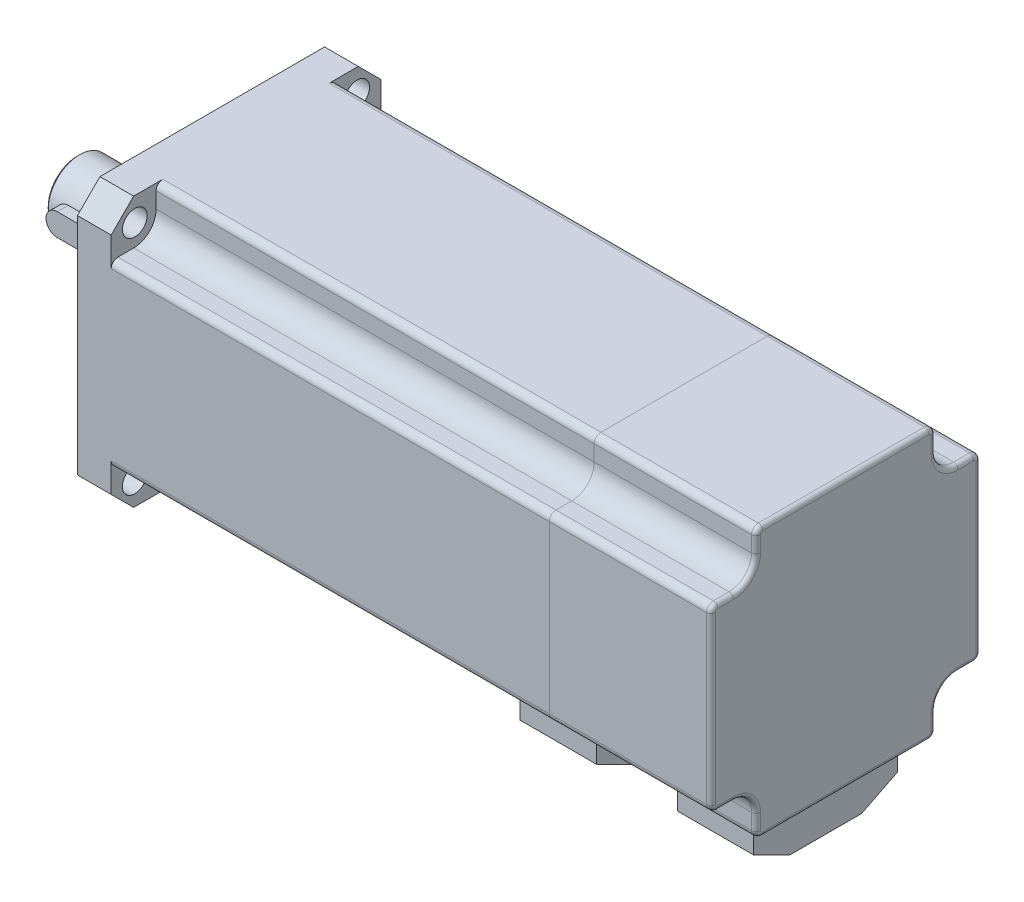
ISO-10303-21;
HEADER;
FILE_DESCRIPTION(('STEP AP214'),'2;1');
FILE_NAME('part.step','',(''),(''),'','','');
FILE_SCHEMA(('AUTOMOTIVE_DESIGN { 1 0 10303 214 1 1 1 1 }'));
ENDSEC;
DATA;
#1=APPLICATION_CONTEXT('core data for automotive mechanical design processes');
#2=APPLICATION_PROTOCOL_DEFINITION('international standard','automotive_design',2000,#1);
#3=PRODUCT_CONTEXT('',#1,'mechanical');
#4=PRODUCT('Part','Part','',(#3));
#5=PRODUCT_RELATED_PRODUCT_CATEGORY('part','',(#4));
#6=PRODUCT_DEFINITION_FORMATION('','',#4);
#7=PRODUCT_DEFINITION_CONTEXT('part definition',#1,'design');
#8=PRODUCT_DEFINITION('design','',#6,#7);
#9=PRODUCT_DEFINITION_SHAPE('','',#8);
#10=(LENGTH_UNIT() NAMED_UNIT(*) SI_UNIT(.MILLI.,.METRE.));
#11=(NAMED_UNIT(*) PLANE_ANGLE_UNIT() SI_UNIT($,.RADIAN.));
#12=(NAMED_UNIT(*) SI_UNIT($,.STERADIAN.) SOLID_ANGLE_UNIT());
#13=UNCERTAINTY_MEASURE_WITH_UNIT(LENGTH_MEASURE(1.E-05),#10,'distance_accuracy_value','');
#14=(GEOMETRIC_REPRESENTATION_CONTEXT(3) GLOBAL_UNCERTAINTY_ASSIGNED_CONTEXT((#13)) GLOBAL_UNIT_ASSIGNED_CONTEXT((#10,
#11,#12)) REPRESENTATION_CONTEXT('',''));
#15=CARTESIAN_POINT('',(0.,0.,0.));
#16=DIRECTION('',(0.,0.,1.));
#17=DIRECTION('',(1.,0.,0.));
#18=AXIS2_PLACEMENT_3D('',#15,#16,#17);
#19=CARTESIAN_POINT('',(101.5,-41.,-16.));
#20=DIRECTION('',(-1.,0.,0.));
#21=DIRECTION('',(0.,0.,1.));
#22=AXIS2_PLACEMENT_3D('',#19,#20,#21);
#23=PLANE('',#22);
#24=DIRECTION('',(0.,0.,1.));
#25=VECTOR('',#24,1.);
#26=CARTESIAN_POINT('',(101.5,-41.,-16.));
#27=LINE('',#26,#25);
#28=CARTESIAN_POINT('',(101.5,-41.,-7.99999999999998));
#29=VERTEX_POINT('',#28);
#30=CARTESIAN_POINT('',(101.5,-41.,7.99999999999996));
#31=VERTEX_POINT('',#30);
#32=EDGE_CURVE('E114',#29,#31,#27,.T.);
#33=ORIENTED_EDGE('',*,*,#32,.F.);
#34=DIRECTION('',(0.,0.447213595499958,-0.894427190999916));
#35=VECTOR('',#34,1.);
#36=CARTESIAN_POINT('',(101.5,-37.8,-14.4));
#37=LINE('',#36,#35);
#38=CARTESIAN_POINT('',(101.5,-37.,-16.));
#39=VERTEX_POINT('',#38);
#40=EDGE_CURVE('E68',#29,#39,#37,.T.);
#41=ORIENTED_EDGE('',*,*,#40,.T.);
#42=DIRECTION('',(0.,1.,0.));
#43=VECTOR('',#42,1.);
#44=CARTESIAN_POINT('',(101.5,-41.,-16.));
#45=LINE('',#44,#43);
#46=CARTESIAN_POINT('',(101.5,-30.,-16.));
#47=VERTEX_POINT('',#46);
#48=EDGE_CURVE('E113',#39,#47,#45,.T.);
#49=ORIENTED_EDGE('',*,*,#48,.T.);
#50=DIRECTION('',(0.,0.,1.));
#51=VECTOR('',#50,1.);
#52=CARTESIAN_POINT('',(101.5,-30.,-16.));
#53=LINE('',#52,#51);
#54=CARTESIAN_POINT('',(101.5,-30.,16.));
#55=VERTEX_POINT('',#54);
#56=EDGE_CURVE('E121',#47,#55,#53,.T.);
#57=ORIENTED_EDGE('',*,*,#56,.T.);
#58=DIRECTION('',(0.,1.,0.));
#59=VECTOR('',#58,1.);
#60=CARTESIAN_POINT('',(101.5,-41.,16.));
#61=LINE('',#60,#59);
#62=CARTESIAN_POINT('',(101.5,-37.,16.));
#63=VERTEX_POINT('',#62);
#64=EDGE_CURVE('E134',#63,#55,#61,.T.);
#65=ORIENTED_EDGE('',*,*,#64,.F.);
#66=DIRECTION('',(0.,-0.447213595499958,-0.894427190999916));
#67=VECTOR('',#66,1.);
#68=CARTESIAN_POINT('',(101.5,-50.6,-11.2));
#69=LINE('',#68,#67);
#70=EDGE_CURVE('E155',#63,#31,#69,.T.);
#71=ORIENTED_EDGE('',*,*,#70,.T.);
#72=EDGE_LOOP('',(#33,#41,#49,#57,#65,#71));
#73=FACE_BOUND('',#72,.T.);
#74=ADVANCED_FACE('F46',(#73),#23,.F.);
#75=CARTESIAN_POINT('',(84.5,-41.,16.));
#76=DIRECTION('',(0.,0.,-1.));
#77=DIRECTION('',(-1.,0.,0.));
#78=AXIS2_PLACEMENT_3D('',#75,#76,#77);
#79=PLANE('',#78);
#80=DIRECTION('',(0.,1.,0.));
#81=VECTOR('',#80,1.);
#82=CARTESIAN_POINT('',(84.5,-41.,16.));
#83=LINE('',#82,#81);
#84=CARTESIAN_POINT('',(84.5,-37.,16.));
#85=VERTEX_POINT('',#84);
#86=CARTESIAN_POINT('',(84.5,-30.,16.));
#87=VERTEX_POINT('',#86);
#88=EDGE_CURVE('E132',#85,#87,#83,.T.);
#89=ORIENTED_EDGE('',*,*,#88,.F.);
#90=DIRECTION('',(-1.,0.,0.));
#91=VECTOR('',#90,1.);
#92=CARTESIAN_POINT('',(136.5,-37.,16.));
#93=LINE('',#92,#91);
#94=EDGE_CURVE('E110',#63,#85,#93,.T.);
#95=ORIENTED_EDGE('',*,*,#94,.F.);
#96=ORIENTED_EDGE('',*,*,#64,.T.);
#97=DIRECTION('',(-1.,0.,0.));
#98=VECTOR('',#97,1.);
#99=CARTESIAN_POINT('',(84.5,-30.,16.));
#100=LINE('',#99,#98);
#101=EDGE_CURVE('E124',#55,#87,#100,.T.);
#102=ORIENTED_EDGE('',*,*,#101,.T.);
#103=EDGE_LOOP('',(#89,#95,#96,#102));
#104=FACE_BOUND('',#103,.T.);
#105=ADVANCED_FACE('F140',(#104),#79,.F.);
#106=CARTESIAN_POINT('',(84.5,-41.,-16.));
#107=DIRECTION('',(1.,0.,0.));
#108=DIRECTION('',(0.,0.,-1.));
#109=AXIS2_PLACEMENT_3D('',#106,#107,#108);
#110=PLANE('',#109);
#111=DIRECTION('',(0.,1.,0.));
#112=VECTOR('',#111,1.);
#113=CARTESIAN_POINT('',(84.5,-41.,-16.));
#114=LINE('',#113,#112);
#115=CARTESIAN_POINT('',(84.5,-37.,-16.));
#116=VERTEX_POINT('',#115);
#117=CARTESIAN_POINT('',(84.5,-30.,-16.));
#118=VERTEX_POINT('',#117);
#119=EDGE_CURVE('E108',#116,#118,#114,.T.);
#120=ORIENTED_EDGE('',*,*,#119,.F.);
#121=DIRECTION('',(0.,0.447213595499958,-0.894427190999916));
#122=VECTOR('',#121,1.);
#123=CARTESIAN_POINT('',(84.5,-37.,-16.));
#124=LINE('',#123,#122);
#125=CARTESIAN_POINT('',(84.5,-41.,-7.99999999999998));
#126=VERTEX_POINT('',#125);
#127=EDGE_CURVE('E96',#126,#116,#124,.T.);
#128=ORIENTED_EDGE('',*,*,#127,.F.);
#129=DIRECTION('',(0.,0.,-1.));
#130=VECTOR('',#129,1.);
#131=CARTESIAN_POINT('',(84.5,-41.,-16.));
#132=LINE('',#131,#130);
#133=CARTESIAN_POINT('',(84.5,-41.,7.99999999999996));
#134=VERTEX_POINT('',#133);
#135=EDGE_CURVE('E106',#134,#126,#132,.T.);
#136=ORIENTED_EDGE('',*,*,#135,.F.);
#137=DIRECTION('',(0.,-0.447213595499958,-0.894427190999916));
#138=VECTOR('',#137,1.);
#139=CARTESIAN_POINT('',(84.5,-41.,7.99999999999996));
#140=LINE('',#139,#138);
#141=EDGE_CURVE('E60',#85,#134,#140,.T.);
#142=ORIENTED_EDGE('',*,*,#141,.F.);
#143=ORIENTED_EDGE('',*,*,#88,.T.);
#144=DIRECTION('',(0.,0.,-1.));
#145=VECTOR('',#144,1.);
#146=CARTESIAN_POINT('',(84.5,-30.,-16.));
#147=LINE('',#146,#145);
#148=EDGE_CURVE('E127',#87,#118,#147,.T.);
#149=ORIENTED_EDGE('',*,*,#148,.T.);
#150=EDGE_LOOP('',(#120,#128,#136,#142,#143,#149));
#151=FACE_BOUND('',#150,.T.);
#152=ADVANCED_FACE('F105',(#151),#110,.F.);
#153=CARTESIAN_POINT('',(84.5,-41.,-16.));
#154=DIRECTION('',(0.,0.,1.));
#155=DIRECTION('',(1.,0.,0.));
#156=AXIS2_PLACEMENT_3D('',#153,#154,#155);
#157=PLANE('',#156);
#158=ORIENTED_EDGE('',*,*,#48,.F.);
#159=DIRECTION('',(-1.,0.,0.));
#160=VECTOR('',#159,1.);
#161=CARTESIAN_POINT('',(136.5,-37.,-16.));
#162=LINE('',#161,#160);
#163=EDGE_CURVE('E109',#39,#116,#162,.T.);
#164=ORIENTED_EDGE('',*,*,#163,.T.);
#165=ORIENTED_EDGE('',*,*,#119,.T.);
#166=DIRECTION('',(1.,0.,0.));
#167=VECTOR('',#166,1.);
#168=CARTESIAN_POINT('',(84.5,-30.,-16.));
#169=LINE('',#168,#167);
#170=EDGE_CURVE('E117',#118,#47,#169,.T.);
#171=ORIENTED_EDGE('',*,*,#170,.T.);
#172=EDGE_LOOP('',(#158,#164,#165,#171));
#173=FACE_BOUND('',#172,.T.);
#174=ADVANCED_FACE('F150',(#173),#157,.F.);
#175=CARTESIAN_POINT('',(0.,-41.,0.));
#176=DIRECTION('',(0.,1.,0.));
#177=DIRECTION('',(0.,0.,1.));
#178=AXIS2_PLACEMENT_3D('',#175,#176,#177);
#179=PLANE('',#178);
#180=ORIENTED_EDGE('',*,*,#135,.T.);
#181=DIRECTION('',(1.,0.,0.));
#182=VECTOR('',#181,1.);
#183=CARTESIAN_POINT('',(0.,-41.,-7.99999999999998));
#184=LINE('',#183,#182);
#185=EDGE_CURVE('E12',#126,#29,#184,.T.);
#186=ORIENTED_EDGE('',*,*,#185,.T.);
#187=ORIENTED_EDGE('',*,*,#32,.T.);
#188=DIRECTION('',(-1.,0.,0.));
#189=VECTOR('',#188,1.);
#190=CARTESIAN_POINT('',(0.,-41.,7.99999999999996));
#191=LINE('',#190,#189);
#192=EDGE_CURVE('E53',#31,#134,#191,.T.);
#193=ORIENTED_EDGE('',*,*,#192,.T.);
#194=EDGE_LOOP('',(#180,#186,#187,#193));
#195=FACE_BOUND('',#194,.T.);
#196=ADVANCED_FACE('F112',(#195),#179,.F.);
#197=CARTESIAN_POINT('',(0.,-30.,0.));
#198=DIRECTION('',(0.,1.,0.));
#199=DIRECTION('',(0.,0.,1.));
#200=AXIS2_PLACEMENT_3D('',#197,#198,#199);
#201=PLANE('',#200);
#202=ORIENTED_EDGE('',*,*,#56,.F.);
#203=ORIENTED_EDGE('',*,*,#170,.F.);
#204=ORIENTED_EDGE('',*,*,#148,.F.);
#205=ORIENTED_EDGE('',*,*,#101,.F.);
#206=EDGE_LOOP('',(#202,#203,#204,#205));
#207=FACE_BOUND('',#206,.T.);
#208=ADVANCED_FACE('F146',(#207),#201,.T.);
#209=CARTESIAN_POINT('',(136.5,-41.,7.99999999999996));
#210=DIRECTION('',(0.,0.894427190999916,-0.447213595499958));
#211=DIRECTION('',(0.,0.447213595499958,0.894427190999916));
#212=AXIS2_PLACEMENT_3D('',#209,#210,#211);
#213=PLANE('',#212);
#214=ORIENTED_EDGE('',*,*,#94,.T.);
#215=ORIENTED_EDGE('',*,*,#141,.T.);
#216=ORIENTED_EDGE('',*,*,#192,.F.);
#217=ORIENTED_EDGE('',*,*,#70,.F.);
#218=EDGE_LOOP('',(#214,#215,#216,#217));
#219=FACE_BOUND('',#218,.T.);
#220=ADVANCED_FACE('F156',(#219),#213,.F.);
#221=CARTESIAN_POINT('',(136.5,-37.,-16.));
#222=DIRECTION('',(0.,0.894427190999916,0.447213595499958));
#223=DIRECTION('',(0.,-0.447213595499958,0.894427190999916));
#224=AXIS2_PLACEMENT_3D('',#221,#222,#223);
#225=PLANE('',#224);
#226=ORIENTED_EDGE('',*,*,#185,.F.);
#227=ORIENTED_EDGE('',*,*,#127,.T.);
#228=ORIENTED_EDGE('',*,*,#163,.F.);
#229=ORIENTED_EDGE('',*,*,#40,.F.);
#230=EDGE_LOOP('',(#226,#227,#228,#229));
#231=FACE_BOUND('',#230,.T.);
#232=ADVANCED_FACE('F95',(#231),#225,.F.);
#233=CLOSED_SHELL('',(#74,#105,#152,#174,#196,#208,#220,#232));
#234=MANIFOLD_SOLID_BREP('B2',#233);
#235=CARTESIAN_POINT('',(136.5,-41.,-16.));
#236=DIRECTION('',(-1.,0.,0.));
#237=DIRECTION('',(0.,0.,1.));
#238=AXIS2_PLACEMENT_3D('',#235,#236,#237);
#239=PLANE('',#238);
#240=DIRECTION('',(0.,0.,1.));
#241=VECTOR('',#240,1.);
#242=CARTESIAN_POINT('',(136.5,-41.,-16.));
#243=LINE('',#242,#241);
#244=CARTESIAN_POINT('',(136.5,-41.,-7.99999999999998));
#245=VERTEX_POINT('',#244);
#246=CARTESIAN_POINT('',(136.5,-41.,7.99999999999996));
#247=VERTEX_POINT('',#246);
#248=EDGE_CURVE('E297',#245,#247,#243,.T.);
#249=ORIENTED_EDGE('',*,*,#248,.F.);
#250=DIRECTION('',(0.,0.447213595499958,-0.894427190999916));
#251=VECTOR('',#250,1.);
#252=CARTESIAN_POINT('',(136.5,-37.,-16.));
#253=LINE('',#252,#251);
#254=CARTESIAN_POINT('',(136.5,-37.,-16.));
#255=VERTEX_POINT('',#254);
#256=EDGE_CURVE('E254',#245,#255,#253,.T.);
#257=ORIENTED_EDGE('',*,*,#256,.T.);
#258=DIRECTION('',(0.,1.,0.));
#259=VECTOR('',#258,1.);
#260=CARTESIAN_POINT('',(136.5,-41.,-16.));
#261=LINE('',#260,#259);
#262=CARTESIAN_POINT('',(136.5,-30.,-16.));
#263=VERTEX_POINT('',#262);
#264=EDGE_CURVE('E293',#255,#263,#261,.T.);
#265=ORIENTED_EDGE('',*,*,#264,.T.);
#266=DIRECTION('',(0.,0.,1.));
#267=VECTOR('',#266,1.);
#268=CARTESIAN_POINT('',(136.5,-30.,-16.));
#269=LINE('',#268,#267);
#270=CARTESIAN_POINT('',(136.5,-30.,16.));
#271=VERTEX_POINT('',#270);
#272=EDGE_CURVE('E327',#263,#271,#269,.T.);
#273=ORIENTED_EDGE('',*,*,#272,.T.);
#274=DIRECTION('',(0.,1.,0.));
#275=VECTOR('',#274,1.);
#276=CARTESIAN_POINT('',(136.5,-41.,16.));
#277=LINE('',#276,#275);
#278=CARTESIAN_POINT('',(136.5,-37.,16.));
#279=VERTEX_POINT('',#278);
#280=EDGE_CURVE('E44',#279,#271,#277,.T.);
#281=ORIENTED_EDGE('',*,*,#280,.F.);
#282=DIRECTION('',(0.,-0.447213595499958,-0.894427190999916));
#283=VECTOR('',#282,1.);
#284=CARTESIAN_POINT('',(136.5,-41.,7.99999999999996));
#285=LINE('',#284,#283);
#286=EDGE_CURVE('E337',#279,#247,#285,.T.);
#287=ORIENTED_EDGE('',*,*,#286,.T.);
#288=EDGE_LOOP('',(#249,#257,#265,#273,#281,#287));
#289=FACE_BOUND('',#288,.T.);
#290=ADVANCED_FACE('F232',(#289),#239,.F.);
#291=CARTESIAN_POINT('',(119.5,-41.,16.));
#292=DIRECTION('',(0.,0.,-1.));
#293=DIRECTION('',(-1.,0.,0.));
#294=AXIS2_PLACEMENT_3D('',#291,#292,#293);
#295=PLANE('',#294);
#296=DIRECTION('',(0.,1.,0.));
#297=VECTOR('',#296,1.);
#298=CARTESIAN_POINT('',(119.5,-41.,16.));
#299=LINE('',#298,#297);
#300=CARTESIAN_POINT('',(119.5,-37.,16.));
#301=VERTEX_POINT('',#300);
#302=CARTESIAN_POINT('',(119.5,-30.,16.));
#303=VERTEX_POINT('',#302);
#304=EDGE_CURVE('E239',#301,#303,#299,.T.);
#305=ORIENTED_EDGE('',*,*,#304,.F.);
#306=DIRECTION('',(-1.,0.,0.));
#307=VECTOR('',#306,1.);
#308=CARTESIAN_POINT('',(136.5,-37.,16.));
#309=LINE('',#308,#307);
#310=EDGE_CURVE('E335',#279,#301,#309,.T.);
#311=ORIENTED_EDGE('',*,*,#310,.F.);
#312=ORIENTED_EDGE('',*,*,#280,.T.);
#313=DIRECTION('',(-1.,0.,0.));
#314=VECTOR('',#313,1.);
#315=CARTESIAN_POINT('',(119.5,-30.,16.));
#316=LINE('',#315,#314);
#317=EDGE_CURVE('E323',#271,#303,#316,.T.);
#318=ORIENTED_EDGE('',*,*,#317,.T.);
#319=EDGE_LOOP('',(#305,#311,#312,#318));
#320=FACE_BOUND('',#319,.T.);
#321=ADVANCED_FACE('F324',(#320),#295,.F.);
#322=CARTESIAN_POINT('',(119.5,-41.,-16.));
#323=DIRECTION('',(1.,0.,0.));
#324=DIRECTION('',(0.,0.,-1.));
#325=AXIS2_PLACEMENT_3D('',#322,#323,#324);
#326=PLANE('',#325);
#327=DIRECTION('',(0.,1.,0.));
#328=VECTOR('',#327,1.);
#329=CARTESIAN_POINT('',(119.5,-41.,-16.));
#330=LINE('',#329,#328);
#331=CARTESIAN_POINT('',(119.5,-37.,-16.));
#332=VERTEX_POINT('',#331);
#333=CARTESIAN_POINT('',(119.5,-30.,-16.));
#334=VERTEX_POINT('',#333);
#335=EDGE_CURVE('E304',#332,#334,#330,.T.);
#336=ORIENTED_EDGE('',*,*,#335,.F.);
#337=DIRECTION('',(0.,-0.447213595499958,0.894427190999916));
#338=VECTOR('',#337,1.);
#339=CARTESIAN_POINT('',(119.5,-37.8,-14.4));
#340=LINE('',#339,#338);
#341=CARTESIAN_POINT('',(119.5,-41.,-7.99999999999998));
#342=VERTEX_POINT('',#341);
#343=EDGE_CURVE('E284',#332,#342,#340,.T.);
#344=ORIENTED_EDGE('',*,*,#343,.T.);
#345=DIRECTION('',(0.,0.,-1.));
#346=VECTOR('',#345,1.);
#347=CARTESIAN_POINT('',(119.5,-41.,-16.));
#348=LINE('',#347,#346);
#349=CARTESIAN_POINT('',(119.5,-41.,7.99999999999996));
#350=VERTEX_POINT('',#349);
#351=EDGE_CURVE('E305',#350,#342,#348,.T.);
#352=ORIENTED_EDGE('',*,*,#351,.F.);
#353=DIRECTION('',(0.,0.447213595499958,0.894427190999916));
#354=VECTOR('',#353,1.);
#355=CARTESIAN_POINT('',(119.5,-50.6,-11.2));
#356=LINE('',#355,#354);
#357=EDGE_CURVE('E246',#350,#301,#356,.T.);
#358=ORIENTED_EDGE('',*,*,#357,.T.);
#359=ORIENTED_EDGE('',*,*,#304,.T.);
#360=DIRECTION('',(0.,0.,-1.));
#361=VECTOR('',#360,1.);
#362=CARTESIAN_POINT('',(119.5,-30.,-16.));
#363=LINE('',#362,#361);
#364=EDGE_CURVE('E318',#303,#334,#363,.T.);
#365=ORIENTED_EDGE('',*,*,#364,.T.);
#366=EDGE_LOOP('',(#336,#344,#352,#358,#359,#365));
#367=FACE_BOUND('',#366,.T.);
#368=ADVANCED_FACE('F316',(#367),#326,.F.);
#369=CARTESIAN_POINT('',(119.5,-41.,-16.));
#370=DIRECTION('',(0.,0.,1.));
#371=DIRECTION('',(1.,0.,0.));
#372=AXIS2_PLACEMENT_3D('',#369,#370,#371);
#373=PLANE('',#372);
#374=ORIENTED_EDGE('',*,*,#264,.F.);
#375=DIRECTION('',(-1.,0.,0.));
#376=VECTOR('',#375,1.);
#377=CARTESIAN_POINT('',(136.5,-37.,-16.));
#378=LINE('',#377,#376);
#379=EDGE_CURVE('E281',#255,#332,#378,.T.);
#380=ORIENTED_EDGE('',*,*,#379,.T.);
#381=ORIENTED_EDGE('',*,*,#335,.T.);
#382=DIRECTION('',(1.,0.,0.));
#383=VECTOR('',#382,1.);
#384=CARTESIAN_POINT('',(119.5,-30.,-16.));
#385=LINE('',#384,#383);
#386=EDGE_CURVE('E302',#334,#263,#385,.T.);
#387=ORIENTED_EDGE('',*,*,#386,.T.);
#388=EDGE_LOOP('',(#374,#380,#381,#387));
#389=FACE_BOUND('',#388,.T.);
#390=ADVANCED_FACE('F300',(#389),#373,.F.);
#391=CARTESIAN_POINT('',(0.,-41.,0.));
#392=DIRECTION('',(0.,1.,0.));
#393=DIRECTION('',(0.,0.,1.));
#394=AXIS2_PLACEMENT_3D('',#391,#392,#393);
#395=PLANE('',#394);
#396=ORIENTED_EDGE('',*,*,#351,.T.);
#397=DIRECTION('',(-1.,0.,0.));
#398=VECTOR('',#397,1.);
#399=CARTESIAN_POINT('',(136.5,-41.,-7.99999999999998));
#400=LINE('',#399,#398);
#401=EDGE_CURVE('E288',#245,#342,#400,.T.);
#402=ORIENTED_EDGE('',*,*,#401,.F.);
#403=ORIENTED_EDGE('',*,*,#248,.T.);
#404=DIRECTION('',(-1.,0.,0.));
#405=VECTOR('',#404,1.);
#406=CARTESIAN_POINT('',(136.5,-41.,7.99999999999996));
#407=LINE('',#406,#405);
#408=EDGE_CURVE('E298',#247,#350,#407,.T.);
#409=ORIENTED_EDGE('',*,*,#408,.T.);
#410=EDGE_LOOP('',(#396,#402,#403,#409));
#411=FACE_BOUND('',#410,.T.);
#412=ADVANCED_FACE('F341',(#411),#395,.F.);
#413=CARTESIAN_POINT('',(0.,-30.,0.));
#414=DIRECTION('',(0.,1.,0.));
#415=DIRECTION('',(0.,0.,1.));
#416=AXIS2_PLACEMENT_3D('',#413,#414,#415);
#417=PLANE('',#416);
#418=ORIENTED_EDGE('',*,*,#272,.F.);
#419=ORIENTED_EDGE('',*,*,#386,.F.);
#420=ORIENTED_EDGE('',*,*,#364,.F.);
#421=ORIENTED_EDGE('',*,*,#317,.F.);
#422=EDGE_LOOP('',(#418,#419,#420,#421));
#423=FACE_BOUND('',#422,.T.);
#424=ADVANCED_FACE('F329',(#423),#417,.T.);
#425=CARTESIAN_POINT('',(136.5,-41.,7.99999999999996));
#426=DIRECTION('',(0.,0.894427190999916,-0.447213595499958));
#427=DIRECTION('',(0.,0.447213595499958,0.894427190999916));
#428=AXIS2_PLACEMENT_3D('',#425,#426,#427);
#429=PLANE('',#428);
#430=ORIENTED_EDGE('',*,*,#408,.F.);
#431=ORIENTED_EDGE('',*,*,#286,.F.);
#432=ORIENTED_EDGE('',*,*,#310,.T.);
#433=ORIENTED_EDGE('',*,*,#357,.F.);
#434=EDGE_LOOP('',(#430,#431,#432,#433));
#435=FACE_BOUND('',#434,.T.);
#436=ADVANCED_FACE('F342',(#435),#429,.F.);
#437=CARTESIAN_POINT('',(136.5,-37.,-16.));
#438=DIRECTION('',(0.,0.894427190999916,0.447213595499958));
#439=DIRECTION('',(0.,-0.447213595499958,0.894427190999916));
#440=AXIS2_PLACEMENT_3D('',#437,#438,#439);
#441=PLANE('',#440);
#442=ORIENTED_EDGE('',*,*,#379,.F.);
#443=ORIENTED_EDGE('',*,*,#256,.F.);
#444=ORIENTED_EDGE('',*,*,#401,.T.);
#445=ORIENTED_EDGE('',*,*,#343,.F.);
#446=EDGE_LOOP('',(#442,#443,#444,#445));
#447=FACE_BOUND('',#446,.T.);
#448=ADVANCED_FACE('F282',(#447),#441,.F.);
#449=CLOSED_SHELL('',(#290,#321,#368,#390,#412,#424,#436,#448));
#450=MANIFOLD_SOLID_BREP('B6',#449);
#451=CARTESIAN_POINT('',(-25.5,0.,9.));
#452=DIRECTION('',(0.,0.,-1.));
#453=DIRECTION('',(-1.,0.,0.));
#454=AXIS2_PLACEMENT_3D('',#451,#452,#453);
#455=CYLINDRICAL_SURFACE('',#454,2.5);
#456=CARTESIAN_POINT('',(-25.5,0.,4.));
#457=DIRECTION('',(0.,0.,1.));
#458=DIRECTION('',(1.,0.,0.));
#459=AXIS2_PLACEMENT_3D('',#456,#457,#458);
#460=CIRCLE('',#459,2.5);
#461=CARTESIAN_POINT('',(-25.5,2.5,4.));
#462=VERTEX_POINT('',#461);
#463=CARTESIAN_POINT('',(-25.5,-2.5,4.));
#464=VERTEX_POINT('',#463);
#465=EDGE_CURVE('E481',#462,#464,#460,.T.);
#466=ORIENTED_EDGE('',*,*,#465,.T.);
#467=DIRECTION('',(0.,0.,-1.));
#468=VECTOR('',#467,1.);
#469=CARTESIAN_POINT('',(-25.5,-2.5,9.));
#470=LINE('',#469,#468);
#471=CARTESIAN_POINT('',(-25.5,-2.5,9.));
#472=VERTEX_POINT('',#471);
#473=EDGE_CURVE('E230',#472,#464,#470,.T.);
#474=ORIENTED_EDGE('',*,*,#473,.F.);
#475=CARTESIAN_POINT('',(-25.5,0.,9.));
#476=DIRECTION('',(0.,0.,1.));
#477=DIRECTION('',(1.,0.,0.));
#478=AXIS2_PLACEMENT_3D('',#475,#476,#477);
#479=CIRCLE('',#478,2.5);
#480=CARTESIAN_POINT('',(-25.5,2.5,9.));
#481=VERTEX_POINT('',#480);
#482=EDGE_CURVE('E469',#481,#472,#479,.T.);
#483=ORIENTED_EDGE('',*,*,#482,.F.);
#484=DIRECTION('',(0.,0.,-1.));
#485=VECTOR('',#484,1.);
#486=CARTESIAN_POINT('',(-25.5,2.5,9.));
#487=LINE('',#486,#485);
#488=EDGE_CURVE('E477',#481,#462,#487,.T.);
#489=ORIENTED_EDGE('',*,*,#488,.T.);
#490=EDGE_LOOP('',(#466,#474,#483,#489));
#491=FACE_BOUND('',#490,.T.);
#492=ADVANCED_FACE('F418',(#491),#455,.T.);
#493=CARTESIAN_POINT('',(-10.,-2.5,9.));
#494=DIRECTION('',(0.,1.,0.));
#495=DIRECTION('',(-1.,0.,0.));
#496=AXIS2_PLACEMENT_3D('',#493,#494,#495);
#497=PLANE('',#496);
#498=DIRECTION('',(1.,0.,0.));
#499=VECTOR('',#498,1.);
#500=CARTESIAN_POINT('',(-10.,-2.5,4.));
#501=LINE('',#500,#499);
#502=CARTESIAN_POINT('',(-10.,-2.5,4.));
#503=VERTEX_POINT('',#502);
#504=EDGE_CURVE('E473',#464,#503,#501,.T.);
#505=ORIENTED_EDGE('',*,*,#504,.T.);
#506=DIRECTION('',(0.,0.,-1.));
#507=VECTOR('',#506,1.);
#508=CARTESIAN_POINT('',(-10.,-2.5,9.));
#509=LINE('',#508,#507);
#510=CARTESIAN_POINT('',(-10.,-2.5,9.));
#511=VERTEX_POINT('',#510);
#512=EDGE_CURVE('E426',#511,#503,#509,.T.);
#513=ORIENTED_EDGE('',*,*,#512,.F.);
#514=DIRECTION('',(1.,0.,0.));
#515=VECTOR('',#514,1.);
#516=CARTESIAN_POINT('',(-10.,-2.5,9.));
#517=LINE('',#516,#515);
#518=EDGE_CURVE('E464',#472,#511,#517,.T.);
#519=ORIENTED_EDGE('',*,*,#518,.F.);
#520=ORIENTED_EDGE('',*,*,#473,.T.);
#521=EDGE_LOOP('',(#505,#513,#519,#520));
#522=FACE_BOUND('',#521,.T.);
#523=ADVANCED_FACE('F472',(#522),#497,.F.);
#524=CARTESIAN_POINT('',(-10.,0.,9.));
#525=DIRECTION('',(0.,0.,-1.));
#526=DIRECTION('',(-1.,0.,0.));
#527=AXIS2_PLACEMENT_3D('',#524,#525,#526);
#528=CYLINDRICAL_SURFACE('',#527,2.5);
#529=CARTESIAN_POINT('',(-10.,0.,4.));
#530=DIRECTION('',(0.,0.,1.));
#531=DIRECTION('',(1.,0.,0.));
#532=AXIS2_PLACEMENT_3D('',#529,#530,#531);
#533=CIRCLE('',#532,2.5);
#534=CARTESIAN_POINT('',(-10.,2.5,4.));
#535=VERTEX_POINT('',#534);
#536=EDGE_CURVE('E451',#503,#535,#533,.T.);
#537=ORIENTED_EDGE('',*,*,#536,.T.);
#538=DIRECTION('',(0.,0.,-1.));
#539=VECTOR('',#538,1.);
#540=CARTESIAN_POINT('',(-10.,2.5,9.));
#541=LINE('',#540,#539);
#542=CARTESIAN_POINT('',(-10.,2.5,9.));
#543=VERTEX_POINT('',#542);
#544=EDGE_CURVE('E474',#543,#535,#541,.T.);
#545=ORIENTED_EDGE('',*,*,#544,.F.);
#546=CARTESIAN_POINT('',(-10.,0.,9.));
#547=DIRECTION('',(0.,0.,1.));
#548=DIRECTION('',(1.,0.,0.));
#549=AXIS2_PLACEMENT_3D('',#546,#547,#548);
#550=CIRCLE('',#549,2.5);
#551=EDGE_CURVE('E467',#511,#543,#550,.T.);
#552=ORIENTED_EDGE('',*,*,#551,.F.);
#553=ORIENTED_EDGE('',*,*,#512,.T.);
#554=EDGE_LOOP('',(#537,#545,#552,#553));
#555=FACE_BOUND('',#554,.T.);
#556=ADVANCED_FACE('F475',(#555),#528,.T.);
#557=CARTESIAN_POINT('',(-25.5,2.5,9.));
#558=DIRECTION('',(0.,-1.,0.));
#559=DIRECTION('',(1.,0.,0.));
#560=AXIS2_PLACEMENT_3D('',#557,#558,#559);
#561=PLANE('',#560);
#562=DIRECTION('',(-1.,0.,0.));
#563=VECTOR('',#562,1.);
#564=CARTESIAN_POINT('',(-25.5,2.5,4.));
#565=LINE('',#564,#563);
#566=EDGE_CURVE('E457',#535,#462,#565,.T.);
#567=ORIENTED_EDGE('',*,*,#566,.T.);
#568=ORIENTED_EDGE('',*,*,#488,.F.);
#569=DIRECTION('',(-1.,0.,0.));
#570=VECTOR('',#569,1.);
#571=CARTESIAN_POINT('',(-25.5,2.5,9.));
#572=LINE('',#571,#570);
#573=EDGE_CURVE('E434',#543,#481,#572,.T.);
#574=ORIENTED_EDGE('',*,*,#573,.F.);
#575=ORIENTED_EDGE('',*,*,#544,.T.);
#576=EDGE_LOOP('',(#567,#568,#574,#575));
#577=FACE_BOUND('',#576,.T.);
#578=ADVANCED_FACE('F488',(#577),#561,.F.);
#579=CARTESIAN_POINT('',(-25.5,0.,9.));
#580=DIRECTION('',(0.,0.,1.));
#581=DIRECTION('',(1.,0.,0.));
#582=AXIS2_PLACEMENT_3D('',#579,#580,#581);
#583=PLANE('',#582);
#584=ORIENTED_EDGE('',*,*,#482,.T.);
#585=ORIENTED_EDGE('',*,*,#518,.T.);
#586=ORIENTED_EDGE('',*,*,#551,.T.);
#587=ORIENTED_EDGE('',*,*,#573,.T.);
#588=EDGE_LOOP('',(#584,#585,#586,#587));
#589=FACE_BOUND('',#588,.T.);
#590=ADVANCED_FACE('F465',(#589),#583,.T.);
#591=CARTESIAN_POINT('',(-25.5,0.,4.));
#592=DIRECTION('',(0.,0.,1.));
#593=DIRECTION('',(1.,0.,0.));
#594=AXIS2_PLACEMENT_3D('',#591,#592,#593);
#595=PLANE('',#594);
#596=ORIENTED_EDGE('',*,*,#465,.F.);
#597=ORIENTED_EDGE('',*,*,#566,.F.);
#598=ORIENTED_EDGE('',*,*,#536,.F.);
#599=ORIENTED_EDGE('',*,*,#504,.F.);
#600=EDGE_LOOP('',(#596,#597,#598,#599));
#601=FACE_BOUND('',#600,.T.);
#602=ADVANCED_FACE('F491',(#601),#595,.F.);
#603=CLOSED_SHELL('',(#492,#523,#556,#578,#590,#602));
#604=MANIFOLD_SOLID_BREP('B38',#603);
#605=CARTESIAN_POINT('',(141.,-25.,30.));
#606=DIRECTION('',(0.,0.,-1.));
#607=DIRECTION('',(-1.,0.,0.));
#608=AXIS2_PLACEMENT_3D('',#605,#606,#607);
#609=PLANE('',#608);
#610=DIRECTION('',(1.,0.,0.));
#611=VECTOR('',#610,1.);
#612=CARTESIAN_POINT('',(7.49999999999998,-18.5,30.));
#613=LINE('',#612,#611);
#614=CARTESIAN_POINT('',(105.,-18.5,30.));
#615=VERTEX_POINT('',#614);
#616=CARTESIAN_POINT('',(140.,-18.5,30.));
#617=VERTEX_POINT('',#616);
#618=EDGE_CURVE('E1645',#615,#617,#613,.T.);
#619=ORIENTED_EDGE('',*,*,#618,.T.);
#620=DIRECTION('',(0.,-1.,0.));
#621=VECTOR('',#620,1.);
#622=CARTESIAN_POINT('',(140.,-25.,30.));
#623=LINE('',#622,#621);
#624=CARTESIAN_POINT('',(140.,18.5,30.));
#625=VERTEX_POINT('',#624);
#626=EDGE_CURVE('E416',#617,#625,#623,.F.);
#627=ORIENTED_EDGE('',*,*,#626,.T.);
#628=DIRECTION('',(1.,0.,0.));
#629=VECTOR('',#628,1.);
#630=CARTESIAN_POINT('',(7.49999999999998,18.5,30.));
#631=LINE('',#630,#629);
#632=CARTESIAN_POINT('',(105.,18.5,30.));
#633=VERTEX_POINT('',#632);
#634=EDGE_CURVE('E1095',#633,#625,#631,.T.);
#635=ORIENTED_EDGE('',*,*,#634,.F.);
#636=DIRECTION('',(0.,-1.,0.));
#637=VECTOR('',#636,1.);
#638=CARTESIAN_POINT('',(105.,-25.,30.));
#639=LINE('',#638,#637);
#640=EDGE_CURVE('E1069',#633,#615,#639,.T.);
#641=ORIENTED_EDGE('',*,*,#640,.T.);
#642=EDGE_LOOP('',(#619,#627,#635,#641));
#643=FACE_BOUND('',#642,.T.);
#644=ADVANCED_FACE('F551',(#643),#609,.F.);
#645=CARTESIAN_POINT('',(141.,-30.,25.));
#646=DIRECTION('',(0.,1.,0.));
#647=DIRECTION('',(0.,0.,1.));
#648=AXIS2_PLACEMENT_3D('',#645,#646,#647);
#649=PLANE('',#648);
#650=DIRECTION('',(1.,0.,0.));
#651=VECTOR('',#650,1.);
#652=CARTESIAN_POINT('',(7.49999999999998,-30.,-18.5));
#653=LINE('',#652,#651);
#654=CARTESIAN_POINT('',(105.,-30.,-18.5));
#655=VERTEX_POINT('',#654);
#656=CARTESIAN_POINT('',(140.,-30.,-18.5));
#657=VERTEX_POINT('',#656);
#658=EDGE_CURVE('E1050',#655,#657,#653,.T.);
#659=ORIENTED_EDGE('',*,*,#658,.T.);
#660=DIRECTION('',(0.,0.,-1.));
#661=VECTOR('',#660,1.);
#662=CARTESIAN_POINT('',(140.,-30.,25.));
#663=LINE('',#662,#661);
#664=CARTESIAN_POINT('',(140.,-30.,18.5));
#665=VERTEX_POINT('',#664);
#666=EDGE_CURVE('E935',#657,#665,#663,.F.);
#667=ORIENTED_EDGE('',*,*,#666,.T.);
#668=DIRECTION('',(1.,0.,0.));
#669=VECTOR('',#668,1.);
#670=CARTESIAN_POINT('',(7.49999999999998,-30.,18.5));
#671=LINE('',#670,#669);
#672=CARTESIAN_POINT('',(105.,-30.,18.5));
#673=VERTEX_POINT('',#672);
#674=EDGE_CURVE('E1643',#673,#665,#671,.T.);
#675=ORIENTED_EDGE('',*,*,#674,.F.);
#676=DIRECTION('',(0.,0.,-1.));
#677=VECTOR('',#676,1.);
#678=CARTESIAN_POINT('',(105.,-30.,25.));
#679=LINE('',#678,#677);
#680=EDGE_CURVE('E1072',#673,#655,#679,.T.);
#681=ORIENTED_EDGE('',*,*,#680,.T.);
#682=EDGE_LOOP('',(#659,#667,#675,#681));
#683=FACE_BOUND('',#682,.T.);
#684=ADVANCED_FACE('F1220',(#683),#649,.F.);
#685=CARTESIAN_POINT('',(141.,-25.,-30.));
#686=DIRECTION('',(0.,0.,1.));
#687=DIRECTION('',(1.,0.,0.));
#688=AXIS2_PLACEMENT_3D('',#685,#686,#687);
#689=PLANE('',#688);
#690=DIRECTION('',(1.,0.,0.));
#691=VECTOR('',#690,1.);
#692=CARTESIAN_POINT('',(7.49999999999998,18.5,-30.));
#693=LINE('',#692,#691);
#694=CARTESIAN_POINT('',(105.,18.5,-30.));
#695=VERTEX_POINT('',#694);
#696=CARTESIAN_POINT('',(140.,18.5,-30.));
#697=VERTEX_POINT('',#696);
#698=EDGE_CURVE('E1065',#695,#697,#693,.T.);
#699=ORIENTED_EDGE('',*,*,#698,.T.);
#700=DIRECTION('',(0.,1.,0.));
#701=VECTOR('',#700,1.);
#702=CARTESIAN_POINT('',(140.,-25.,-30.));
#703=LINE('',#702,#701);
#704=CARTESIAN_POINT('',(140.,-18.5,-30.));
#705=VERTEX_POINT('',#704);
#706=EDGE_CURVE('E923',#697,#705,#703,.F.);
#707=ORIENTED_EDGE('',*,*,#706,.T.);
#708=DIRECTION('',(1.,0.,0.));
#709=VECTOR('',#708,1.);
#710=CARTESIAN_POINT('',(7.49999999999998,-18.5,-30.));
#711=LINE('',#710,#709);
#712=CARTESIAN_POINT('',(105.,-18.5,-30.));
#713=VERTEX_POINT('',#712);
#714=EDGE_CURVE('E1052',#713,#705,#711,.T.);
#715=ORIENTED_EDGE('',*,*,#714,.F.);
#716=DIRECTION('',(0.,1.,0.));
#717=VECTOR('',#716,1.);
#718=CARTESIAN_POINT('',(105.,-25.,-30.));
#719=LINE('',#718,#717);
#720=EDGE_CURVE('E1076',#713,#695,#719,.T.);
#721=ORIENTED_EDGE('',*,*,#720,.T.);
#722=EDGE_LOOP('',(#699,#707,#715,#721));
#723=FACE_BOUND('',#722,.T.);
#724=ADVANCED_FACE('F1119',(#723),#689,.F.);
#725=CARTESIAN_POINT('',(141.,30.,25.));
#726=DIRECTION('',(0.,-1.,0.));
#727=DIRECTION('',(0.,0.,-1.));
#728=AXIS2_PLACEMENT_3D('',#725,#726,#727);
#729=PLANE('',#728);
#730=DIRECTION('',(1.,0.,0.));
#731=VECTOR('',#730,1.);
#732=CARTESIAN_POINT('',(7.49999999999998,30.,18.5));
#733=LINE('',#732,#731);
#734=CARTESIAN_POINT('',(105.,30.,18.5));
#735=VERTEX_POINT('',#734);
#736=CARTESIAN_POINT('',(140.,30.,18.5));
#737=VERTEX_POINT('',#736);
#738=EDGE_CURVE('E1085',#735,#737,#733,.T.);
#739=ORIENTED_EDGE('',*,*,#738,.T.);
#740=DIRECTION('',(0.,0.,1.));
#741=VECTOR('',#740,1.);
#742=CARTESIAN_POINT('',(140.,30.,25.));
#743=LINE('',#742,#741);
#744=CARTESIAN_POINT('',(140.,30.,-18.5));
#745=VERTEX_POINT('',#744);
#746=EDGE_CURVE('E912',#737,#745,#743,.F.);
#747=ORIENTED_EDGE('',*,*,#746,.T.);
#748=DIRECTION('',(1.,0.,0.));
#749=VECTOR('',#748,1.);
#750=CARTESIAN_POINT('',(7.49999999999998,30.,-18.5));
#751=LINE('',#750,#749);
#752=CARTESIAN_POINT('',(105.,30.,-18.5));
#753=VERTEX_POINT('',#752);
#754=EDGE_CURVE('E1062',#753,#745,#751,.T.);
#755=ORIENTED_EDGE('',*,*,#754,.F.);
#756=DIRECTION('',(0.,0.,1.));
#757=VECTOR('',#756,1.);
#758=CARTESIAN_POINT('',(105.,30.,25.));
#759=LINE('',#758,#757);
#760=EDGE_CURVE('E798',#753,#735,#759,.T.);
#761=ORIENTED_EDGE('',*,*,#760,.T.);
#762=EDGE_LOOP('',(#739,#747,#755,#761));
#763=FACE_BOUND('',#762,.T.);
#764=ADVANCED_FACE('F1084',(#763),#729,.F.);
#765=CARTESIAN_POINT('',(141.,0.,0.));
#766=DIRECTION('',(-1.,0.,0.));
#767=DIRECTION('',(0.,0.,1.));
#768=AXIS2_PLACEMENT_3D('',#765,#766,#767);
#769=PLANE('',#768);
#770=DIRECTION('',(0.,0.,-1.));
#771=VECTOR('',#770,1.);
#772=CARTESIAN_POINT('',(141.,19.,0.));
#773=LINE('',#772,#771);
#774=CARTESIAN_POINT('',(141.,19.,25.));
#775=VERTEX_POINT('',#774);
#776=CARTESIAN_POINT('',(141.,19.,28.5));
#777=VERTEX_POINT('',#776);
#778=EDGE_CURVE('E899',#775,#777,#773,.F.);
#779=ORIENTED_EDGE('',*,*,#778,.T.);
#780=CARTESIAN_POINT('',(141.,18.5,28.5));
#781=DIRECTION('',(-1.,0.,0.));
#782=DIRECTION('',(0.,0.,1.));
#783=AXIS2_PLACEMENT_3D('',#780,#781,#782);
#784=CIRCLE('',#783,0.500000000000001);
#785=CARTESIAN_POINT('',(141.,18.5,29.));
#786=VERTEX_POINT('',#785);
#787=EDGE_CURVE('E901',#777,#786,#784,.F.);
#788=ORIENTED_EDGE('',*,*,#787,.T.);
#789=DIRECTION('',(0.,-1.,0.));
#790=VECTOR('',#789,1.);
#791=CARTESIAN_POINT('',(141.,0.,29.));
#792=LINE('',#791,#790);
#793=CARTESIAN_POINT('',(141.,-18.5,29.));
#794=VERTEX_POINT('',#793);
#795=EDGE_CURVE('E855',#786,#794,#792,.T.);
#796=ORIENTED_EDGE('',*,*,#795,.T.);
#797=CARTESIAN_POINT('',(141.,-18.5,28.5));
#798=DIRECTION('',(-1.,0.,0.));
#799=DIRECTION('',(0.,0.,1.));
#800=AXIS2_PLACEMENT_3D('',#797,#798,#799);
#801=CIRCLE('',#800,0.500000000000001);
#802=CARTESIAN_POINT('',(141.,-19.,28.5));
#803=VERTEX_POINT('',#802);
#804=EDGE_CURVE('E857',#794,#803,#801,.F.);
#805=ORIENTED_EDGE('',*,*,#804,.T.);
#806=DIRECTION('',(0.,0.,1.));
#807=VECTOR('',#806,1.);
#808=CARTESIAN_POINT('',(141.,-19.,0.));
#809=LINE('',#808,#807);
#810=CARTESIAN_POINT('',(141.,-19.,25.));
#811=VERTEX_POINT('',#810);
#812=EDGE_CURVE('E859',#803,#811,#809,.F.);
#813=ORIENTED_EDGE('',*,*,#812,.T.);
#814=CARTESIAN_POINT('',(141.,-25.,25.));
#815=DIRECTION('',(-1.,0.,0.));
#816=DIRECTION('',(0.,0.,1.));
#817=AXIS2_PLACEMENT_3D('',#814,#815,#816);
#818=CIRCLE('',#817,6.);
#819=CARTESIAN_POINT('',(141.,-25.,19.));
#820=VERTEX_POINT('',#819);
#821=EDGE_CURVE('E861',#811,#820,#818,.T.);
#822=ORIENTED_EDGE('',*,*,#821,.T.);
#823=DIRECTION('',(0.,1.,0.));
#824=VECTOR('',#823,1.);
#825=CARTESIAN_POINT('',(141.,0.,19.));
#826=LINE('',#825,#824);
#827=CARTESIAN_POINT('',(141.,-28.5,19.));
#828=VERTEX_POINT('',#827);
#829=EDGE_CURVE('E863',#820,#828,#826,.F.);
#830=ORIENTED_EDGE('',*,*,#829,.T.);
#831=CARTESIAN_POINT('',(141.,-28.5,18.5));
#832=DIRECTION('',(-1.,0.,0.));
#833=DIRECTION('',(0.,0.,1.));
#834=AXIS2_PLACEMENT_3D('',#831,#832,#833);
#835=CIRCLE('',#834,0.500000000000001);
#836=CARTESIAN_POINT('',(141.,-29.,18.5));
#837=VERTEX_POINT('',#836);
#838=EDGE_CURVE('E865',#828,#837,#835,.F.);
#839=ORIENTED_EDGE('',*,*,#838,.T.);
#840=DIRECTION('',(0.,0.,-1.));
#841=VECTOR('',#840,1.);
#842=CARTESIAN_POINT('',(141.,-29.,0.));
#843=LINE('',#842,#841);
#844=CARTESIAN_POINT('',(141.,-29.,-18.5));
#845=VERTEX_POINT('',#844);
#846=EDGE_CURVE('E867',#837,#845,#843,.T.);
#847=ORIENTED_EDGE('',*,*,#846,.T.);
#848=CARTESIAN_POINT('',(141.,-28.5,-18.5));
#849=DIRECTION('',(-1.,0.,0.));
#850=DIRECTION('',(0.,0.,1.));
#851=AXIS2_PLACEMENT_3D('',#848,#849,#850);
#852=CIRCLE('',#851,0.500000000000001);
#853=CARTESIAN_POINT('',(141.,-28.5,-19.));
#854=VERTEX_POINT('',#853);
#855=EDGE_CURVE('E869',#845,#854,#852,.F.);
#856=ORIENTED_EDGE('',*,*,#855,.T.);
#857=DIRECTION('',(0.,-1.,0.));
#858=VECTOR('',#857,1.);
#859=CARTESIAN_POINT('',(141.,0.,-19.));
#860=LINE('',#859,#858);
#861=CARTESIAN_POINT('',(141.,-25.,-19.));
#862=VERTEX_POINT('',#861);
#863=EDGE_CURVE('E871',#854,#862,#860,.F.);
#864=ORIENTED_EDGE('',*,*,#863,.T.);
#865=CARTESIAN_POINT('',(141.,-25.,-25.));
#866=DIRECTION('',(-1.,0.,0.));
#867=DIRECTION('',(0.,0.,1.));
#868=AXIS2_PLACEMENT_3D('',#865,#866,#867);
#869=CIRCLE('',#868,5.99999999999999);
#870=CARTESIAN_POINT('',(141.,-19.,-25.));
#871=VERTEX_POINT('',#870);
#872=EDGE_CURVE('E873',#862,#871,#869,.T.);
#873=ORIENTED_EDGE('',*,*,#872,.T.);
#874=DIRECTION('',(0.,0.,1.));
#875=VECTOR('',#874,1.);
#876=CARTESIAN_POINT('',(141.,-19.,0.));
#877=LINE('',#876,#875);
#878=CARTESIAN_POINT('',(141.,-19.,-28.5));
#879=VERTEX_POINT('',#878);
#880=EDGE_CURVE('E875',#871,#879,#877,.F.);
#881=ORIENTED_EDGE('',*,*,#880,.T.);
#882=CARTESIAN_POINT('',(141.,-18.5,-28.5));
#883=DIRECTION('',(-1.,0.,0.));
#884=DIRECTION('',(0.,0.,1.));
#885=AXIS2_PLACEMENT_3D('',#882,#883,#884);
#886=CIRCLE('',#885,0.500000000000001);
#887=CARTESIAN_POINT('',(141.,-18.5,-29.));
#888=VERTEX_POINT('',#887);
#889=EDGE_CURVE('E877',#879,#888,#886,.F.);
#890=ORIENTED_EDGE('',*,*,#889,.T.);
#891=DIRECTION('',(0.,1.,0.));
#892=VECTOR('',#891,1.);
#893=CARTESIAN_POINT('',(141.,0.,-29.));
#894=LINE('',#893,#892);
#895=CARTESIAN_POINT('',(141.,18.5,-29.));
#896=VERTEX_POINT('',#895);
#897=EDGE_CURVE('E879',#888,#896,#894,.T.);
#898=ORIENTED_EDGE('',*,*,#897,.T.);
#899=CARTESIAN_POINT('',(141.,18.5,-28.5));
#900=DIRECTION('',(-1.,0.,0.));
#901=DIRECTION('',(0.,0.,1.));
#902=AXIS2_PLACEMENT_3D('',#899,#900,#901);
#903=CIRCLE('',#902,0.500000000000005);
#904=CARTESIAN_POINT('',(141.,19.,-28.5));
#905=VERTEX_POINT('',#904);
#906=EDGE_CURVE('E881',#896,#905,#903,.F.);
#907=ORIENTED_EDGE('',*,*,#906,.T.);
#908=DIRECTION('',(0.,0.,-1.));
#909=VECTOR('',#908,1.);
#910=CARTESIAN_POINT('',(141.,19.,0.));
#911=LINE('',#910,#909);
#912=CARTESIAN_POINT('',(141.,19.,-25.));
#913=VERTEX_POINT('',#912);
#914=EDGE_CURVE('E883',#905,#913,#911,.F.);
#915=ORIENTED_EDGE('',*,*,#914,.T.);
#916=CARTESIAN_POINT('',(141.,25.,-25.));
#917=DIRECTION('',(-1.,0.,0.));
#918=DIRECTION('',(0.,0.,1.));
#919=AXIS2_PLACEMENT_3D('',#916,#917,#918);
#920=CIRCLE('',#919,6.);
#921=CARTESIAN_POINT('',(141.,25.,-19.));
#922=VERTEX_POINT('',#921);
#923=EDGE_CURVE('E885',#913,#922,#920,.T.);
#924=ORIENTED_EDGE('',*,*,#923,.T.);
#925=DIRECTION('',(0.,-1.,0.));
#926=VECTOR('',#925,1.);
#927=CARTESIAN_POINT('',(141.,0.,-19.));
#928=LINE('',#927,#926);
#929=CARTESIAN_POINT('',(141.,28.5,-19.));
#930=VERTEX_POINT('',#929);
#931=EDGE_CURVE('E887',#922,#930,#928,.F.);
#932=ORIENTED_EDGE('',*,*,#931,.T.);
#933=CARTESIAN_POINT('',(141.,28.5,-18.5));
#934=DIRECTION('',(-1.,0.,0.));
#935=DIRECTION('',(0.,0.,1.));
#936=AXIS2_PLACEMENT_3D('',#933,#934,#935);
#937=CIRCLE('',#936,0.500000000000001);
#938=CARTESIAN_POINT('',(141.,29.,-18.5));
#939=VERTEX_POINT('',#938);
#940=EDGE_CURVE('E889',#930,#939,#937,.F.);
#941=ORIENTED_EDGE('',*,*,#940,.T.);
#942=DIRECTION('',(0.,0.,1.));
#943=VECTOR('',#942,1.);
#944=CARTESIAN_POINT('',(141.,29.,0.));
#945=LINE('',#944,#943);
#946=CARTESIAN_POINT('',(141.,29.,18.5));
#947=VERTEX_POINT('',#946);
#948=EDGE_CURVE('E891',#939,#947,#945,.T.);
#949=ORIENTED_EDGE('',*,*,#948,.T.);
#950=CARTESIAN_POINT('',(141.,28.5,18.5));
#951=DIRECTION('',(-1.,0.,0.));
#952=DIRECTION('',(0.,0.,1.));
#953=AXIS2_PLACEMENT_3D('',#950,#951,#952);
#954=CIRCLE('',#953,0.500000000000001);
#955=CARTESIAN_POINT('',(141.,28.5,19.));
#956=VERTEX_POINT('',#955);
#957=EDGE_CURVE('E893',#947,#956,#954,.F.);
#958=ORIENTED_EDGE('',*,*,#957,.T.);
#959=DIRECTION('',(0.,1.,0.));
#960=VECTOR('',#959,1.);
#961=CARTESIAN_POINT('',(141.,0.,19.));
#962=LINE('',#961,#960);
#963=CARTESIAN_POINT('',(141.,25.,19.));
#964=VERTEX_POINT('',#963);
#965=EDGE_CURVE('E895',#956,#964,#962,.F.);
#966=ORIENTED_EDGE('',*,*,#965,.T.);
#967=CARTESIAN_POINT('',(141.,25.,25.));
#968=DIRECTION('',(-1.,0.,0.));
#969=DIRECTION('',(0.,0.,1.));
#970=AXIS2_PLACEMENT_3D('',#967,#968,#969);
#971=CIRCLE('',#970,6.);
#972=EDGE_CURVE('E897',#964,#775,#971,.T.);
#973=ORIENTED_EDGE('',*,*,#972,.T.);
#974=EDGE_LOOP('',(#779,#788,#796,#805,#813,#822,#830,#839,#847,#856,#864,#873,#881,#890,#898,
#907,#915,#924,#932,#941,#949,#958,#966,#973));
#975=FACE_BOUND('',#974,.T.);
#976=ADVANCED_FACE('F1025',(#975),#769,.F.);
#977=CARTESIAN_POINT('',(105.,0.,0.));
#978=DIRECTION('',(-1.,0.,0.));
#979=DIRECTION('',(0.,0.,1.));
#980=AXIS2_PLACEMENT_3D('',#977,#978,#979);
#981=PLANE('',#980);
#982=CARTESIAN_POINT('',(105.,-18.5,28.5));
#983=DIRECTION('',(-1.,0.,0.));
#984=DIRECTION('',(0.,0.,1.));
#985=AXIS2_PLACEMENT_3D('',#982,#983,#984);
#986=CIRCLE('',#985,1.5);
#987=CARTESIAN_POINT('',(105.,-20.,28.5));
#988=VERTEX_POINT('',#987);
#989=EDGE_CURVE('E850',#615,#988,#986,.F.);
#990=ORIENTED_EDGE('',*,*,#989,.F.);
#991=ORIENTED_EDGE('',*,*,#640,.F.);
#992=CARTESIAN_POINT('',(105.,18.5,28.5));
#993=DIRECTION('',(-1.,0.,0.));
#994=DIRECTION('',(0.,0.,1.));
#995=AXIS2_PLACEMENT_3D('',#992,#993,#994);
#996=CIRCLE('',#995,1.5);
#997=CARTESIAN_POINT('',(105.,20.,28.5));
#998=VERTEX_POINT('',#997);
#999=EDGE_CURVE('E839',#998,#633,#996,.F.);
#1000=ORIENTED_EDGE('',*,*,#999,.F.);
#1001=DIRECTION('',(0.,0.,1.));
#1002=VECTOR('',#1001,1.);
#1003=CARTESIAN_POINT('',(105.,20.,0.));
#1004=LINE('',#1003,#1002);
#1005=CARTESIAN_POINT('',(105.,20.,25.));
#1006=VERTEX_POINT('',#1005);
#1007=EDGE_CURVE('E837',#1006,#998,#1004,.T.);
#1008=ORIENTED_EDGE('',*,*,#1007,.F.);
#1009=CARTESIAN_POINT('',(105.,25.,25.));
#1010=DIRECTION('',(-1.,0.,0.));
#1011=DIRECTION('',(0.,0.,1.));
#1012=AXIS2_PLACEMENT_3D('',#1009,#1010,#1011);
#1013=CIRCLE('',#1012,5.);
#1014=CARTESIAN_POINT('',(105.,25.,20.));
#1015=VERTEX_POINT('',#1014);
#1016=EDGE_CURVE('E835',#1015,#1006,#1013,.T.);
#1017=ORIENTED_EDGE('',*,*,#1016,.F.);
#1018=DIRECTION('',(0.,-1.,0.));
#1019=VECTOR('',#1018,1.);
#1020=CARTESIAN_POINT('',(105.,0.,20.));
#1021=LINE('',#1020,#1019);
#1022=CARTESIAN_POINT('',(105.,28.5,20.));
#1023=VERTEX_POINT('',#1022);
#1024=EDGE_CURVE('E830',#1023,#1015,#1021,.T.);
#1025=ORIENTED_EDGE('',*,*,#1024,.F.);
#1026=CARTESIAN_POINT('',(105.,28.5,18.5));
#1027=DIRECTION('',(-1.,0.,0.));
#1028=DIRECTION('',(0.,0.,1.));
#1029=AXIS2_PLACEMENT_3D('',#1026,#1027,#1028);
#1030=CIRCLE('',#1029,1.5);
#1031=EDGE_CURVE('E832',#735,#1023,#1030,.F.);
#1032=ORIENTED_EDGE('',*,*,#1031,.F.);
#1033=ORIENTED_EDGE('',*,*,#760,.F.);
#1034=CARTESIAN_POINT('',(105.,28.5,-18.5));
#1035=DIRECTION('',(-1.,0.,0.));
#1036=DIRECTION('',(0.,0.,1.));
#1037=AXIS2_PLACEMENT_3D('',#1034,#1035,#1036);
#1038=CIRCLE('',#1037,1.5);
#1039=CARTESIAN_POINT('',(105.,28.5,-20.));
#1040=VERTEX_POINT('',#1039);
#1041=EDGE_CURVE('E814',#1040,#753,#1038,.F.);
#1042=ORIENTED_EDGE('',*,*,#1041,.F.);
#1043=DIRECTION('',(0.,1.,0.));
#1044=VECTOR('',#1043,1.);
#1045=CARTESIAN_POINT('',(105.,0.,-20.));
#1046=LINE('',#1045,#1044);
#1047=CARTESIAN_POINT('',(105.,25.,-20.));
#1048=VERTEX_POINT('',#1047);
#1049=EDGE_CURVE('E812',#1048,#1040,#1046,.T.);
#1050=ORIENTED_EDGE('',*,*,#1049,.F.);
#1051=CARTESIAN_POINT('',(105.,25.,-25.));
#1052=DIRECTION('',(-1.,0.,0.));
#1053=DIRECTION('',(0.,0.,1.));
#1054=AXIS2_PLACEMENT_3D('',#1051,#1052,#1053);
#1055=CIRCLE('',#1054,5.);
#1056=CARTESIAN_POINT('',(105.,20.,-25.));
#1057=VERTEX_POINT('',#1056);
#1058=EDGE_CURVE('E803',#1057,#1048,#1055,.T.);
#1059=ORIENTED_EDGE('',*,*,#1058,.F.);
#1060=DIRECTION('',(0.,0.,1.));
#1061=VECTOR('',#1060,1.);
#1062=CARTESIAN_POINT('',(105.,20.,0.));
#1063=LINE('',#1062,#1061);
#1064=CARTESIAN_POINT('',(105.,20.,-28.5));
#1065=VERTEX_POINT('',#1064);
#1066=EDGE_CURVE('E786',#1065,#1057,#1063,.T.);
#1067=ORIENTED_EDGE('',*,*,#1066,.F.);
#1068=CARTESIAN_POINT('',(105.,18.5,-28.5));
#1069=DIRECTION('',(-1.,0.,0.));
#1070=DIRECTION('',(0.,0.,1.));
#1071=AXIS2_PLACEMENT_3D('',#1068,#1069,#1070);
#1072=CIRCLE('',#1071,1.5);
#1073=EDGE_CURVE('E797',#695,#1065,#1072,.F.);
#1074=ORIENTED_EDGE('',*,*,#1073,.F.);
#1075=ORIENTED_EDGE('',*,*,#720,.F.);
#1076=CARTESIAN_POINT('',(105.,-18.5,-28.5));
#1077=DIRECTION('',(-1.,0.,0.));
#1078=DIRECTION('',(0.,0.,1.));
#1079=AXIS2_PLACEMENT_3D('',#1076,#1077,#1078);
#1080=CIRCLE('',#1079,1.5);
#1081=CARTESIAN_POINT('',(105.,-20.,-28.5));
#1082=VERTEX_POINT('',#1081);
#1083=EDGE_CURVE('E828',#1082,#713,#1080,.F.);
#1084=ORIENTED_EDGE('',*,*,#1083,.F.);
#1085=DIRECTION('',(0.,0.,-1.));
#1086=VECTOR('',#1085,1.);
#1087=CARTESIAN_POINT('',(105.,-20.,0.));
#1088=LINE('',#1087,#1086);
#1089=CARTESIAN_POINT('',(105.,-20.,-25.));
#1090=VERTEX_POINT('',#1089);
#1091=EDGE_CURVE('E826',#1090,#1082,#1088,.T.);
#1092=ORIENTED_EDGE('',*,*,#1091,.F.);
#1093=CARTESIAN_POINT('',(105.,-25.,-25.));
#1094=DIRECTION('',(-1.,0.,0.));
#1095=DIRECTION('',(0.,0.,1.));
#1096=AXIS2_PLACEMENT_3D('',#1093,#1094,#1095);
#1097=CIRCLE('',#1096,4.99999999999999);
#1098=CARTESIAN_POINT('',(105.,-25.,-20.));
#1099=VERTEX_POINT('',#1098);
#1100=EDGE_CURVE('E824',#1099,#1090,#1097,.T.);
#1101=ORIENTED_EDGE('',*,*,#1100,.F.);
#1102=DIRECTION('',(0.,1.,0.));
#1103=VECTOR('',#1102,1.);
#1104=CARTESIAN_POINT('',(105.,0.,-20.));
#1105=LINE('',#1104,#1103);
#1106=CARTESIAN_POINT('',(105.,-28.5,-20.));
#1107=VERTEX_POINT('',#1106);
#1108=EDGE_CURVE('E819',#1107,#1099,#1105,.T.);
#1109=ORIENTED_EDGE('',*,*,#1108,.F.);
#1110=CARTESIAN_POINT('',(105.,-28.5,-18.5));
#1111=DIRECTION('',(-1.,0.,0.));
#1112=DIRECTION('',(0.,0.,1.));
#1113=AXIS2_PLACEMENT_3D('',#1110,#1111,#1112);
#1114=CIRCLE('',#1113,1.5);
#1115=EDGE_CURVE('E821',#655,#1107,#1114,.F.);
#1116=ORIENTED_EDGE('',*,*,#1115,.F.);
#1117=ORIENTED_EDGE('',*,*,#680,.F.);
#1118=CARTESIAN_POINT('',(105.,-28.5,18.5));
#1119=DIRECTION('',(-1.,0.,0.));
#1120=DIRECTION('',(0.,0.,1.));
#1121=AXIS2_PLACEMENT_3D('',#1118,#1119,#1120);
#1122=CIRCLE('',#1121,1.5);
#1123=CARTESIAN_POINT('',(105.,-28.5,20.));
#1124=VERTEX_POINT('',#1123);
#1125=EDGE_CURVE('E841',#1124,#673,#1122,.F.);
#1126=ORIENTED_EDGE('',*,*,#1125,.F.);
#1127=DIRECTION('',(0.,-1.,0.));
#1128=VECTOR('',#1127,1.);
#1129=CARTESIAN_POINT('',(105.,0.,20.));
#1130=LINE('',#1129,#1128);
#1131=CARTESIAN_POINT('',(105.,-25.,20.));
#1132=VERTEX_POINT('',#1131);
#1133=EDGE_CURVE('E843',#1132,#1124,#1130,.T.);
#1134=ORIENTED_EDGE('',*,*,#1133,.F.);
#1135=CARTESIAN_POINT('',(105.,-25.,25.));
#1136=DIRECTION('',(-1.,0.,0.));
#1137=DIRECTION('',(0.,0.,1.));
#1138=AXIS2_PLACEMENT_3D('',#1135,#1136,#1137);
#1139=CIRCLE('',#1138,5.);
#1140=CARTESIAN_POINT('',(105.,-20.,25.));
#1141=VERTEX_POINT('',#1140);
#1142=EDGE_CURVE('E846',#1141,#1132,#1139,.T.);
#1143=ORIENTED_EDGE('',*,*,#1142,.F.);
#1144=DIRECTION('',(0.,0.,-1.));
#1145=VECTOR('',#1144,1.);
#1146=CARTESIAN_POINT('',(105.,-20.,0.));
#1147=LINE('',#1146,#1145);
#1148=EDGE_CURVE('E848',#988,#1141,#1147,.T.);
#1149=ORIENTED_EDGE('',*,*,#1148,.F.);
#1150=EDGE_LOOP('',(#990,#991,#1000,#1008,#1017,#1025,#1032,#1033,#1042,#1050,#1059,#1067,#1074,
#1075,#1084,#1092,#1101,#1109,#1116,#1117,#1126,#1134,#1143,#1149));
#1151=FACE_BOUND('',#1150,.T.);
#1152=ADVANCED_FACE('F810',(#1151),#981,.T.);
#1153=CARTESIAN_POINT('',(7.49999999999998,25.,-25.));
#1154=DIRECTION('',(1.,0.,0.));
#1155=DIRECTION('',(0.,0.,-1.));
#1156=AXIS2_PLACEMENT_3D('',#1153,#1154,#1155);
#1157=CYLINDRICAL_SURFACE('',#1156,5.);
#1158=DIRECTION('',(1.,0.,0.));
#1159=VECTOR('',#1158,1.);
#1160=CARTESIAN_POINT('',(7.49999999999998,25.,-20.));
#1161=LINE('',#1160,#1159);
#1162=CARTESIAN_POINT('',(140.,25.,-20.));
#1163=VERTEX_POINT('',#1162);
#1164=EDGE_CURVE('E1054',#1048,#1163,#1161,.T.);
#1165=ORIENTED_EDGE('',*,*,#1164,.T.);
#1166=CARTESIAN_POINT('',(140.,25.,-25.));
#1167=DIRECTION('',(-1.,0.,0.));
#1168=DIRECTION('',(0.,0.,1.));
#1169=AXIS2_PLACEMENT_3D('',#1166,#1167,#1168);
#1170=CIRCLE('',#1169,5.);
#1171=CARTESIAN_POINT('',(140.,20.,-25.));
#1172=VERTEX_POINT('',#1171);
#1173=EDGE_CURVE('E806',#1163,#1172,#1170,.F.);
#1174=ORIENTED_EDGE('',*,*,#1173,.T.);
#1175=DIRECTION('',(1.,0.,0.));
#1176=VECTOR('',#1175,1.);
#1177=CARTESIAN_POINT('',(7.49999999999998,20.,-25.));
#1178=LINE('',#1177,#1176);
#1179=EDGE_CURVE('E789',#1057,#1172,#1178,.T.);
#1180=ORIENTED_EDGE('',*,*,#1179,.F.);
#1181=ORIENTED_EDGE('',*,*,#1058,.T.);
#1182=EDGE_LOOP('',(#1165,#1174,#1180,#1181));
#1183=FACE_BOUND('',#1182,.T.);
#1184=ADVANCED_FACE('F802',(#1183),#1157,.F.);
#1185=CARTESIAN_POINT('',(7.49999999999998,25.,-20.));
#1186=DIRECTION('',(0.,0.,1.));
#1187=DIRECTION('',(1.,0.,0.));
#1188=AXIS2_PLACEMENT_3D('',#1185,#1186,#1187);
#1189=PLANE('',#1188);
#1190=DIRECTION('',(1.,0.,0.));
#1191=VECTOR('',#1190,1.);
#1192=CARTESIAN_POINT('',(7.49999999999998,28.5,-20.));
#1193=LINE('',#1192,#1191);
#1194=CARTESIAN_POINT('',(140.,28.5,-20.));
#1195=VERTEX_POINT('',#1194);
#1196=EDGE_CURVE('E1059',#1040,#1195,#1193,.T.);
#1197=ORIENTED_EDGE('',*,*,#1196,.T.);
#1198=DIRECTION('',(0.,-1.,0.));
#1199=VECTOR('',#1198,1.);
#1200=CARTESIAN_POINT('',(140.,25.,-20.));
#1201=LINE('',#1200,#1199);
#1202=EDGE_CURVE('E916',#1195,#1163,#1201,.T.);
#1203=ORIENTED_EDGE('',*,*,#1202,.T.);
#1204=ORIENTED_EDGE('',*,*,#1164,.F.);
#1205=ORIENTED_EDGE('',*,*,#1049,.T.);
#1206=EDGE_LOOP('',(#1197,#1203,#1204,#1205));
#1207=FACE_BOUND('',#1206,.T.);
#1208=ADVANCED_FACE('F1550',(#1207),#1189,.F.);
#1209=CARTESIAN_POINT('',(7.49999999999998,28.5,-18.5));
#1210=DIRECTION('',(1.,0.,0.));
#1211=DIRECTION('',(0.,0.,-1.));
#1212=AXIS2_PLACEMENT_3D('',#1209,#1210,#1211);
#1213=CYLINDRICAL_SURFACE('',#1212,1.5);
#1214=ORIENTED_EDGE('',*,*,#754,.T.);
#1215=CARTESIAN_POINT('',(140.,28.5,-18.5));
#1216=DIRECTION('',(-1.,0.,0.));
#1217=DIRECTION('',(0.,0.,1.));
#1218=AXIS2_PLACEMENT_3D('',#1215,#1216,#1217);
#1219=CIRCLE('',#1218,1.5);
#1220=EDGE_CURVE('E914',#745,#1195,#1219,.T.);
#1221=ORIENTED_EDGE('',*,*,#1220,.T.);
#1222=ORIENTED_EDGE('',*,*,#1196,.F.);
#1223=ORIENTED_EDGE('',*,*,#1041,.T.);
#1224=EDGE_LOOP('',(#1214,#1221,#1222,#1223));
#1225=FACE_BOUND('',#1224,.T.);
#1226=ADVANCED_FACE('F1542',(#1225),#1213,.T.);
#1227=CARTESIAN_POINT('',(7.49999999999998,18.5,-28.5));
#1228=DIRECTION('',(1.,0.,0.));
#1229=DIRECTION('',(0.,0.,-1.));
#1230=AXIS2_PLACEMENT_3D('',#1227,#1228,#1229);
#1231=CYLINDRICAL_SURFACE('',#1230,1.5);
#1232=DIRECTION('',(1.,0.,0.));
#1233=VECTOR('',#1232,1.);
#1234=CARTESIAN_POINT('',(7.49999999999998,20.,-28.5));
#1235=LINE('',#1234,#1233);
#1236=CARTESIAN_POINT('',(140.,20.,-28.5));
#1237=VERTEX_POINT('',#1236);
#1238=EDGE_CURVE('E792',#1065,#1237,#1235,.T.);
#1239=ORIENTED_EDGE('',*,*,#1238,.T.);
#1240=CARTESIAN_POINT('',(140.,18.5,-28.5));
#1241=DIRECTION('',(-1.,0.,0.));
#1242=DIRECTION('',(0.,0.,1.));
#1243=AXIS2_PLACEMENT_3D('',#1240,#1241,#1242);
#1244=CIRCLE('',#1243,1.5);
#1245=EDGE_CURVE('E921',#1237,#697,#1244,.T.);
#1246=ORIENTED_EDGE('',*,*,#1245,.T.);
#1247=ORIENTED_EDGE('',*,*,#698,.F.);
#1248=ORIENTED_EDGE('',*,*,#1073,.T.);
#1249=EDGE_LOOP('',(#1239,#1246,#1247,#1248));
#1250=FACE_BOUND('',#1249,.T.);
#1251=ADVANCED_FACE('F1122',(#1250),#1231,.T.);
#1252=CARTESIAN_POINT('',(7.49999999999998,20.,-28.5));
#1253=DIRECTION('',(0.,-1.,0.));
#1254=DIRECTION('',(0.,0.,-1.));
#1255=AXIS2_PLACEMENT_3D('',#1252,#1253,#1254);
#1256=PLANE('',#1255);
#1257=ORIENTED_EDGE('',*,*,#1179,.T.);
#1258=DIRECTION('',(0.,0.,-1.));
#1259=VECTOR('',#1258,1.);
#1260=CARTESIAN_POINT('',(140.,20.,-28.5));
#1261=LINE('',#1260,#1259);
#1262=EDGE_CURVE('E919',#1172,#1237,#1261,.T.);
#1263=ORIENTED_EDGE('',*,*,#1262,.T.);
#1264=ORIENTED_EDGE('',*,*,#1238,.F.);
#1265=ORIENTED_EDGE('',*,*,#1066,.T.);
#1266=EDGE_LOOP('',(#1257,#1263,#1264,#1265));
#1267=FACE_BOUND('',#1266,.T.);
#1268=ADVANCED_FACE('F788',(#1267),#1256,.F.);
#1269=CARTESIAN_POINT('',(7.49999999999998,-25.,-25.));
#1270=DIRECTION('',(1.,0.,0.));
#1271=DIRECTION('',(0.,0.,-1.));
#1272=AXIS2_PLACEMENT_3D('',#1269,#1270,#1271);
#1273=CYLINDRICAL_SURFACE('',#1272,4.99999999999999);
#1274=DIRECTION('',(1.,0.,0.));
#1275=VECTOR('',#1274,1.);
#1276=CARTESIAN_POINT('',(7.49999999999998,-20.,-25.));
#1277=LINE('',#1276,#1275);
#1278=CARTESIAN_POINT('',(140.,-20.,-25.));
#1279=VERTEX_POINT('',#1278);
#1280=EDGE_CURVE('E1106',#1090,#1279,#1277,.T.);
#1281=ORIENTED_EDGE('',*,*,#1280,.T.);
#1282=CARTESIAN_POINT('',(140.,-25.,-25.));
#1283=DIRECTION('',(-1.,0.,0.));
#1284=DIRECTION('',(0.,0.,1.));
#1285=AXIS2_PLACEMENT_3D('',#1282,#1283,#1284);
#1286=CIRCLE('',#1285,4.99999999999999);
#1287=CARTESIAN_POINT('',(140.,-25.,-20.));
#1288=VERTEX_POINT('',#1287);
#1289=EDGE_CURVE('E929',#1279,#1288,#1286,.F.);
#1290=ORIENTED_EDGE('',*,*,#1289,.T.);
#1291=DIRECTION('',(1.,0.,0.));
#1292=VECTOR('',#1291,1.);
#1293=CARTESIAN_POINT('',(7.49999999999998,-25.,-20.));
#1294=LINE('',#1293,#1292);
#1295=EDGE_CURVE('E1044',#1099,#1288,#1294,.T.);
#1296=ORIENTED_EDGE('',*,*,#1295,.F.);
#1297=ORIENTED_EDGE('',*,*,#1100,.T.);
#1298=EDGE_LOOP('',(#1281,#1290,#1296,#1297));
#1299=FACE_BOUND('',#1298,.T.);
#1300=ADVANCED_FACE('F1518',(#1299),#1273,.F.);
#1301=CARTESIAN_POINT('',(7.49999999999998,-20.,-25.));
#1302=DIRECTION('',(0.,1.,0.));
#1303=DIRECTION('',(0.,0.,1.));
#1304=AXIS2_PLACEMENT_3D('',#1301,#1302,#1303);
#1305=PLANE('',#1304);
#1306=DIRECTION('',(1.,0.,0.));
#1307=VECTOR('',#1306,1.);
#1308=CARTESIAN_POINT('',(7.49999999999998,-20.,-28.5));
#1309=LINE('',#1308,#1307);
#1310=CARTESIAN_POINT('',(140.,-20.,-28.5));
#1311=VERTEX_POINT('',#1310);
#1312=EDGE_CURVE('E1109',#1082,#1311,#1309,.T.);
#1313=ORIENTED_EDGE('',*,*,#1312,.T.);
#1314=DIRECTION('',(0.,0.,1.));
#1315=VECTOR('',#1314,1.);
#1316=CARTESIAN_POINT('',(140.,-20.,-25.));
#1317=LINE('',#1316,#1315);
#1318=EDGE_CURVE('E927',#1311,#1279,#1317,.T.);
#1319=ORIENTED_EDGE('',*,*,#1318,.T.);
#1320=ORIENTED_EDGE('',*,*,#1280,.F.);
#1321=ORIENTED_EDGE('',*,*,#1091,.T.);
#1322=EDGE_LOOP('',(#1313,#1319,#1320,#1321));
#1323=FACE_BOUND('',#1322,.T.);
#1324=ADVANCED_FACE('F1510',(#1323),#1305,.F.);
#1325=CARTESIAN_POINT('',(7.49999999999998,-18.5,-28.5));
#1326=DIRECTION('',(1.,0.,0.));
#1327=DIRECTION('',(0.,0.,-1.));
#1328=AXIS2_PLACEMENT_3D('',#1325,#1326,#1327);
#1329=CYLINDRICAL_SURFACE('',#1328,1.5);
#1330=ORIENTED_EDGE('',*,*,#714,.T.);
#1331=CARTESIAN_POINT('',(140.,-18.5,-28.5));
#1332=DIRECTION('',(-1.,0.,0.));
#1333=DIRECTION('',(0.,0.,1.));
#1334=AXIS2_PLACEMENT_3D('',#1331,#1332,#1333);
#1335=CIRCLE('',#1334,1.5);
#1336=EDGE_CURVE('E925',#705,#1311,#1335,.T.);
#1337=ORIENTED_EDGE('',*,*,#1336,.T.);
#1338=ORIENTED_EDGE('',*,*,#1312,.F.);
#1339=ORIENTED_EDGE('',*,*,#1083,.T.);
#1340=EDGE_LOOP('',(#1330,#1337,#1338,#1339));
#1341=FACE_BOUND('',#1340,.T.);
#1342=ADVANCED_FACE('F1114',(#1341),#1329,.T.);
#1343=CARTESIAN_POINT('',(7.49999999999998,-28.5,-18.5));
#1344=DIRECTION('',(1.,0.,0.));
#1345=DIRECTION('',(0.,0.,-1.));
#1346=AXIS2_PLACEMENT_3D('',#1343,#1344,#1345);
#1347=CYLINDRICAL_SURFACE('',#1346,1.5);
#1348=DIRECTION('',(1.,0.,0.));
#1349=VECTOR('',#1348,1.);
#1350=CARTESIAN_POINT('',(7.49999999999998,-28.5,-20.));
#1351=LINE('',#1350,#1349);
#1352=CARTESIAN_POINT('',(140.,-28.5,-20.));
#1353=VERTEX_POINT('',#1352);
#1354=EDGE_CURVE('E1042',#1107,#1353,#1351,.T.);
#1355=ORIENTED_EDGE('',*,*,#1354,.T.);
#1356=CARTESIAN_POINT('',(140.,-28.5,-18.5));
#1357=DIRECTION('',(-1.,0.,0.));
#1358=DIRECTION('',(0.,0.,1.));
#1359=AXIS2_PLACEMENT_3D('',#1356,#1357,#1358);
#1360=CIRCLE('',#1359,1.5);
#1361=EDGE_CURVE('E933',#1353,#657,#1360,.T.);
#1362=ORIENTED_EDGE('',*,*,#1361,.T.);
#1363=ORIENTED_EDGE('',*,*,#658,.F.);
#1364=ORIENTED_EDGE('',*,*,#1115,.T.);
#1365=EDGE_LOOP('',(#1355,#1362,#1363,#1364));
#1366=FACE_BOUND('',#1365,.T.);
#1367=ADVANCED_FACE('F1046',(#1366),#1347,.T.);
#1368=CARTESIAN_POINT('',(7.49999999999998,-28.5,-20.));
#1369=DIRECTION('',(0.,0.,1.));
#1370=DIRECTION('',(1.,0.,0.));
#1371=AXIS2_PLACEMENT_3D('',#1368,#1369,#1370);
#1372=PLANE('',#1371);
#1373=ORIENTED_EDGE('',*,*,#1295,.T.);
#1374=DIRECTION('',(0.,-1.,0.));
#1375=VECTOR('',#1374,1.);
#1376=CARTESIAN_POINT('',(140.,-28.5,-20.));
#1377=LINE('',#1376,#1375);
#1378=EDGE_CURVE('E931',#1288,#1353,#1377,.T.);
#1379=ORIENTED_EDGE('',*,*,#1378,.T.);
#1380=ORIENTED_EDGE('',*,*,#1354,.F.);
#1381=ORIENTED_EDGE('',*,*,#1108,.T.);
#1382=EDGE_LOOP('',(#1373,#1379,#1380,#1381));
#1383=FACE_BOUND('',#1382,.T.);
#1384=ADVANCED_FACE('F1041',(#1383),#1372,.F.);
#1385=CARTESIAN_POINT('',(7.49999999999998,25.,25.));
#1386=DIRECTION('',(1.,0.,0.));
#1387=DIRECTION('',(0.,0.,-1.));
#1388=AXIS2_PLACEMENT_3D('',#1385,#1386,#1387);
#1389=CYLINDRICAL_SURFACE('',#1388,5.);
#1390=DIRECTION('',(1.,0.,0.));
#1391=VECTOR('',#1390,1.);
#1392=CARTESIAN_POINT('',(7.49999999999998,20.,25.));
#1393=LINE('',#1392,#1391);
#1394=CARTESIAN_POINT('',(140.,20.,25.));
#1395=VERTEX_POINT('',#1394);
#1396=EDGE_CURVE('E1650',#1006,#1395,#1393,.T.);
#1397=ORIENTED_EDGE('',*,*,#1396,.T.);
#1398=CARTESIAN_POINT('',(140.,25.,25.));
#1399=DIRECTION('',(-1.,0.,0.));
#1400=DIRECTION('',(0.,0.,1.));
#1401=AXIS2_PLACEMENT_3D('',#1398,#1399,#1400);
#1402=CIRCLE('',#1401,5.);
#1403=CARTESIAN_POINT('',(140.,25.,20.));
#1404=VERTEX_POINT('',#1403);
#1405=EDGE_CURVE('E906',#1395,#1404,#1402,.F.);
#1406=ORIENTED_EDGE('',*,*,#1405,.T.);
#1407=DIRECTION('',(1.,0.,0.));
#1408=VECTOR('',#1407,1.);
#1409=CARTESIAN_POINT('',(7.49999999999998,25.,20.));
#1410=LINE('',#1409,#1408);
#1411=EDGE_CURVE('E1100',#1015,#1404,#1410,.T.);
#1412=ORIENTED_EDGE('',*,*,#1411,.F.);
#1413=ORIENTED_EDGE('',*,*,#1016,.T.);
#1414=EDGE_LOOP('',(#1397,#1406,#1412,#1413));
#1415=FACE_BOUND('',#1414,.T.);
#1416=ADVANCED_FACE('F1479',(#1415),#1389,.F.);
#1417=CARTESIAN_POINT('',(7.49999999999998,20.,25.));
#1418=DIRECTION('',(0.,-1.,0.));
#1419=DIRECTION('',(0.,0.,-1.));
#1420=AXIS2_PLACEMENT_3D('',#1417,#1418,#1419);
#1421=PLANE('',#1420);
#1422=DIRECTION('',(1.,0.,0.));
#1423=VECTOR('',#1422,1.);
#1424=CARTESIAN_POINT('',(7.49999999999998,20.,28.5));
#1425=LINE('',#1424,#1423);
#1426=CARTESIAN_POINT('',(140.,20.,28.5));
#1427=VERTEX_POINT('',#1426);
#1428=EDGE_CURVE('E1098',#998,#1427,#1425,.T.);
#1429=ORIENTED_EDGE('',*,*,#1428,.T.);
#1430=DIRECTION('',(0.,0.,-1.));
#1431=VECTOR('',#1430,1.);
#1432=CARTESIAN_POINT('',(140.,20.,25.));
#1433=LINE('',#1432,#1431);
#1434=EDGE_CURVE('E904',#1427,#1395,#1433,.T.);
#1435=ORIENTED_EDGE('',*,*,#1434,.T.);
#1436=ORIENTED_EDGE('',*,*,#1396,.F.);
#1437=ORIENTED_EDGE('',*,*,#1007,.T.);
#1438=EDGE_LOOP('',(#1429,#1435,#1436,#1437));
#1439=FACE_BOUND('',#1438,.T.);
#1440=ADVANCED_FACE('F1470',(#1439),#1421,.F.);
#1441=CARTESIAN_POINT('',(7.49999999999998,18.5,28.5));
#1442=DIRECTION('',(1.,0.,0.));
#1443=DIRECTION('',(0.,0.,-1.));
#1444=AXIS2_PLACEMENT_3D('',#1441,#1442,#1443);
#1445=CYLINDRICAL_SURFACE('',#1444,1.5);
#1446=ORIENTED_EDGE('',*,*,#634,.T.);
#1447=CARTESIAN_POINT('',(140.,18.5,28.5));
#1448=DIRECTION('',(-1.,0.,0.));
#1449=DIRECTION('',(0.,0.,1.));
#1450=AXIS2_PLACEMENT_3D('',#1447,#1448,#1449);
#1451=CIRCLE('',#1450,1.5);
#1452=EDGE_CURVE('E852',#625,#1427,#1451,.T.);
#1453=ORIENTED_EDGE('',*,*,#1452,.T.);
#1454=ORIENTED_EDGE('',*,*,#1428,.F.);
#1455=ORIENTED_EDGE('',*,*,#999,.T.);
#1456=EDGE_LOOP('',(#1446,#1453,#1454,#1455));
#1457=FACE_BOUND('',#1456,.T.);
#1458=ADVANCED_FACE('F1462',(#1457),#1445,.T.);
#1459=CARTESIAN_POINT('',(7.49999999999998,28.5,18.5));
#1460=DIRECTION('',(1.,0.,0.));
#1461=DIRECTION('',(0.,0.,-1.));
#1462=AXIS2_PLACEMENT_3D('',#1459,#1460,#1461);
#1463=CYLINDRICAL_SURFACE('',#1462,1.5);
#1464=DIRECTION('',(1.,0.,0.));
#1465=VECTOR('',#1464,1.);
#1466=CARTESIAN_POINT('',(7.49999999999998,28.5,20.));
#1467=LINE('',#1466,#1465);
#1468=CARTESIAN_POINT('',(140.,28.5,20.));
#1469=VERTEX_POINT('',#1468);
#1470=EDGE_CURVE('E1093',#1023,#1469,#1467,.T.);
#1471=ORIENTED_EDGE('',*,*,#1470,.T.);
#1472=CARTESIAN_POINT('',(140.,28.5,18.5));
#1473=DIRECTION('',(-1.,0.,0.));
#1474=DIRECTION('',(0.,0.,1.));
#1475=AXIS2_PLACEMENT_3D('',#1472,#1473,#1474);
#1476=CIRCLE('',#1475,1.5);
#1477=EDGE_CURVE('E910',#1469,#737,#1476,.T.);
#1478=ORIENTED_EDGE('',*,*,#1477,.T.);
#1479=ORIENTED_EDGE('',*,*,#738,.F.);
#1480=ORIENTED_EDGE('',*,*,#1031,.T.);
#1481=EDGE_LOOP('',(#1471,#1478,#1479,#1480));
#1482=FACE_BOUND('',#1481,.T.);
#1483=ADVANCED_FACE('F1092',(#1482),#1463,.T.);
#1484=CARTESIAN_POINT('',(7.49999999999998,25.,20.));
#1485=DIRECTION('',(0.,0.,-1.));
#1486=DIRECTION('',(-1.,0.,0.));
#1487=AXIS2_PLACEMENT_3D('',#1484,#1485,#1486);
#1488=PLANE('',#1487);
#1489=ORIENTED_EDGE('',*,*,#1411,.T.);
#1490=DIRECTION('',(0.,1.,0.));
#1491=VECTOR('',#1490,1.);
#1492=CARTESIAN_POINT('',(140.,25.,20.));
#1493=LINE('',#1492,#1491);
#1494=EDGE_CURVE('E908',#1404,#1469,#1493,.T.);
#1495=ORIENTED_EDGE('',*,*,#1494,.T.);
#1496=ORIENTED_EDGE('',*,*,#1470,.F.);
#1497=ORIENTED_EDGE('',*,*,#1024,.T.);
#1498=EDGE_LOOP('',(#1489,#1495,#1496,#1497));
#1499=FACE_BOUND('',#1498,.T.);
#1500=ADVANCED_FACE('F1446',(#1499),#1488,.F.);
#1501=CARTESIAN_POINT('',(7.49999999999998,-18.5,28.5));
#1502=DIRECTION('',(1.,0.,0.));
#1503=DIRECTION('',(0.,0.,-1.));
#1504=AXIS2_PLACEMENT_3D('',#1501,#1502,#1503);
#1505=CYLINDRICAL_SURFACE('',#1504,1.5);
#1506=DIRECTION('',(1.,0.,0.));
#1507=VECTOR('',#1506,1.);
#1508=CARTESIAN_POINT('',(7.49999999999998,-20.,28.5));
#1509=LINE('',#1508,#1507);
#1510=CARTESIAN_POINT('',(140.,-20.,28.5));
#1511=VERTEX_POINT('',#1510);
#1512=EDGE_CURVE('E1073',#988,#1511,#1509,.T.);
#1513=ORIENTED_EDGE('',*,*,#1512,.T.);
#1514=CARTESIAN_POINT('',(140.,-18.5,28.5));
#1515=DIRECTION('',(-1.,0.,0.));
#1516=DIRECTION('',(0.,0.,1.));
#1517=AXIS2_PLACEMENT_3D('',#1514,#1515,#1516);
#1518=CIRCLE('',#1517,1.5);
#1519=EDGE_CURVE('E560',#1511,#617,#1518,.T.);
#1520=ORIENTED_EDGE('',*,*,#1519,.T.);
#1521=ORIENTED_EDGE('',*,*,#618,.F.);
#1522=ORIENTED_EDGE('',*,*,#989,.T.);
#1523=EDGE_LOOP('',(#1513,#1520,#1521,#1522));
#1524=FACE_BOUND('',#1523,.T.);
#1525=ADVANCED_FACE('F1438',(#1524),#1505,.T.);
#1526=CARTESIAN_POINT('',(7.49999999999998,-20.,28.5));
#1527=DIRECTION('',(0.,1.,0.));
#1528=DIRECTION('',(0.,0.,1.));
#1529=AXIS2_PLACEMENT_3D('',#1526,#1527,#1528);
#1530=PLANE('',#1529);
#1531=DIRECTION('',(1.,0.,0.));
#1532=VECTOR('',#1531,1.);
#1533=CARTESIAN_POINT('',(7.49999999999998,-20.,25.));
#1534=LINE('',#1533,#1532);
#1535=CARTESIAN_POINT('',(140.,-20.,25.));
#1536=VERTEX_POINT('',#1535);
#1537=EDGE_CURVE('E1664',#1141,#1536,#1534,.T.);
#1538=ORIENTED_EDGE('',*,*,#1537,.T.);
#1539=DIRECTION('',(0.,0.,1.));
#1540=VECTOR('',#1539,1.);
#1541=CARTESIAN_POINT('',(140.,-20.,28.5));
#1542=LINE('',#1541,#1540);
#1543=EDGE_CURVE('E575',#1536,#1511,#1542,.T.);
#1544=ORIENTED_EDGE('',*,*,#1543,.T.);
#1545=ORIENTED_EDGE('',*,*,#1512,.F.);
#1546=ORIENTED_EDGE('',*,*,#1148,.T.);
#1547=EDGE_LOOP('',(#1538,#1544,#1545,#1546));
#1548=FACE_BOUND('',#1547,.T.);
#1549=ADVANCED_FACE('F1429',(#1548),#1530,.F.);
#1550=CARTESIAN_POINT('',(7.49999999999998,-25.,25.));
#1551=DIRECTION('',(1.,0.,0.));
#1552=DIRECTION('',(0.,0.,-1.));
#1553=AXIS2_PLACEMENT_3D('',#1550,#1551,#1552);
#1554=CYLINDRICAL_SURFACE('',#1553,5.);
#1555=DIRECTION('',(1.,0.,0.));
#1556=VECTOR('',#1555,1.);
#1557=CARTESIAN_POINT('',(7.49999999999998,-25.,20.));
#1558=LINE('',#1557,#1556);
#1559=CARTESIAN_POINT('',(140.,-25.,20.));
#1560=VERTEX_POINT('',#1559);
#1561=EDGE_CURVE('E1648',#1132,#1560,#1558,.T.);
#1562=ORIENTED_EDGE('',*,*,#1561,.T.);
#1563=CARTESIAN_POINT('',(140.,-25.,25.));
#1564=DIRECTION('',(-1.,0.,0.));
#1565=DIRECTION('',(0.,0.,1.));
#1566=AXIS2_PLACEMENT_3D('',#1563,#1564,#1565);
#1567=CIRCLE('',#1566,5.);
#1568=EDGE_CURVE('E941',#1560,#1536,#1567,.F.);
#1569=ORIENTED_EDGE('',*,*,#1568,.T.);
#1570=ORIENTED_EDGE('',*,*,#1537,.F.);
#1571=ORIENTED_EDGE('',*,*,#1142,.T.);
#1572=EDGE_LOOP('',(#1562,#1569,#1570,#1571));
#1573=FACE_BOUND('',#1572,.T.);
#1574=ADVANCED_FACE('F1420',(#1573),#1554,.F.);
#1575=CARTESIAN_POINT('',(7.49999999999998,-25.,20.));
#1576=DIRECTION('',(0.,0.,-1.));
#1577=DIRECTION('',(-1.,0.,0.));
#1578=AXIS2_PLACEMENT_3D('',#1575,#1576,#1577);
#1579=PLANE('',#1578);
#1580=DIRECTION('',(1.,0.,0.));
#1581=VECTOR('',#1580,1.);
#1582=CARTESIAN_POINT('',(7.49999999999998,-28.5,20.));
#1583=LINE('',#1582,#1581);
#1584=CARTESIAN_POINT('',(140.,-28.5,20.));
#1585=VERTEX_POINT('',#1584);
#1586=EDGE_CURVE('E1644',#1124,#1585,#1583,.T.);
#1587=ORIENTED_EDGE('',*,*,#1586,.T.);
#1588=DIRECTION('',(0.,1.,0.));
#1589=VECTOR('',#1588,1.);
#1590=CARTESIAN_POINT('',(140.,-25.,20.));
#1591=LINE('',#1590,#1589);
#1592=EDGE_CURVE('E939',#1585,#1560,#1591,.T.);
#1593=ORIENTED_EDGE('',*,*,#1592,.T.);
#1594=ORIENTED_EDGE('',*,*,#1561,.F.);
#1595=ORIENTED_EDGE('',*,*,#1133,.T.);
#1596=EDGE_LOOP('',(#1587,#1593,#1594,#1595));
#1597=FACE_BOUND('',#1596,.T.);
#1598=ADVANCED_FACE('F1411',(#1597),#1579,.F.);
#1599=CARTESIAN_POINT('',(7.49999999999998,-28.5,18.5));
#1600=DIRECTION('',(1.,0.,0.));
#1601=DIRECTION('',(0.,0.,-1.));
#1602=AXIS2_PLACEMENT_3D('',#1599,#1600,#1601);
#1603=CYLINDRICAL_SURFACE('',#1602,1.5);
#1604=ORIENTED_EDGE('',*,*,#674,.T.);
#1605=CARTESIAN_POINT('',(140.,-28.5,18.5));
#1606=DIRECTION('',(-1.,0.,0.));
#1607=DIRECTION('',(0.,0.,1.));
#1608=AXIS2_PLACEMENT_3D('',#1605,#1606,#1607);
#1609=CIRCLE('',#1608,1.5);
#1610=EDGE_CURVE('E937',#665,#1585,#1609,.T.);
#1611=ORIENTED_EDGE('',*,*,#1610,.T.);
#1612=ORIENTED_EDGE('',*,*,#1586,.F.);
#1613=ORIENTED_EDGE('',*,*,#1125,.T.);
#1614=EDGE_LOOP('',(#1604,#1611,#1612,#1613));
#1615=FACE_BOUND('',#1614,.T.);
#1616=ADVANCED_FACE('F1404',(#1615),#1603,.T.);
#1617=CARTESIAN_POINT('',(140.,-18.5,-28.5));
#1618=DIRECTION('',(-1.,0.,0.));
#1619=DIRECTION('',(0.,0.,1.));
#1620=AXIS2_PLACEMENT_3D('',#1617,#1618,#1619);
#1621=DEGENERATE_TOROIDAL_SURFACE('',#1620,0.500000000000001,1.,.T.);
#1622=CARTESIAN_POINT('',(140.,-18.5,-29.));
#1623=DIRECTION('',(0.,1.,0.));
#1624=DIRECTION('',(0.,0.,1.));
#1625=AXIS2_PLACEMENT_3D('',#1622,#1623,#1624);
#1626=CIRCLE('',#1625,1.);
#1627=EDGE_CURVE('E1008',#888,#705,#1626,.T.);
#1628=ORIENTED_EDGE('',*,*,#1627,.F.);
#1629=ORIENTED_EDGE('',*,*,#889,.F.);
#1630=CARTESIAN_POINT('',(140.,-19.,-28.5));
#1631=DIRECTION('',(0.,0.,1.));
#1632=DIRECTION('',(0.,-1.,0.));
#1633=AXIS2_PLACEMENT_3D('',#1630,#1631,#1632);
#1634=CIRCLE('',#1633,1.);
#1635=EDGE_CURVE('E555',#1311,#879,#1634,.T.);
#1636=ORIENTED_EDGE('',*,*,#1635,.F.);
#1637=ORIENTED_EDGE('',*,*,#1336,.F.);
#1638=EDGE_LOOP('',(#1628,#1629,#1636,#1637));
#1639=FACE_BOUND('',#1638,.T.);
#1640=ADVANCED_FACE('F553',(#1639),#1621,.T.);
#1641=CARTESIAN_POINT('',(140.,-19.,-25.));
#1642=DIRECTION('',(0.,0.,1.));
#1643=DIRECTION('',(0.,-1.,0.));
#1644=AXIS2_PLACEMENT_3D('',#1641,#1642,#1643);
#1645=CYLINDRICAL_SURFACE('',#1644,1.);
#1646=ORIENTED_EDGE('',*,*,#1635,.T.);
#1647=ORIENTED_EDGE('',*,*,#880,.F.);
#1648=CARTESIAN_POINT('',(140.,-19.,-25.));
#1649=DIRECTION('',(0.,0.,1.));
#1650=DIRECTION('',(1.,0.,0.));
#1651=AXIS2_PLACEMENT_3D('',#1648,#1649,#1650);
#1652=CIRCLE('',#1651,1.);
#1653=EDGE_CURVE('E1006',#1279,#871,#1652,.T.);
#1654=ORIENTED_EDGE('',*,*,#1653,.F.);
#1655=ORIENTED_EDGE('',*,*,#1318,.F.);
#1656=EDGE_LOOP('',(#1646,#1647,#1654,#1655));
#1657=FACE_BOUND('',#1656,.T.);
#1658=ADVANCED_FACE('F1019',(#1657),#1645,.T.);
#1659=CARTESIAN_POINT('',(140.,0.,-29.));
#1660=DIRECTION('',(0.,1.,0.));
#1661=DIRECTION('',(0.,0.,1.));
#1662=AXIS2_PLACEMENT_3D('',#1659,#1660,#1661);
#1663=CYLINDRICAL_SURFACE('',#1662,1.);
#1664=ORIENTED_EDGE('',*,*,#1627,.T.);
#1665=ORIENTED_EDGE('',*,*,#706,.F.);
#1666=CARTESIAN_POINT('',(140.,18.5,-29.));
#1667=DIRECTION('',(0.,1.,0.));
#1668=DIRECTION('',(0.,0.,1.));
#1669=AXIS2_PLACEMENT_3D('',#1666,#1667,#1668);
#1670=CIRCLE('',#1669,1.);
#1671=EDGE_CURVE('E1003',#896,#697,#1670,.T.);
#1672=ORIENTED_EDGE('',*,*,#1671,.F.);
#1673=ORIENTED_EDGE('',*,*,#897,.F.);
#1674=EDGE_LOOP('',(#1664,#1665,#1672,#1673));
#1675=FACE_BOUND('',#1674,.T.);
#1676=ADVANCED_FACE('F1124',(#1675),#1663,.T.);
#1677=CARTESIAN_POINT('',(140.,-25.,-25.));
#1678=DIRECTION('',(-1.,0.,0.));
#1679=DIRECTION('',(0.,0.,1.));
#1680=AXIS2_PLACEMENT_3D('',#1677,#1678,#1679);
#1681=TOROIDAL_SURFACE('',#1680,5.99999999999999,1.);
#1682=ORIENTED_EDGE('',*,*,#1653,.T.);
#1683=ORIENTED_EDGE('',*,*,#872,.F.);
#1684=CARTESIAN_POINT('',(140.,-25.,-19.));
#1685=DIRECTION('',(0.,-1.,0.));
#1686=DIRECTION('',(0.,0.,-1.));
#1687=AXIS2_PLACEMENT_3D('',#1684,#1685,#1686);
#1688=CIRCLE('',#1687,1.);
#1689=EDGE_CURVE('E1000',#1288,#862,#1688,.T.);
#1690=ORIENTED_EDGE('',*,*,#1689,.F.);
#1691=ORIENTED_EDGE('',*,*,#1289,.F.);
#1692=EDGE_LOOP('',(#1682,#1683,#1690,#1691));
#1693=FACE_BOUND('',#1692,.T.);
#1694=ADVANCED_FACE('F1031',(#1693),#1681,.T.);
#1695=CARTESIAN_POINT('',(140.,18.5,-28.5));
#1696=DIRECTION('',(-1.,0.,0.));
#1697=DIRECTION('',(0.,0.,1.));
#1698=AXIS2_PLACEMENT_3D('',#1695,#1696,#1697);
#1699=DEGENERATE_TOROIDAL_SURFACE('',#1698,0.500000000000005,1.,.T.);
#1700=ORIENTED_EDGE('',*,*,#1671,.T.);
#1701=ORIENTED_EDGE('',*,*,#1245,.F.);
#1702=CARTESIAN_POINT('',(140.,19.,-28.5));
#1703=DIRECTION('',(0.,0.,1.));
#1704=DIRECTION('',(1.,0.,0.));
#1705=AXIS2_PLACEMENT_3D('',#1702,#1703,#1704);
#1706=CIRCLE('',#1705,1.);
#1707=EDGE_CURVE('E997',#905,#1237,#1706,.T.);
#1708=ORIENTED_EDGE('',*,*,#1707,.F.);
#1709=ORIENTED_EDGE('',*,*,#906,.F.);
#1710=EDGE_LOOP('',(#1700,#1701,#1708,#1709));
#1711=FACE_BOUND('',#1710,.T.);
#1712=ADVANCED_FACE('F1127',(#1711),#1699,.T.);
#1713=CARTESIAN_POINT('',(140.,-28.5,-19.));
#1714=DIRECTION('',(0.,-1.,0.));
#1715=DIRECTION('',(0.,0.,-1.));
#1716=AXIS2_PLACEMENT_3D('',#1713,#1714,#1715);
#1717=CYLINDRICAL_SURFACE('',#1716,1.);
#1718=ORIENTED_EDGE('',*,*,#1689,.T.);
#1719=ORIENTED_EDGE('',*,*,#863,.F.);
#1720=CARTESIAN_POINT('',(140.,-28.5,-19.));
#1721=DIRECTION('',(0.,-1.,0.));
#1722=DIRECTION('',(0.,0.,-1.));
#1723=AXIS2_PLACEMENT_3D('',#1720,#1721,#1722);
#1724=CIRCLE('',#1723,1.);
#1725=EDGE_CURVE('E994',#1353,#854,#1724,.T.);
#1726=ORIENTED_EDGE('',*,*,#1725,.F.);
#1727=ORIENTED_EDGE('',*,*,#1378,.F.);
#1728=EDGE_LOOP('',(#1718,#1719,#1726,#1727));
#1729=FACE_BOUND('',#1728,.T.);
#1730=ADVANCED_FACE('F1035',(#1729),#1717,.T.);
#1731=CARTESIAN_POINT('',(140.,19.,-28.5));
#1732=DIRECTION('',(0.,0.,-1.));
#1733=DIRECTION('',(0.,1.,0.));
#1734=AXIS2_PLACEMENT_3D('',#1731,#1732,#1733);
#1735=CYLINDRICAL_SURFACE('',#1734,1.);
#1736=ORIENTED_EDGE('',*,*,#1707,.T.);
#1737=ORIENTED_EDGE('',*,*,#1262,.F.);
#1738=CARTESIAN_POINT('',(140.,19.,-25.));
#1739=DIRECTION('',(0.,0.,1.));
#1740=DIRECTION('',(1.,0.,0.));
#1741=AXIS2_PLACEMENT_3D('',#1738,#1739,#1740);
#1742=CIRCLE('',#1741,1.);
#1743=EDGE_CURVE('E991',#913,#1172,#1742,.T.);
#1744=ORIENTED_EDGE('',*,*,#1743,.F.);
#1745=ORIENTED_EDGE('',*,*,#914,.F.);
#1746=EDGE_LOOP('',(#1736,#1737,#1744,#1745));
#1747=FACE_BOUND('',#1746,.T.);
#1748=ADVANCED_FACE('F1134',(#1747),#1735,.T.);
#1749=CARTESIAN_POINT('',(140.,-28.5,-18.5));
#1750=DIRECTION('',(-1.,0.,0.));
#1751=DIRECTION('',(0.,0.,1.));
#1752=AXIS2_PLACEMENT_3D('',#1749,#1750,#1751);
#1753=DEGENERATE_TOROIDAL_SURFACE('',#1752,0.500000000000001,1.,.T.);
#1754=ORIENTED_EDGE('',*,*,#1725,.T.);
#1755=ORIENTED_EDGE('',*,*,#855,.F.);
#1756=CARTESIAN_POINT('',(140.,-29.,-18.5));
#1757=DIRECTION('',(0.,0.,1.));
#1758=DIRECTION('',(0.,-1.,0.));
#1759=AXIS2_PLACEMENT_3D('',#1756,#1757,#1758);
#1760=CIRCLE('',#1759,1.);
#1761=EDGE_CURVE('E988',#657,#845,#1760,.T.);
#1762=ORIENTED_EDGE('',*,*,#1761,.F.);
#1763=ORIENTED_EDGE('',*,*,#1361,.F.);
#1764=EDGE_LOOP('',(#1754,#1755,#1762,#1763));
#1765=FACE_BOUND('',#1764,.T.);
#1766=ADVANCED_FACE('F1210',(#1765),#1753,.T.);
#1767=CARTESIAN_POINT('',(140.,25.,-25.));
#1768=DIRECTION('',(-1.,0.,0.));
#1769=DIRECTION('',(0.,0.,1.));
#1770=AXIS2_PLACEMENT_3D('',#1767,#1768,#1769);
#1771=TOROIDAL_SURFACE('',#1770,6.,1.);
#1772=ORIENTED_EDGE('',*,*,#1743,.T.);
#1773=ORIENTED_EDGE('',*,*,#1173,.F.);
#1774=CARTESIAN_POINT('',(140.,25.,-19.));
#1775=DIRECTION('',(0.,1.,0.));
#1776=DIRECTION('',(0.,0.,1.));
#1777=AXIS2_PLACEMENT_3D('',#1774,#1775,#1776);
#1778=CIRCLE('',#1777,1.);
#1779=EDGE_CURVE('E985',#922,#1163,#1778,.T.);
#1780=ORIENTED_EDGE('',*,*,#1779,.F.);
#1781=ORIENTED_EDGE('',*,*,#923,.F.);
#1782=EDGE_LOOP('',(#1772,#1773,#1780,#1781));
#1783=FACE_BOUND('',#1782,.T.);
#1784=ADVANCED_FACE('F1136',(#1783),#1771,.T.);
#1785=CARTESIAN_POINT('',(140.,-29.,0.));
#1786=DIRECTION('',(0.,0.,-1.));
#1787=DIRECTION('',(-1.,0.,0.));
#1788=AXIS2_PLACEMENT_3D('',#1785,#1786,#1787);
#1789=CYLINDRICAL_SURFACE('',#1788,1.);
#1790=ORIENTED_EDGE('',*,*,#1761,.T.);
#1791=ORIENTED_EDGE('',*,*,#846,.F.);
#1792=CARTESIAN_POINT('',(140.,-29.,18.5));
#1793=DIRECTION('',(0.,0.,1.));
#1794=DIRECTION('',(1.,0.,0.));
#1795=AXIS2_PLACEMENT_3D('',#1792,#1793,#1794);
#1796=CIRCLE('',#1795,1.);
#1797=EDGE_CURVE('E982',#665,#837,#1796,.T.);
#1798=ORIENTED_EDGE('',*,*,#1797,.F.);
#1799=ORIENTED_EDGE('',*,*,#666,.F.);
#1800=EDGE_LOOP('',(#1790,#1791,#1798,#1799));
#1801=FACE_BOUND('',#1800,.T.);
#1802=ADVANCED_FACE('F1206',(#1801),#1789,.T.);
#1803=CARTESIAN_POINT('',(140.,25.,-19.));
#1804=DIRECTION('',(0.,-1.,0.));
#1805=DIRECTION('',(0.,0.,-1.));
#1806=AXIS2_PLACEMENT_3D('',#1803,#1804,#1805);
#1807=CYLINDRICAL_SURFACE('',#1806,1.);
#1808=ORIENTED_EDGE('',*,*,#1779,.T.);
#1809=ORIENTED_EDGE('',*,*,#1202,.F.);
#1810=CARTESIAN_POINT('',(140.,28.5,-19.));
#1811=DIRECTION('',(0.,1.,0.));
#1812=DIRECTION('',(0.,0.,1.));
#1813=AXIS2_PLACEMENT_3D('',#1810,#1811,#1812);
#1814=CIRCLE('',#1813,1.);
#1815=EDGE_CURVE('E979',#930,#1195,#1814,.T.);
#1816=ORIENTED_EDGE('',*,*,#1815,.F.);
#1817=ORIENTED_EDGE('',*,*,#931,.F.);
#1818=EDGE_LOOP('',(#1808,#1809,#1816,#1817));
#1819=FACE_BOUND('',#1818,.T.);
#1820=ADVANCED_FACE('F1141',(#1819),#1807,.T.);
#1821=CARTESIAN_POINT('',(140.,-28.5,18.5));
#1822=DIRECTION('',(-1.,0.,0.));
#1823=DIRECTION('',(0.,0.,1.));
#1824=AXIS2_PLACEMENT_3D('',#1821,#1822,#1823);
#1825=DEGENERATE_TOROIDAL_SURFACE('',#1824,0.500000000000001,1.,.T.);
#1826=ORIENTED_EDGE('',*,*,#1797,.T.);
#1827=ORIENTED_EDGE('',*,*,#838,.F.);
#1828=CARTESIAN_POINT('',(140.,-28.5,19.));
#1829=DIRECTION('',(0.,1.,0.));
#1830=DIRECTION('',(0.,0.,1.));
#1831=AXIS2_PLACEMENT_3D('',#1828,#1829,#1830);
#1832=CIRCLE('',#1831,1.);
#1833=EDGE_CURVE('E976',#1585,#828,#1832,.T.);
#1834=ORIENTED_EDGE('',*,*,#1833,.F.);
#1835=ORIENTED_EDGE('',*,*,#1610,.F.);
#1836=EDGE_LOOP('',(#1826,#1827,#1834,#1835));
#1837=FACE_BOUND('',#1836,.T.);
#1838=ADVANCED_FACE('F1201',(#1837),#1825,.T.);
#1839=CARTESIAN_POINT('',(140.,28.5,-18.5));
#1840=DIRECTION('',(-1.,0.,0.));
#1841=DIRECTION('',(0.,0.,1.));
#1842=AXIS2_PLACEMENT_3D('',#1839,#1840,#1841);
#1843=DEGENERATE_TOROIDAL_SURFACE('',#1842,0.500000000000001,1.,.T.);
#1844=ORIENTED_EDGE('',*,*,#1815,.T.);
#1845=ORIENTED_EDGE('',*,*,#1220,.F.);
#1846=CARTESIAN_POINT('',(140.,29.,-18.5));
#1847=DIRECTION('',(0.,0.,1.));
#1848=DIRECTION('',(1.,0.,0.));
#1849=AXIS2_PLACEMENT_3D('',#1846,#1847,#1848);
#1850=CIRCLE('',#1849,1.);
#1851=EDGE_CURVE('E973',#939,#745,#1850,.T.);
#1852=ORIENTED_EDGE('',*,*,#1851,.F.);
#1853=ORIENTED_EDGE('',*,*,#940,.F.);
#1854=EDGE_LOOP('',(#1844,#1845,#1852,#1853));
#1855=FACE_BOUND('',#1854,.T.);
#1856=ADVANCED_FACE('F1148',(#1855),#1843,.T.);
#1857=CARTESIAN_POINT('',(140.,-25.,19.));
#1858=DIRECTION('',(0.,1.,0.));
#1859=DIRECTION('',(0.,0.,1.));
#1860=AXIS2_PLACEMENT_3D('',#1857,#1858,#1859);
#1861=CYLINDRICAL_SURFACE('',#1860,1.);
#1862=ORIENTED_EDGE('',*,*,#1833,.T.);
#1863=ORIENTED_EDGE('',*,*,#829,.F.);
#1864=CARTESIAN_POINT('',(140.,-25.,19.));
#1865=DIRECTION('',(0.,1.,0.));
#1866=DIRECTION('',(0.,0.,1.));
#1867=AXIS2_PLACEMENT_3D('',#1864,#1865,#1866);
#1868=CIRCLE('',#1867,1.);
#1869=EDGE_CURVE('E970',#1560,#820,#1868,.T.);
#1870=ORIENTED_EDGE('',*,*,#1869,.F.);
#1871=ORIENTED_EDGE('',*,*,#1592,.F.);
#1872=EDGE_LOOP('',(#1862,#1863,#1870,#1871));
#1873=FACE_BOUND('',#1872,.T.);
#1874=ADVANCED_FACE('F1196',(#1873),#1861,.T.);
#1875=CARTESIAN_POINT('',(140.,29.,0.));
#1876=DIRECTION('',(0.,0.,1.));
#1877=DIRECTION('',(1.,0.,0.));
#1878=AXIS2_PLACEMENT_3D('',#1875,#1876,#1877);
#1879=CYLINDRICAL_SURFACE('',#1878,1.);
#1880=ORIENTED_EDGE('',*,*,#1851,.T.);
#1881=ORIENTED_EDGE('',*,*,#746,.F.);
#1882=CARTESIAN_POINT('',(140.,29.,18.5));
#1883=DIRECTION('',(0.,0.,1.));
#1884=DIRECTION('',(0.,-1.,0.));
#1885=AXIS2_PLACEMENT_3D('',#1882,#1883,#1884);
#1886=CIRCLE('',#1885,1.);
#1887=EDGE_CURVE('E967',#947,#737,#1886,.T.);
#1888=ORIENTED_EDGE('',*,*,#1887,.F.);
#1889=ORIENTED_EDGE('',*,*,#948,.F.);
#1890=EDGE_LOOP('',(#1880,#1881,#1888,#1889));
#1891=FACE_BOUND('',#1890,.T.);
#1892=ADVANCED_FACE('F1150',(#1891),#1879,.T.);
#1893=CARTESIAN_POINT('',(140.,-25.,25.));
#1894=DIRECTION('',(-1.,0.,0.));
#1895=DIRECTION('',(0.,0.,1.));
#1896=AXIS2_PLACEMENT_3D('',#1893,#1894,#1895);
#1897=TOROIDAL_SURFACE('',#1896,6.,1.);
#1898=ORIENTED_EDGE('',*,*,#1869,.T.);
#1899=ORIENTED_EDGE('',*,*,#821,.F.);
#1900=CARTESIAN_POINT('',(140.,-19.,25.));
#1901=DIRECTION('',(0.,0.,1.));
#1902=DIRECTION('',(1.,0.,0.));
#1903=AXIS2_PLACEMENT_3D('',#1900,#1901,#1902);
#1904=CIRCLE('',#1903,1.);
#1905=EDGE_CURVE('E964',#1536,#811,#1904,.T.);
#1906=ORIENTED_EDGE('',*,*,#1905,.F.);
#1907=ORIENTED_EDGE('',*,*,#1568,.F.);
#1908=EDGE_LOOP('',(#1898,#1899,#1906,#1907));
#1909=FACE_BOUND('',#1908,.T.);
#1910=ADVANCED_FACE('F1191',(#1909),#1897,.T.);
#1911=CARTESIAN_POINT('',(140.,28.5,18.5));
#1912=DIRECTION('',(-1.,0.,0.));
#1913=DIRECTION('',(0.,0.,1.));
#1914=AXIS2_PLACEMENT_3D('',#1911,#1912,#1913);
#1915=DEGENERATE_TOROIDAL_SURFACE('',#1914,0.500000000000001,1.,.T.);
#1916=ORIENTED_EDGE('',*,*,#1887,.T.);
#1917=ORIENTED_EDGE('',*,*,#1477,.F.);
#1918=CARTESIAN_POINT('',(140.,28.5,19.));
#1919=DIRECTION('',(0.,-1.,0.));
#1920=DIRECTION('',(0.,0.,-1.));
#1921=AXIS2_PLACEMENT_3D('',#1918,#1919,#1920);
#1922=CIRCLE('',#1921,1.);
#1923=EDGE_CURVE('E961',#956,#1469,#1922,.T.);
#1924=ORIENTED_EDGE('',*,*,#1923,.F.);
#1925=ORIENTED_EDGE('',*,*,#957,.F.);
#1926=EDGE_LOOP('',(#1916,#1917,#1924,#1925));
#1927=FACE_BOUND('',#1926,.T.);
#1928=ADVANCED_FACE('F1154',(#1927),#1915,.T.);
#1929=CARTESIAN_POINT('',(140.,-19.,28.5));
#1930=DIRECTION('',(0.,0.,1.));
#1931=DIRECTION('',(0.,-1.,0.));
#1932=AXIS2_PLACEMENT_3D('',#1929,#1930,#1931);
#1933=CYLINDRICAL_SURFACE('',#1932,1.);
#1934=ORIENTED_EDGE('',*,*,#1905,.T.);
#1935=ORIENTED_EDGE('',*,*,#812,.F.);
#1936=CARTESIAN_POINT('',(140.,-19.,28.5));
#1937=DIRECTION('',(0.,0.,1.));
#1938=DIRECTION('',(1.,0.,0.));
#1939=AXIS2_PLACEMENT_3D('',#1936,#1937,#1938);
#1940=CIRCLE('',#1939,1.);
#1941=EDGE_CURVE('E958',#1511,#803,#1940,.T.);
#1942=ORIENTED_EDGE('',*,*,#1941,.F.);
#1943=ORIENTED_EDGE('',*,*,#1543,.F.);
#1944=EDGE_LOOP('',(#1934,#1935,#1942,#1943));
#1945=FACE_BOUND('',#1944,.T.);
#1946=ADVANCED_FACE('F1186',(#1945),#1933,.T.);
#1947=CARTESIAN_POINT('',(140.,25.,19.));
#1948=DIRECTION('',(0.,1.,0.));
#1949=DIRECTION('',(0.,0.,1.));
#1950=AXIS2_PLACEMENT_3D('',#1947,#1948,#1949);
#1951=CYLINDRICAL_SURFACE('',#1950,1.);
#1952=ORIENTED_EDGE('',*,*,#1923,.T.);
#1953=ORIENTED_EDGE('',*,*,#1494,.F.);
#1954=CARTESIAN_POINT('',(140.,25.,19.));
#1955=DIRECTION('',(0.,-1.,0.));
#1956=DIRECTION('',(0.,0.,-1.));
#1957=AXIS2_PLACEMENT_3D('',#1954,#1955,#1956);
#1958=CIRCLE('',#1957,1.);
#1959=EDGE_CURVE('E955',#964,#1404,#1958,.T.);
#1960=ORIENTED_EDGE('',*,*,#1959,.F.);
#1961=ORIENTED_EDGE('',*,*,#965,.F.);
#1962=EDGE_LOOP('',(#1952,#1953,#1960,#1961));
#1963=FACE_BOUND('',#1962,.T.);
#1964=ADVANCED_FACE('F1161',(#1963),#1951,.T.);
#1965=CARTESIAN_POINT('',(140.,-18.5,28.5));
#1966=DIRECTION('',(-1.,0.,0.));
#1967=DIRECTION('',(0.,0.,1.));
#1968=AXIS2_PLACEMENT_3D('',#1965,#1966,#1967);
#1969=DEGENERATE_TOROIDAL_SURFACE('',#1968,0.500000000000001,1.,.T.);
#1970=ORIENTED_EDGE('',*,*,#1941,.T.);
#1971=ORIENTED_EDGE('',*,*,#804,.F.);
#1972=CARTESIAN_POINT('',(140.,-18.5,29.));
#1973=DIRECTION('',(0.,1.,0.));
#1974=DIRECTION('',(0.,0.,1.));
#1975=AXIS2_PLACEMENT_3D('',#1972,#1973,#1974);
#1976=CIRCLE('',#1975,1.);
#1977=EDGE_CURVE('E952',#617,#794,#1976,.T.);
#1978=ORIENTED_EDGE('',*,*,#1977,.F.);
#1979=ORIENTED_EDGE('',*,*,#1519,.F.);
#1980=EDGE_LOOP('',(#1970,#1971,#1978,#1979));
#1981=FACE_BOUND('',#1980,.T.);
#1982=ADVANCED_FACE('F1183',(#1981),#1969,.T.);
#1983=CARTESIAN_POINT('',(140.,25.,25.));
#1984=DIRECTION('',(-1.,0.,0.));
#1985=DIRECTION('',(0.,0.,1.));
#1986=AXIS2_PLACEMENT_3D('',#1983,#1984,#1985);
#1987=TOROIDAL_SURFACE('',#1986,6.,1.);
#1988=ORIENTED_EDGE('',*,*,#1959,.T.);
#1989=ORIENTED_EDGE('',*,*,#1405,.F.);
#1990=CARTESIAN_POINT('',(140.,19.,25.));
#1991=DIRECTION('',(0.,0.,1.));
#1992=DIRECTION('',(1.,0.,0.));
#1993=AXIS2_PLACEMENT_3D('',#1990,#1991,#1992);
#1994=CIRCLE('',#1993,1.);
#1995=EDGE_CURVE('E949',#775,#1395,#1994,.T.);
#1996=ORIENTED_EDGE('',*,*,#1995,.F.);
#1997=ORIENTED_EDGE('',*,*,#972,.F.);
#1998=EDGE_LOOP('',(#1988,#1989,#1996,#1997));
#1999=FACE_BOUND('',#1998,.T.);
#2000=ADVANCED_FACE('F1164',(#1999),#1987,.T.);
#2001=CARTESIAN_POINT('',(140.,0.,29.));
#2002=DIRECTION('',(0.,-1.,0.));
#2003=DIRECTION('',(0.,0.,-1.));
#2004=AXIS2_PLACEMENT_3D('',#2001,#2002,#2003);
#2005=CYLINDRICAL_SURFACE('',#2004,1.);
#2006=ORIENTED_EDGE('',*,*,#1977,.T.);
#2007=ORIENTED_EDGE('',*,*,#795,.F.);
#2008=CARTESIAN_POINT('',(140.,18.5,29.));
#2009=DIRECTION('',(0.,1.,0.));
#2010=DIRECTION('',(-1.,0.,0.));
#2011=AXIS2_PLACEMENT_3D('',#2008,#2009,#2010);
#2012=CIRCLE('',#2011,1.);
#2013=EDGE_CURVE('E947',#625,#786,#2012,.T.);
#2014=ORIENTED_EDGE('',*,*,#2013,.F.);
#2015=ORIENTED_EDGE('',*,*,#626,.F.);
#2016=EDGE_LOOP('',(#2006,#2007,#2014,#2015));
#2017=FACE_BOUND('',#2016,.T.);
#2018=ADVANCED_FACE('F1178',(#2017),#2005,.T.);
#2019=CARTESIAN_POINT('',(140.,19.,25.));
#2020=DIRECTION('',(0.,0.,-1.));
#2021=DIRECTION('',(-1.,0.,0.));
#2022=AXIS2_PLACEMENT_3D('',#2019,#2020,#2021);
#2023=CYLINDRICAL_SURFACE('',#2022,1.);
#2024=ORIENTED_EDGE('',*,*,#1995,.T.);
#2025=ORIENTED_EDGE('',*,*,#1434,.F.);
#2026=CARTESIAN_POINT('',(140.,19.,28.5));
#2027=DIRECTION('',(0.,0.,1.));
#2028=DIRECTION('',(0.,-1.,0.));
#2029=AXIS2_PLACEMENT_3D('',#2026,#2027,#2028);
#2030=CIRCLE('',#2029,1.);
#2031=EDGE_CURVE('E945',#777,#1427,#2030,.T.);
#2032=ORIENTED_EDGE('',*,*,#2031,.F.);
#2033=ORIENTED_EDGE('',*,*,#778,.F.);
#2034=EDGE_LOOP('',(#2024,#2025,#2032,#2033));
#2035=FACE_BOUND('',#2034,.T.);
#2036=ADVANCED_FACE('F1169',(#2035),#2023,.T.);
#2037=CARTESIAN_POINT('',(140.,18.5,28.5));
#2038=DIRECTION('',(-1.,0.,0.));
#2039=DIRECTION('',(0.,0.,1.));
#2040=AXIS2_PLACEMENT_3D('',#2037,#2038,#2039);
#2041=DEGENERATE_TOROIDAL_SURFACE('',#2040,0.500000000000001,1.,.T.);
#2042=ORIENTED_EDGE('',*,*,#2013,.T.);
#2043=ORIENTED_EDGE('',*,*,#787,.F.);
#2044=ORIENTED_EDGE('',*,*,#2031,.T.);
#2045=ORIENTED_EDGE('',*,*,#1452,.F.);
#2046=EDGE_LOOP('',(#2042,#2043,#2044,#2045));
#2047=FACE_BOUND('',#2046,.T.);
#2048=ADVANCED_FACE('F1172',(#2047),#2041,.T.);
#2049=CLOSED_SHELL('',(#644,#684,#724,#764,#976,#1152,#1184,#1208,#1226,#1251,#1268,#1300,#1324,
#1342,#1367,#1384,#1416,#1440,#1458,#1483,#1500,#1525,#1549,#1574,#1598,#1616,#1640,#1658,#1676,
#1694,#1712,#1730,#1748,#1766,#1784,#1802,#1820,#1838,#1856,#1874,#1892,#1910,#1928,#1946,#1964,
#1982,#2000,#2018,#2036,#2048));
#2050=MANIFOLD_SOLID_BREP('B224',#2049);
#2051=CARTESIAN_POINT('',(0.,0.,0.));
#2052=DIRECTION('',(-1.,0.,0.));
#2053=DIRECTION('',(0.,0.,1.));
#2054=AXIS2_PLACEMENT_3D('',#2051,#2052,#2053);
#2055=PLANE('',#2054);
#2056=DIRECTION('',(0.,-1.,0.));
#2057=VECTOR('',#2056,1.);
#2058=CARTESIAN_POINT('',(0.,-25.,30.));
#2059=LINE('',#2058,#2057);
#2060=CARTESIAN_POINT('',(0.,25.,30.));
#2061=VERTEX_POINT('',#2060);
#2062=CARTESIAN_POINT('',(0.,-25.,30.));
#2063=VERTEX_POINT('',#2062);
#2064=EDGE_CURVE('E2003',#2061,#2063,#2059,.T.);
#2065=ORIENTED_EDGE('',*,*,#2064,.F.);
#2066=DIRECTION('',(0.,-0.707106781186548,0.707106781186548));
#2067=VECTOR('',#2066,1.);
#2068=CARTESIAN_POINT('',(0.,25.,30.));
#2069=LINE('',#2068,#2067);
#2070=CARTESIAN_POINT('',(0.,30.,25.));
#2071=VERTEX_POINT('',#2070);
#2072=EDGE_CURVE('E2132',#2071,#2061,#2069,.T.);
#2073=ORIENTED_EDGE('',*,*,#2072,.F.);
#2074=DIRECTION('',(0.,0.,1.));
#2075=VECTOR('',#2074,1.);
#2076=CARTESIAN_POINT('',(0.,30.,25.));
#2077=LINE('',#2076,#2075);
#2078=CARTESIAN_POINT('',(0.,30.,-25.));
#2079=VERTEX_POINT('',#2078);
#2080=EDGE_CURVE('E2159',#2079,#2071,#2077,.T.);
#2081=ORIENTED_EDGE('',*,*,#2080,.F.);
#2082=DIRECTION('',(0.,0.707106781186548,0.707106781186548));
#2083=VECTOR('',#2082,1.);
#2084=CARTESIAN_POINT('',(0.,30.,-25.));
#2085=LINE('',#2084,#2083);
#2086=CARTESIAN_POINT('',(0.,25.,-30.));
#2087=VERTEX_POINT('',#2086);
#2088=EDGE_CURVE('E2156',#2087,#2079,#2085,.T.);
#2089=ORIENTED_EDGE('',*,*,#2088,.F.);
#2090=DIRECTION('',(0.,1.,0.));
#2091=VECTOR('',#2090,1.);
#2092=CARTESIAN_POINT('',(0.,-25.,-30.));
#2093=LINE('',#2092,#2091);
#2094=CARTESIAN_POINT('',(0.,-25.,-30.));
#2095=VERTEX_POINT('',#2094);
#2096=EDGE_CURVE('E2153',#2095,#2087,#2093,.T.);
#2097=ORIENTED_EDGE('',*,*,#2096,.F.);
#2098=DIRECTION('',(0.,0.707106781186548,-0.707106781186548));
#2099=VECTOR('',#2098,1.);
#2100=CARTESIAN_POINT('',(0.,-30.,-25.));
#2101=LINE('',#2100,#2099);
#2102=CARTESIAN_POINT('',(0.,-30.,-25.));
#2103=VERTEX_POINT('',#2102);
#2104=EDGE_CURVE('E2150',#2103,#2095,#2101,.T.);
#2105=ORIENTED_EDGE('',*,*,#2104,.F.);
#2106=DIRECTION('',(0.,0.,-1.));
#2107=VECTOR('',#2106,1.);
#2108=CARTESIAN_POINT('',(0.,-30.,25.));
#2109=LINE('',#2108,#2107);
#2110=CARTESIAN_POINT('',(0.,-30.,25.));
#2111=VERTEX_POINT('',#2110);
#2112=EDGE_CURVE('E2147',#2111,#2103,#2109,.T.);
#2113=ORIENTED_EDGE('',*,*,#2112,.F.);
#2114=DIRECTION('',(0.,-0.707106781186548,-0.707106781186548));
#2115=VECTOR('',#2114,1.);
#2116=CARTESIAN_POINT('',(0.,-25.,30.));
#2117=LINE('',#2116,#2115);
#2118=EDGE_CURVE('E2144',#2063,#2111,#2117,.T.);
#2119=ORIENTED_EDGE('',*,*,#2118,.F.);
#2120=EDGE_LOOP('',(#2065,#2073,#2081,#2089,#2097,#2105,#2113,#2119));
#2121=FACE_BOUND('',#2120,.T.);
#2122=CARTESIAN_POINT('',(0.,24.7487373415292,-24.7487373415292));
#2123=DIRECTION('',(-1.,0.,0.));
#2124=DIRECTION('',(0.,0.,1.));
#2125=AXIS2_PLACEMENT_3D('',#2122,#2123,#2124);
#2126=CIRCLE('',#2125,2.75);
#2127=CARTESIAN_POINT('',(0.,24.7487373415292,-21.9987373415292));
#2128=VERTEX_POINT('',#2127);
#2129=EDGE_CURVE('E1967',#2128,#2128,#2126,.T.);
#2130=ORIENTED_EDGE('',*,*,#2129,.F.);
#2131=EDGE_LOOP('',(#2130));
#2132=FACE_BOUND('',#2131,.T.);
#2133=CARTESIAN_POINT('',(0.,24.7487373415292,24.7487373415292));
#2134=DIRECTION('',(-1.,0.,0.));
#2135=DIRECTION('',(0.,0.,1.));
#2136=AXIS2_PLACEMENT_3D('',#2133,#2134,#2135);
#2137=CIRCLE('',#2136,2.75);
#2138=CARTESIAN_POINT('',(0.,24.7487373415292,27.4987373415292));
#2139=VERTEX_POINT('',#2138);
#2140=EDGE_CURVE('E1961',#2139,#2139,#2137,.T.);
#2141=ORIENTED_EDGE('',*,*,#2140,.F.);
#2142=EDGE_LOOP('',(#2141));
#2143=FACE_BOUND('',#2142,.T.);
#2144=CARTESIAN_POINT('',(0.,-24.7487373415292,-24.7487373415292));
#2145=DIRECTION('',(-1.,0.,0.));
#2146=DIRECTION('',(0.,0.,1.));
#2147=AXIS2_PLACEMENT_3D('',#2144,#2145,#2146);
#2148=CIRCLE('',#2147,2.75);
#2149=CARTESIAN_POINT('',(0.,-24.7487373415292,-21.9987373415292));
#2150=VERTEX_POINT('',#2149);
#2151=EDGE_CURVE('E1955',#2150,#2150,#2148,.T.);
#2152=ORIENTED_EDGE('',*,*,#2151,.F.);
#2153=EDGE_LOOP('',(#2152));
#2154=FACE_BOUND('',#2153,.T.);
#2155=CARTESIAN_POINT('',(0.,-24.7487373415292,24.7487373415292));
#2156=DIRECTION('',(-1.,0.,0.));
#2157=DIRECTION('',(0.,0.,1.));
#2158=AXIS2_PLACEMENT_3D('',#2155,#2156,#2157);
#2159=CIRCLE('',#2158,2.75);
#2160=CARTESIAN_POINT('',(0.,-24.7487373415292,27.4987373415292));
#2161=VERTEX_POINT('',#2160);
#2162=EDGE_CURVE('E1951',#2161,#2161,#2159,.T.);
#2163=ORIENTED_EDGE('',*,*,#2162,.F.);
#2164=EDGE_LOOP('',(#2163));
#2165=FACE_BOUND('',#2164,.T.);
#2166=CARTESIAN_POINT('',(0.,0.,0.));
#2167=DIRECTION('',(-1.,0.,0.));
#2168=DIRECTION('',(0.,0.,1.));
#2169=AXIS2_PLACEMENT_3D('',#2166,#2167,#2168);
#2170=CIRCLE('',#2169,25.);
#2171=CARTESIAN_POINT('',(0.,0.,25.));
#2172=VERTEX_POINT('',#2171);
#2173=EDGE_CURVE('E1942',#2172,#2172,#2170,.T.);
#2174=ORIENTED_EDGE('',*,*,#2173,.F.);
#2175=EDGE_LOOP('',(#2174));
#2176=FACE_BOUND('',#2175,.T.);
#2177=ADVANCED_FACE('F1675',(#2121,#2132,#2143,#2154,#2165,#2176),#2055,.T.);
#2178=CARTESIAN_POINT('',(105.,-25.,30.));
#2179=DIRECTION('',(0.,0.,-1.));
#2180=DIRECTION('',(-1.,0.,0.));
#2181=AXIS2_PLACEMENT_3D('',#2178,#2179,#2180);
#2182=PLANE('',#2181);
#2183=DIRECTION('',(1.,0.,0.));
#2184=VECTOR('',#2183,1.);
#2185=CARTESIAN_POINT('',(7.49999999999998,-18.5,30.));
#2186=LINE('',#2185,#2184);
#2187=CARTESIAN_POINT('',(7.49999999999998,-18.5,30.));
#2188=VERTEX_POINT('',#2187);
#2189=CARTESIAN_POINT('',(105.,-18.5,30.));
#2190=VERTEX_POINT('',#2189);
#2191=EDGE_CURVE('E1999',#2188,#2190,#2186,.T.);
#2192=ORIENTED_EDGE('',*,*,#2191,.T.);
#2193=DIRECTION('',(0.,-1.,0.));
#2194=VECTOR('',#2193,1.);
#2195=CARTESIAN_POINT('',(105.,-25.,30.));
#2196=LINE('',#2195,#2194);
#2197=CARTESIAN_POINT('',(105.,18.5,30.));
#2198=VERTEX_POINT('',#2197);
#2199=EDGE_CURVE('E2128',#2198,#2190,#2196,.T.);
#2200=ORIENTED_EDGE('',*,*,#2199,.F.);
#2201=DIRECTION('',(1.,0.,0.));
#2202=VECTOR('',#2201,1.);
#2203=CARTESIAN_POINT('',(7.49999999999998,18.5,30.));
#2204=LINE('',#2203,#2202);
#2205=CARTESIAN_POINT('',(7.49999999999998,18.5,30.));
#2206=VERTEX_POINT('',#2205);
#2207=EDGE_CURVE('E2045',#2206,#2198,#2204,.T.);
#2208=ORIENTED_EDGE('',*,*,#2207,.F.);
#2209=DIRECTION('',(0.,-1.,0.));
#2210=VECTOR('',#2209,1.);
#2211=CARTESIAN_POINT('',(7.49999999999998,18.5,30.));
#2212=LINE('',#2211,#2210);
#2213=CARTESIAN_POINT('',(7.49999999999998,25.,30.));
#2214=VERTEX_POINT('',#2213);
#2215=EDGE_CURVE('E2031',#2214,#2206,#2212,.T.);
#2216=ORIENTED_EDGE('',*,*,#2215,.F.);
#2217=DIRECTION('',(-1.,0.,0.));
#2218=VECTOR('',#2217,1.);
#2219=CARTESIAN_POINT('',(105.,25.,30.));
#2220=LINE('',#2219,#2218);
#2221=EDGE_CURVE('E2141',#2214,#2061,#2220,.T.);
#2222=ORIENTED_EDGE('',*,*,#2221,.T.);
#2223=ORIENTED_EDGE('',*,*,#2064,.T.);
#2224=DIRECTION('',(-1.,0.,0.));
#2225=VECTOR('',#2224,1.);
#2226=CARTESIAN_POINT('',(105.,-25.,30.));
#2227=LINE('',#2226,#2225);
#2228=CARTESIAN_POINT('',(7.49999999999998,-25.,30.));
#2229=VERTEX_POINT('',#2228);
#2230=EDGE_CURVE('E2177',#2229,#2063,#2227,.T.);
#2231=ORIENTED_EDGE('',*,*,#2230,.F.);
#2232=DIRECTION('',(0.,-1.,0.));
#2233=VECTOR('',#2232,1.);
#2234=CARTESIAN_POINT('',(7.49999999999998,-25.,30.));
#2235=LINE('',#2234,#2233);
#2236=EDGE_CURVE('E1979',#2188,#2229,#2235,.T.);
#2237=ORIENTED_EDGE('',*,*,#2236,.F.);
#2238=EDGE_LOOP('',(#2192,#2200,#2208,#2216,#2222,#2223,#2231,#2237));
#2239=FACE_BOUND('',#2238,.T.);
#2240=ADVANCED_FACE('F2292',(#2239),#2182,.F.);
#2241=CARTESIAN_POINT('',(105.,-25.,30.));
#2242=DIRECTION('',(0.,0.707106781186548,-0.707106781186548));
#2243=DIRECTION('',(0.,0.707106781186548,0.707106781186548));
#2244=AXIS2_PLACEMENT_3D('',#2241,#2242,#2243);
#2245=PLANE('',#2244);
#2246=DIRECTION('',(0.,-0.707106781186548,-0.707106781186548));
#2247=VECTOR('',#2246,1.);
#2248=CARTESIAN_POINT('',(7.49999999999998,-30.,25.));
#2249=LINE('',#2248,#2247);
#2250=CARTESIAN_POINT('',(7.49999999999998,-30.,25.));
#2251=VERTEX_POINT('',#2250);
#2252=EDGE_CURVE('E1982',#2229,#2251,#2249,.T.);
#2253=ORIENTED_EDGE('',*,*,#2252,.F.);
#2254=ORIENTED_EDGE('',*,*,#2230,.T.);
#2255=ORIENTED_EDGE('',*,*,#2118,.T.);
#2256=DIRECTION('',(-1.,0.,0.));
#2257=VECTOR('',#2256,1.);
#2258=CARTESIAN_POINT('',(105.,-30.,25.));
#2259=LINE('',#2258,#2257);
#2260=EDGE_CURVE('E2175',#2251,#2111,#2259,.T.);
#2261=ORIENTED_EDGE('',*,*,#2260,.F.);
#2262=EDGE_LOOP('',(#2253,#2254,#2255,#2261));
#2263=FACE_BOUND('',#2262,.T.);
#2264=ADVANCED_FACE('F2299',(#2263),#2245,.F.);
#2265=CARTESIAN_POINT('',(105.,-30.,25.));
#2266=DIRECTION('',(0.,1.,0.));
#2267=DIRECTION('',(0.,0.,1.));
#2268=AXIS2_PLACEMENT_3D('',#2265,#2266,#2267);
#2269=PLANE('',#2268);
#2270=DIRECTION('',(0.,0.,-1.));
#2271=VECTOR('',#2270,1.);
#2272=CARTESIAN_POINT('',(105.,-30.,25.));
#2273=LINE('',#2272,#2271);
#2274=CARTESIAN_POINT('',(105.,-30.,18.5));
#2275=VERTEX_POINT('',#2274);
#2276=CARTESIAN_POINT('',(105.,-30.,-18.5));
#2277=VERTEX_POINT('',#2276);
#2278=EDGE_CURVE('E2131',#2275,#2277,#2273,.T.);
#2279=ORIENTED_EDGE('',*,*,#2278,.F.);
#2280=DIRECTION('',(1.,0.,0.));
#2281=VECTOR('',#2280,1.);
#2282=CARTESIAN_POINT('',(7.49999999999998,-30.,18.5));
#2283=LINE('',#2282,#2281);
#2284=CARTESIAN_POINT('',(7.49999999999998,-30.,18.5));
#2285=VERTEX_POINT('',#2284);
#2286=EDGE_CURVE('E2013',#2285,#2275,#2283,.T.);
#2287=ORIENTED_EDGE('',*,*,#2286,.F.);
#2288=DIRECTION('',(0.,0.,-1.));
#2289=VECTOR('',#2288,1.);
#2290=CARTESIAN_POINT('',(7.49999999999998,-30.,18.5));
#2291=LINE('',#2290,#2289);
#2292=EDGE_CURVE('E1984',#2251,#2285,#2291,.T.);
#2293=ORIENTED_EDGE('',*,*,#2292,.F.);
#2294=ORIENTED_EDGE('',*,*,#2260,.T.);
#2295=ORIENTED_EDGE('',*,*,#2112,.T.);
#2296=DIRECTION('',(-1.,0.,0.));
#2297=VECTOR('',#2296,1.);
#2298=CARTESIAN_POINT('',(105.,-30.,-25.));
#2299=LINE('',#2298,#2297);
#2300=CARTESIAN_POINT('',(7.49999999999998,-30.,-25.));
#2301=VERTEX_POINT('',#2300);
#2302=EDGE_CURVE('E2173',#2301,#2103,#2299,.T.);
#2303=ORIENTED_EDGE('',*,*,#2302,.F.);
#2304=DIRECTION('',(0.,0.,-1.));
#2305=VECTOR('',#2304,1.);
#2306=CARTESIAN_POINT('',(7.49999999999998,-30.,-25.));
#2307=LINE('',#2306,#2305);
#2308=CARTESIAN_POINT('',(7.49999999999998,-30.,-18.5));
#2309=VERTEX_POINT('',#2308);
#2310=EDGE_CURVE('E2064',#2309,#2301,#2307,.T.);
#2311=ORIENTED_EDGE('',*,*,#2310,.F.);
#2312=DIRECTION('',(1.,0.,0.));
#2313=VECTOR('',#2312,1.);
#2314=CARTESIAN_POINT('',(7.49999999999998,-30.,-18.5));
#2315=LINE('',#2314,#2313);
#2316=EDGE_CURVE('E2085',#2309,#2277,#2315,.T.);
#2317=ORIENTED_EDGE('',*,*,#2316,.T.);
#2318=EDGE_LOOP('',(#2279,#2287,#2293,#2294,#2295,#2303,#2311,#2317));
#2319=FACE_BOUND('',#2318,.T.);
#2320=ADVANCED_FACE('F2468',(#2319),#2269,.F.);
#2321=CARTESIAN_POINT('',(105.,-30.,-25.));
#2322=DIRECTION('',(0.,0.707106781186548,0.707106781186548));
#2323=DIRECTION('',(0.,-0.707106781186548,0.707106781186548));
#2324=AXIS2_PLACEMENT_3D('',#2321,#2322,#2323);
#2325=PLANE('',#2324);
#2326=DIRECTION('',(0.,0.707106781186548,-0.707106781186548));
#2327=VECTOR('',#2326,1.);
#2328=CARTESIAN_POINT('',(7.49999999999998,-25.,-30.));
#2329=LINE('',#2328,#2327);
#2330=CARTESIAN_POINT('',(7.49999999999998,-25.,-30.));
#2331=VERTEX_POINT('',#2330);
#2332=EDGE_CURVE('E2066',#2301,#2331,#2329,.T.);
#2333=ORIENTED_EDGE('',*,*,#2332,.F.);
#2334=ORIENTED_EDGE('',*,*,#2302,.T.);
#2335=ORIENTED_EDGE('',*,*,#2104,.T.);
#2336=DIRECTION('',(-1.,0.,0.));
#2337=VECTOR('',#2336,1.);
#2338=CARTESIAN_POINT('',(105.,-25.,-30.));
#2339=LINE('',#2338,#2337);
#2340=EDGE_CURVE('E2171',#2331,#2095,#2339,.T.);
#2341=ORIENTED_EDGE('',*,*,#2340,.F.);
#2342=EDGE_LOOP('',(#2333,#2334,#2335,#2341));
#2343=FACE_BOUND('',#2342,.T.);
#2344=ADVANCED_FACE('F2519',(#2343),#2325,.F.);
#2345=CARTESIAN_POINT('',(105.,-25.,-30.));
#2346=DIRECTION('',(0.,0.,1.));
#2347=DIRECTION('',(1.,0.,0.));
#2348=AXIS2_PLACEMENT_3D('',#2345,#2346,#2347);
#2349=PLANE('',#2348);
#2350=DIRECTION('',(0.,1.,0.));
#2351=VECTOR('',#2350,1.);
#2352=CARTESIAN_POINT('',(105.,-25.,-30.));
#2353=LINE('',#2352,#2351);
#2354=CARTESIAN_POINT('',(105.,-18.5,-30.));
#2355=VERTEX_POINT('',#2354);
#2356=CARTESIAN_POINT('',(105.,18.5,-30.));
#2357=VERTEX_POINT('',#2356);
#2358=EDGE_CURVE('E2135',#2355,#2357,#2353,.T.);
#2359=ORIENTED_EDGE('',*,*,#2358,.F.);
#2360=DIRECTION('',(1.,0.,0.));
#2361=VECTOR('',#2360,1.);
#2362=CARTESIAN_POINT('',(7.49999999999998,-18.5,-30.));
#2363=LINE('',#2362,#2361);
#2364=CARTESIAN_POINT('',(7.49999999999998,-18.5,-30.));
#2365=VERTEX_POINT('',#2364);
#2366=EDGE_CURVE('E2083',#2365,#2355,#2363,.T.);
#2367=ORIENTED_EDGE('',*,*,#2366,.F.);
#2368=DIRECTION('',(0.,1.,0.));
#2369=VECTOR('',#2368,1.);
#2370=CARTESIAN_POINT('',(7.49999999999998,-18.5,-30.));
#2371=LINE('',#2370,#2369);
#2372=EDGE_CURVE('E2068',#2331,#2365,#2371,.T.);
#2373=ORIENTED_EDGE('',*,*,#2372,.F.);
#2374=ORIENTED_EDGE('',*,*,#2340,.T.);
#2375=ORIENTED_EDGE('',*,*,#2096,.T.);
#2376=DIRECTION('',(-1.,0.,0.));
#2377=VECTOR('',#2376,1.);
#2378=CARTESIAN_POINT('',(105.,25.,-30.));
#2379=LINE('',#2378,#2377);
#2380=CARTESIAN_POINT('',(7.49999999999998,25.,-30.));
#2381=VERTEX_POINT('',#2380);
#2382=EDGE_CURVE('E2169',#2381,#2087,#2379,.T.);
#2383=ORIENTED_EDGE('',*,*,#2382,.F.);
#2384=DIRECTION('',(0.,1.,0.));
#2385=VECTOR('',#2384,1.);
#2386=CARTESIAN_POINT('',(7.49999999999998,25.,-30.));
#2387=LINE('',#2386,#2385);
#2388=CARTESIAN_POINT('',(7.49999999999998,18.5,-30.));
#2389=VERTEX_POINT('',#2388);
#2390=EDGE_CURVE('E2100',#2389,#2381,#2387,.T.);
#2391=ORIENTED_EDGE('',*,*,#2390,.F.);
#2392=DIRECTION('',(1.,0.,0.));
#2393=VECTOR('',#2392,1.);
#2394=CARTESIAN_POINT('',(7.49999999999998,18.5,-30.));
#2395=LINE('',#2394,#2393);
#2396=EDGE_CURVE('E2121',#2389,#2357,#2395,.T.);
#2397=ORIENTED_EDGE('',*,*,#2396,.T.);
#2398=EDGE_LOOP('',(#2359,#2367,#2373,#2374,#2375,#2383,#2391,#2397));
#2399=FACE_BOUND('',#2398,.T.);
#2400=ADVANCED_FACE('F2484',(#2399),#2349,.F.);
#2401=CARTESIAN_POINT('',(105.,30.,-25.));
#2402=DIRECTION('',(0.,-0.707106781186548,0.707106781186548));
#2403=DIRECTION('',(0.,-0.707106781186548,-0.707106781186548));
#2404=AXIS2_PLACEMENT_3D('',#2401,#2402,#2403);
#2405=PLANE('',#2404);
#2406=DIRECTION('',(0.,0.707106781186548,0.707106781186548));
#2407=VECTOR('',#2406,1.);
#2408=CARTESIAN_POINT('',(7.49999999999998,30.,-25.));
#2409=LINE('',#2408,#2407);
#2410=CARTESIAN_POINT('',(7.49999999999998,30.,-25.));
#2411=VERTEX_POINT('',#2410);
#2412=EDGE_CURVE('E2102',#2381,#2411,#2409,.T.);
#2413=ORIENTED_EDGE('',*,*,#2412,.F.);
#2414=ORIENTED_EDGE('',*,*,#2382,.T.);
#2415=ORIENTED_EDGE('',*,*,#2088,.T.);
#2416=DIRECTION('',(-1.,0.,0.));
#2417=VECTOR('',#2416,1.);
#2418=CARTESIAN_POINT('',(105.,30.,-25.));
#2419=LINE('',#2418,#2417);
#2420=EDGE_CURVE('E2167',#2411,#2079,#2419,.T.);
#2421=ORIENTED_EDGE('',*,*,#2420,.F.);
#2422=EDGE_LOOP('',(#2413,#2414,#2415,#2421));
#2423=FACE_BOUND('',#2422,.T.);
#2424=ADVANCED_FACE('F2493',(#2423),#2405,.F.);
#2425=CARTESIAN_POINT('',(105.,30.,25.));
#2426=DIRECTION('',(0.,-1.,0.));
#2427=DIRECTION('',(0.,0.,-1.));
#2428=AXIS2_PLACEMENT_3D('',#2425,#2426,#2427);
#2429=PLANE('',#2428);
#2430=DIRECTION('',(1.,0.,0.));
#2431=VECTOR('',#2430,1.);
#2432=CARTESIAN_POINT('',(7.49999999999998,30.,18.5));
#2433=LINE('',#2432,#2431);
#2434=CARTESIAN_POINT('',(7.49999999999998,30.,18.5));
#2435=VERTEX_POINT('',#2434);
#2436=CARTESIAN_POINT('',(105.,30.,18.5));
#2437=VERTEX_POINT('',#2436);
#2438=EDGE_CURVE('E2047',#2435,#2437,#2433,.T.);
#2439=ORIENTED_EDGE('',*,*,#2438,.T.);
#2440=DIRECTION('',(0.,0.,1.));
#2441=VECTOR('',#2440,1.);
#2442=CARTESIAN_POINT('',(105.,30.,25.));
#2443=LINE('',#2442,#2441);
#2444=CARTESIAN_POINT('',(105.,30.,-18.5));
#2445=VERTEX_POINT('',#2444);
#2446=EDGE_CURVE('E2138',#2445,#2437,#2443,.T.);
#2447=ORIENTED_EDGE('',*,*,#2446,.F.);
#2448=DIRECTION('',(1.,0.,0.));
#2449=VECTOR('',#2448,1.);
#2450=CARTESIAN_POINT('',(7.49999999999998,30.,-18.5));
#2451=LINE('',#2450,#2449);
#2452=CARTESIAN_POINT('',(7.49999999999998,30.,-18.5));
#2453=VERTEX_POINT('',#2452);
#2454=EDGE_CURVE('E2119',#2453,#2445,#2451,.T.);
#2455=ORIENTED_EDGE('',*,*,#2454,.F.);
#2456=DIRECTION('',(0.,0.,1.));
#2457=VECTOR('',#2456,1.);
#2458=CARTESIAN_POINT('',(7.49999999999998,30.,-18.5));
#2459=LINE('',#2458,#2457);
#2460=EDGE_CURVE('E2104',#2411,#2453,#2459,.T.);
#2461=ORIENTED_EDGE('',*,*,#2460,.F.);
#2462=ORIENTED_EDGE('',*,*,#2420,.T.);
#2463=ORIENTED_EDGE('',*,*,#2080,.T.);
#2464=DIRECTION('',(-1.,0.,0.));
#2465=VECTOR('',#2464,1.);
#2466=CARTESIAN_POINT('',(105.,30.,25.));
#2467=LINE('',#2466,#2465);
#2468=CARTESIAN_POINT('',(7.49999999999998,30.,25.));
#2469=VERTEX_POINT('',#2468);
#2470=EDGE_CURVE('E2165',#2469,#2071,#2467,.T.);
#2471=ORIENTED_EDGE('',*,*,#2470,.F.);
#2472=DIRECTION('',(0.,0.,1.));
#2473=VECTOR('',#2472,1.);
#2474=CARTESIAN_POINT('',(7.49999999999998,30.,25.));
#2475=LINE('',#2474,#2473);
#2476=EDGE_CURVE('E2027',#2435,#2469,#2475,.T.);
#2477=ORIENTED_EDGE('',*,*,#2476,.F.);
#2478=EDGE_LOOP('',(#2439,#2447,#2455,#2461,#2462,#2463,#2471,#2477));
#2479=FACE_BOUND('',#2478,.T.);
#2480=ADVANCED_FACE('F2452',(#2479),#2429,.F.);
#2481=CARTESIAN_POINT('',(105.,25.,30.));
#2482=DIRECTION('',(0.,-0.707106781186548,-0.707106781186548));
#2483=DIRECTION('',(0.,0.707106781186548,-0.707106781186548));
#2484=AXIS2_PLACEMENT_3D('',#2481,#2482,#2483);
#2485=PLANE('',#2484);
#2486=DIRECTION('',(0.,-0.707106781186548,0.707106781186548));
#2487=VECTOR('',#2486,1.);
#2488=CARTESIAN_POINT('',(7.49999999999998,25.,30.));
#2489=LINE('',#2488,#2487);
#2490=EDGE_CURVE('E2029',#2469,#2214,#2489,.T.);
#2491=ORIENTED_EDGE('',*,*,#2490,.F.);
#2492=ORIENTED_EDGE('',*,*,#2470,.T.);
#2493=ORIENTED_EDGE('',*,*,#2072,.T.);
#2494=ORIENTED_EDGE('',*,*,#2221,.F.);
#2495=EDGE_LOOP('',(#2491,#2492,#2493,#2494));
#2496=FACE_BOUND('',#2495,.T.);
#2497=ADVANCED_FACE('F2447',(#2496),#2485,.F.);
#2498=CARTESIAN_POINT('',(105.,0.,0.));
#2499=DIRECTION('',(-1.,0.,0.));
#2500=DIRECTION('',(0.,0.,1.));
#2501=AXIS2_PLACEMENT_3D('',#2498,#2499,#2500);
#2502=PLANE('',#2501);
#2503=ORIENTED_EDGE('',*,*,#2199,.T.);
#2504=CARTESIAN_POINT('',(105.,-18.5,28.5));
#2505=DIRECTION('',(-1.,0.,0.));
#2506=DIRECTION('',(0.,0.,1.));
#2507=AXIS2_PLACEMENT_3D('',#2504,#2505,#2506);
#2508=CIRCLE('',#2507,1.5);
#2509=CARTESIAN_POINT('',(105.,-20.,28.5));
#2510=VERTEX_POINT('',#2509);
#2511=EDGE_CURVE('E2236',#2190,#2510,#2508,.F.);
#2512=ORIENTED_EDGE('',*,*,#2511,.T.);
#2513=DIRECTION('',(0.,0.,-1.));
#2514=VECTOR('',#2513,1.);
#2515=CARTESIAN_POINT('',(105.,-20.,0.));
#2516=LINE('',#2515,#2514);
#2517=CARTESIAN_POINT('',(105.,-20.,25.));
#2518=VERTEX_POINT('',#2517);
#2519=EDGE_CURVE('E2233',#2510,#2518,#2516,.T.);
#2520=ORIENTED_EDGE('',*,*,#2519,.T.);
#2521=CARTESIAN_POINT('',(105.,-25.,25.));
#2522=DIRECTION('',(-1.,0.,0.));
#2523=DIRECTION('',(0.,0.,1.));
#2524=AXIS2_PLACEMENT_3D('',#2521,#2522,#2523);
#2525=CIRCLE('',#2524,5.);
#2526=CARTESIAN_POINT('',(105.,-25.,20.));
#2527=VERTEX_POINT('',#2526);
#2528=EDGE_CURVE('E2230',#2518,#2527,#2525,.T.);
#2529=ORIENTED_EDGE('',*,*,#2528,.T.);
#2530=DIRECTION('',(0.,-1.,0.));
#2531=VECTOR('',#2530,1.);
#2532=CARTESIAN_POINT('',(105.,0.,20.));
#2533=LINE('',#2532,#2531);
#2534=CARTESIAN_POINT('',(105.,-28.5,20.));
#2535=VERTEX_POINT('',#2534);
#2536=EDGE_CURVE('E2227',#2527,#2535,#2533,.T.);
#2537=ORIENTED_EDGE('',*,*,#2536,.T.);
#2538=CARTESIAN_POINT('',(105.,-28.5,18.5));
#2539=DIRECTION('',(-1.,0.,0.));
#2540=DIRECTION('',(0.,0.,1.));
#2541=AXIS2_PLACEMENT_3D('',#2538,#2539,#2540);
#2542=CIRCLE('',#2541,1.5);
#2543=EDGE_CURVE('E2224',#2535,#2275,#2542,.F.);
#2544=ORIENTED_EDGE('',*,*,#2543,.T.);
#2545=ORIENTED_EDGE('',*,*,#2278,.T.);
#2546=CARTESIAN_POINT('',(105.,-28.5,-18.5));
#2547=DIRECTION('',(-1.,0.,0.));
#2548=DIRECTION('',(0.,0.,1.));
#2549=AXIS2_PLACEMENT_3D('',#2546,#2547,#2548);
#2550=CIRCLE('',#2549,1.5);
#2551=CARTESIAN_POINT('',(105.,-28.5,-20.));
#2552=VERTEX_POINT('',#2551);
#2553=EDGE_CURVE('E2197',#2277,#2552,#2550,.F.);
#2554=ORIENTED_EDGE('',*,*,#2553,.T.);
#2555=DIRECTION('',(0.,1.,0.));
#2556=VECTOR('',#2555,1.);
#2557=CARTESIAN_POINT('',(105.,0.,-20.));
#2558=LINE('',#2557,#2556);
#2559=CARTESIAN_POINT('',(105.,-25.,-20.));
#2560=VERTEX_POINT('',#2559);
#2561=EDGE_CURVE('E2194',#2552,#2560,#2558,.T.);
#2562=ORIENTED_EDGE('',*,*,#2561,.T.);
#2563=CARTESIAN_POINT('',(105.,-25.,-25.));
#2564=DIRECTION('',(-1.,0.,0.));
#2565=DIRECTION('',(0.,0.,1.));
#2566=AXIS2_PLACEMENT_3D('',#2563,#2564,#2565);
#2567=CIRCLE('',#2566,4.99999999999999);
#2568=CARTESIAN_POINT('',(105.,-20.,-25.));
#2569=VERTEX_POINT('',#2568);
#2570=EDGE_CURVE('E2200',#2560,#2569,#2567,.T.);
#2571=ORIENTED_EDGE('',*,*,#2570,.T.);
#2572=DIRECTION('',(0.,0.,-1.));
#2573=VECTOR('',#2572,1.);
#2574=CARTESIAN_POINT('',(105.,-20.,0.));
#2575=LINE('',#2574,#2573);
#2576=CARTESIAN_POINT('',(105.,-20.,-28.5));
#2577=VERTEX_POINT('',#2576);
#2578=EDGE_CURVE('E2203',#2569,#2577,#2575,.T.);
#2579=ORIENTED_EDGE('',*,*,#2578,.T.);
#2580=CARTESIAN_POINT('',(105.,-18.5,-28.5));
#2581=DIRECTION('',(-1.,0.,0.));
#2582=DIRECTION('',(0.,0.,1.));
#2583=AXIS2_PLACEMENT_3D('',#2580,#2581,#2582);
#2584=CIRCLE('',#2583,1.5);
#2585=EDGE_CURVE('E2206',#2577,#2355,#2584,.F.);
#2586=ORIENTED_EDGE('',*,*,#2585,.T.);
#2587=ORIENTED_EDGE('',*,*,#2358,.T.);
#2588=CARTESIAN_POINT('',(105.,18.5,-28.5));
#2589=DIRECTION('',(-1.,0.,0.));
#2590=DIRECTION('',(0.,0.,1.));
#2591=AXIS2_PLACEMENT_3D('',#2588,#2589,#2590);
#2592=CIRCLE('',#2591,1.5);
#2593=CARTESIAN_POINT('',(105.,20.,-28.5));
#2594=VERTEX_POINT('',#2593);
#2595=EDGE_CURVE('E2182',#2357,#2594,#2592,.F.);
#2596=ORIENTED_EDGE('',*,*,#2595,.T.);
#2597=DIRECTION('',(0.,0.,1.));
#2598=VECTOR('',#2597,1.);
#2599=CARTESIAN_POINT('',(105.,20.,0.));
#2600=LINE('',#2599,#2598);
#2601=CARTESIAN_POINT('',(105.,20.,-25.));
#2602=VERTEX_POINT('',#2601);
#2603=EDGE_CURVE('E2179',#2594,#2602,#2600,.T.);
#2604=ORIENTED_EDGE('',*,*,#2603,.T.);
#2605=CARTESIAN_POINT('',(105.,25.,-25.));
#2606=DIRECTION('',(-1.,0.,0.));
#2607=DIRECTION('',(0.,0.,1.));
#2608=AXIS2_PLACEMENT_3D('',#2605,#2606,#2607);
#2609=CIRCLE('',#2608,5.);
#2610=CARTESIAN_POINT('',(105.,25.,-20.));
#2611=VERTEX_POINT('',#2610);
#2612=EDGE_CURVE('E2185',#2602,#2611,#2609,.T.);
#2613=ORIENTED_EDGE('',*,*,#2612,.T.);
#2614=DIRECTION('',(0.,1.,0.));
#2615=VECTOR('',#2614,1.);
#2616=CARTESIAN_POINT('',(105.,0.,-20.));
#2617=LINE('',#2616,#2615);
#2618=CARTESIAN_POINT('',(105.,28.5,-20.));
#2619=VERTEX_POINT('',#2618);
#2620=EDGE_CURVE('E2188',#2611,#2619,#2617,.T.);
#2621=ORIENTED_EDGE('',*,*,#2620,.T.);
#2622=CARTESIAN_POINT('',(105.,28.5,-18.5));
#2623=DIRECTION('',(-1.,0.,0.));
#2624=DIRECTION('',(0.,0.,1.));
#2625=AXIS2_PLACEMENT_3D('',#2622,#2623,#2624);
#2626=CIRCLE('',#2625,1.5);
#2627=EDGE_CURVE('E2191',#2619,#2445,#2626,.F.);
#2628=ORIENTED_EDGE('',*,*,#2627,.T.);
#2629=ORIENTED_EDGE('',*,*,#2446,.T.);
#2630=CARTESIAN_POINT('',(105.,28.5,18.5));
#2631=DIRECTION('',(-1.,0.,0.));
#2632=DIRECTION('',(0.,0.,1.));
#2633=AXIS2_PLACEMENT_3D('',#2630,#2631,#2632);
#2634=CIRCLE('',#2633,1.5);
#2635=CARTESIAN_POINT('',(105.,28.5,20.));
#2636=VERTEX_POINT('',#2635);
#2637=EDGE_CURVE('E2212',#2437,#2636,#2634,.F.);
#2638=ORIENTED_EDGE('',*,*,#2637,.T.);
#2639=DIRECTION('',(0.,-1.,0.));
#2640=VECTOR('',#2639,1.);
#2641=CARTESIAN_POINT('',(105.,0.,20.));
#2642=LINE('',#2641,#2640);
#2643=CARTESIAN_POINT('',(105.,25.,20.));
#2644=VERTEX_POINT('',#2643);
#2645=EDGE_CURVE('E2209',#2636,#2644,#2642,.T.);
#2646=ORIENTED_EDGE('',*,*,#2645,.T.);
#2647=CARTESIAN_POINT('',(105.,25.,25.));
#2648=DIRECTION('',(-1.,0.,0.));
#2649=DIRECTION('',(0.,0.,1.));
#2650=AXIS2_PLACEMENT_3D('',#2647,#2648,#2649);
#2651=CIRCLE('',#2650,5.);
#2652=CARTESIAN_POINT('',(105.,20.,25.));
#2653=VERTEX_POINT('',#2652);
#2654=EDGE_CURVE('E2215',#2644,#2653,#2651,.T.);
#2655=ORIENTED_EDGE('',*,*,#2654,.T.);
#2656=DIRECTION('',(0.,0.,1.));
#2657=VECTOR('',#2656,1.);
#2658=CARTESIAN_POINT('',(105.,20.,0.));
#2659=LINE('',#2658,#2657);
#2660=CARTESIAN_POINT('',(105.,20.,28.5));
#2661=VERTEX_POINT('',#2660);
#2662=EDGE_CURVE('E2218',#2653,#2661,#2659,.T.);
#2663=ORIENTED_EDGE('',*,*,#2662,.T.);
#2664=CARTESIAN_POINT('',(105.,18.5,28.5));
#2665=DIRECTION('',(-1.,0.,0.));
#2666=DIRECTION('',(0.,0.,1.));
#2667=AXIS2_PLACEMENT_3D('',#2664,#2665,#2666);
#2668=CIRCLE('',#2667,1.5);
#2669=EDGE_CURVE('E2221',#2661,#2198,#2668,.F.);
#2670=ORIENTED_EDGE('',*,*,#2669,.T.);
#2671=EDGE_LOOP('',(#2503,#2512,#2520,#2529,#2537,#2544,#2545,#2554,#2562,#2571,#2579,#2586,
#2587,#2596,#2604,#2613,#2621,#2628,#2629,#2638,#2646,#2655,#2663,#2670));
#2672=FACE_BOUND('',#2671,.T.);
#2673=ADVANCED_FACE('F2444',(#2672),#2502,.F.);
#2674=CARTESIAN_POINT('',(7.49999999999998,25.,-25.));
#2675=DIRECTION('',(1.,0.,0.));
#2676=DIRECTION('',(0.,0.,-1.));
#2677=AXIS2_PLACEMENT_3D('',#2674,#2675,#2676);
#2678=CYLINDRICAL_SURFACE('',#2677,5.);
#2679=DIRECTION('',(1.,0.,0.));
#2680=VECTOR('',#2679,1.);
#2681=CARTESIAN_POINT('',(7.49999999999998,20.,-25.));
#2682=LINE('',#2681,#2680);
#2683=CARTESIAN_POINT('',(7.49999999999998,20.,-25.));
#2684=VERTEX_POINT('',#2683);
#2685=EDGE_CURVE('E2113',#2684,#2602,#2682,.T.);
#2686=ORIENTED_EDGE('',*,*,#2685,.F.);
#2687=CARTESIAN_POINT('',(7.49999999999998,25.,-25.));
#2688=DIRECTION('',(1.,0.,0.));
#2689=DIRECTION('',(0.,0.,-1.));
#2690=AXIS2_PLACEMENT_3D('',#2687,#2688,#2689);
#2691=CIRCLE('',#2690,5.);
#2692=CARTESIAN_POINT('',(7.49999999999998,25.,-20.));
#2693=VERTEX_POINT('',#2692);
#2694=EDGE_CURVE('E1973',#2693,#2684,#2691,.T.);
#2695=ORIENTED_EDGE('',*,*,#2694,.F.);
#2696=DIRECTION('',(1.,0.,0.));
#2697=VECTOR('',#2696,1.);
#2698=CARTESIAN_POINT('',(7.49999999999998,25.,-20.));
#2699=LINE('',#2698,#2697);
#2700=EDGE_CURVE('E2058',#2693,#2611,#2699,.T.);
#2701=ORIENTED_EDGE('',*,*,#2700,.T.);
#2702=ORIENTED_EDGE('',*,*,#2612,.F.);
#2703=EDGE_LOOP('',(#2686,#2695,#2701,#2702));
#2704=FACE_BOUND('',#2703,.T.);
#2705=ADVANCED_FACE('F2431',(#2704),#2678,.F.);
#2706=CARTESIAN_POINT('',(7.49999999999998,25.,-20.));
#2707=DIRECTION('',(0.,0.,1.));
#2708=DIRECTION('',(1.,0.,0.));
#2709=AXIS2_PLACEMENT_3D('',#2706,#2707,#2708);
#2710=PLANE('',#2709);
#2711=ORIENTED_EDGE('',*,*,#2700,.F.);
#2712=DIRECTION('',(0.,-1.,0.));
#2713=VECTOR('',#2712,1.);
#2714=CARTESIAN_POINT('',(7.49999999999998,25.,-20.));
#2715=LINE('',#2714,#2713);
#2716=CARTESIAN_POINT('',(7.49999999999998,28.5,-20.));
#2717=VERTEX_POINT('',#2716);
#2718=EDGE_CURVE('E2110',#2717,#2693,#2715,.T.);
#2719=ORIENTED_EDGE('',*,*,#2718,.F.);
#2720=DIRECTION('',(1.,0.,0.));
#2721=VECTOR('',#2720,1.);
#2722=CARTESIAN_POINT('',(7.49999999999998,28.5,-20.));
#2723=LINE('',#2722,#2721);
#2724=EDGE_CURVE('E2116',#2717,#2619,#2723,.T.);
#2725=ORIENTED_EDGE('',*,*,#2724,.T.);
#2726=ORIENTED_EDGE('',*,*,#2620,.F.);
#2727=EDGE_LOOP('',(#2711,#2719,#2725,#2726));
#2728=FACE_BOUND('',#2727,.T.);
#2729=ADVANCED_FACE('F2427',(#2728),#2710,.F.);
#2730=CARTESIAN_POINT('',(7.49999999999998,28.5,-18.5));
#2731=DIRECTION('',(1.,0.,0.));
#2732=DIRECTION('',(0.,0.,-1.));
#2733=AXIS2_PLACEMENT_3D('',#2730,#2731,#2732);
#2734=CYLINDRICAL_SURFACE('',#2733,1.5);
#2735=ORIENTED_EDGE('',*,*,#2724,.F.);
#2736=CARTESIAN_POINT('',(7.49999999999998,28.5,-18.5));
#2737=DIRECTION('',(-1.,0.,0.));
#2738=DIRECTION('',(0.,0.,-1.));
#2739=AXIS2_PLACEMENT_3D('',#2736,#2737,#2738);
#2740=CIRCLE('',#2739,1.5);
#2741=EDGE_CURVE('E2107',#2453,#2717,#2740,.T.);
#2742=ORIENTED_EDGE('',*,*,#2741,.F.);
#2743=ORIENTED_EDGE('',*,*,#2454,.T.);
#2744=ORIENTED_EDGE('',*,*,#2627,.F.);
#2745=EDGE_LOOP('',(#2735,#2742,#2743,#2744));
#2746=FACE_BOUND('',#2745,.T.);
#2747=ADVANCED_FACE('F2430',(#2746),#2734,.T.);
#2748=CARTESIAN_POINT('',(7.49999999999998,18.5,-28.5));
#2749=DIRECTION('',(1.,0.,0.));
#2750=DIRECTION('',(0.,0.,-1.));
#2751=AXIS2_PLACEMENT_3D('',#2748,#2749,#2750);
#2752=CYLINDRICAL_SURFACE('',#2751,1.5);
#2753=ORIENTED_EDGE('',*,*,#2396,.F.);
#2754=CARTESIAN_POINT('',(7.49999999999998,18.5,-28.5));
#2755=DIRECTION('',(-1.,0.,0.));
#2756=DIRECTION('',(0.,0.,-1.));
#2757=AXIS2_PLACEMENT_3D('',#2754,#2755,#2756);
#2758=CIRCLE('',#2757,1.5);
#2759=CARTESIAN_POINT('',(7.49999999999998,20.,-28.5));
#2760=VERTEX_POINT('',#2759);
#2761=EDGE_CURVE('E2097',#2760,#2389,#2758,.T.);
#2762=ORIENTED_EDGE('',*,*,#2761,.F.);
#2763=DIRECTION('',(1.,0.,0.));
#2764=VECTOR('',#2763,1.);
#2765=CARTESIAN_POINT('',(7.49999999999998,20.,-28.5));
#2766=LINE('',#2765,#2764);
#2767=EDGE_CURVE('E2124',#2760,#2594,#2766,.T.);
#2768=ORIENTED_EDGE('',*,*,#2767,.T.);
#2769=ORIENTED_EDGE('',*,*,#2595,.F.);
#2770=EDGE_LOOP('',(#2753,#2762,#2768,#2769));
#2771=FACE_BOUND('',#2770,.T.);
#2772=ADVANCED_FACE('F2435',(#2771),#2752,.T.);
#2773=CARTESIAN_POINT('',(7.49999999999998,20.,-28.5));
#2774=DIRECTION('',(0.,-1.,0.));
#2775=DIRECTION('',(0.,0.,-1.));
#2776=AXIS2_PLACEMENT_3D('',#2773,#2774,#2775);
#2777=PLANE('',#2776);
#2778=ORIENTED_EDGE('',*,*,#2767,.F.);
#2779=DIRECTION('',(0.,0.,-1.));
#2780=VECTOR('',#2779,1.);
#2781=CARTESIAN_POINT('',(7.49999999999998,20.,-28.5));
#2782=LINE('',#2781,#2780);
#2783=EDGE_CURVE('E2094',#2684,#2760,#2782,.T.);
#2784=ORIENTED_EDGE('',*,*,#2783,.F.);
#2785=ORIENTED_EDGE('',*,*,#2685,.T.);
#2786=ORIENTED_EDGE('',*,*,#2603,.F.);
#2787=EDGE_LOOP('',(#2778,#2784,#2785,#2786));
#2788=FACE_BOUND('',#2787,.T.);
#2789=ADVANCED_FACE('F2425',(#2788),#2777,.F.);
#2790=CARTESIAN_POINT('',(7.49999999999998,25.,-25.));
#2791=DIRECTION('',(1.,0.,0.));
#2792=DIRECTION('',(0.,0.,-1.));
#2793=AXIS2_PLACEMENT_3D('',#2790,#2791,#2792);
#2794=PLANE('',#2793);
#2795=CARTESIAN_POINT('',(7.5,24.7487373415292,-24.7487373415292));
#2796=DIRECTION('',(-1.,0.,0.));
#2797=DIRECTION('',(0.,0.,1.));
#2798=AXIS2_PLACEMENT_3D('',#2795,#2796,#2797);
#2799=CIRCLE('',#2798,2.75);
#2800=CARTESIAN_POINT('',(7.5,24.7487373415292,-21.9987373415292));
#2801=VERTEX_POINT('',#2800);
#2802=EDGE_CURVE('E1970',#2801,#2801,#2799,.T.);
#2803=ORIENTED_EDGE('',*,*,#2802,.T.);
#2804=EDGE_LOOP('',(#2803));
#2805=FACE_BOUND('',#2804,.T.);
#2806=ORIENTED_EDGE('',*,*,#2694,.T.);
#2807=ORIENTED_EDGE('',*,*,#2783,.T.);
#2808=ORIENTED_EDGE('',*,*,#2761,.T.);
#2809=ORIENTED_EDGE('',*,*,#2390,.T.);
#2810=ORIENTED_EDGE('',*,*,#2412,.T.);
#2811=ORIENTED_EDGE('',*,*,#2460,.T.);
#2812=ORIENTED_EDGE('',*,*,#2741,.T.);
#2813=ORIENTED_EDGE('',*,*,#2718,.T.);
#2814=EDGE_LOOP('',(#2806,#2807,#2808,#2809,#2810,#2811,#2812,#2813));
#2815=FACE_BOUND('',#2814,.T.);
#2816=ADVANCED_FACE('F2421',(#2805,#2815),#2794,.T.);
#2817=CARTESIAN_POINT('',(7.49999999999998,-25.,-25.));
#2818=DIRECTION('',(1.,0.,0.));
#2819=DIRECTION('',(0.,0.,-1.));
#2820=AXIS2_PLACEMENT_3D('',#2817,#2818,#2819);
#2821=CYLINDRICAL_SURFACE('',#2820,4.99999999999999);
#2822=DIRECTION('',(1.,0.,0.));
#2823=VECTOR('',#2822,1.);
#2824=CARTESIAN_POINT('',(7.49999999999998,-25.,-20.));
#2825=LINE('',#2824,#2823);
#2826=CARTESIAN_POINT('',(7.49999999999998,-25.,-20.));
#2827=VERTEX_POINT('',#2826);
#2828=EDGE_CURVE('E2077',#2827,#2560,#2825,.T.);
#2829=ORIENTED_EDGE('',*,*,#2828,.F.);
#2830=CARTESIAN_POINT('',(7.49999999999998,-25.,-25.));
#2831=DIRECTION('',(1.,0.,0.));
#2832=DIRECTION('',(0.,0.,-1.));
#2833=AXIS2_PLACEMENT_3D('',#2830,#2831,#2832);
#2834=CIRCLE('',#2833,4.99999999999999);
#2835=CARTESIAN_POINT('',(7.49999999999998,-20.,-25.));
#2836=VERTEX_POINT('',#2835);
#2837=EDGE_CURVE('E2054',#2836,#2827,#2834,.T.);
#2838=ORIENTED_EDGE('',*,*,#2837,.F.);
#2839=DIRECTION('',(1.,0.,0.));
#2840=VECTOR('',#2839,1.);
#2841=CARTESIAN_POINT('',(7.49999999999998,-20.,-25.));
#2842=LINE('',#2841,#2840);
#2843=EDGE_CURVE('E2021',#2836,#2569,#2842,.T.);
#2844=ORIENTED_EDGE('',*,*,#2843,.T.);
#2845=ORIENTED_EDGE('',*,*,#2570,.F.);
#2846=EDGE_LOOP('',(#2829,#2838,#2844,#2845));
#2847=FACE_BOUND('',#2846,.T.);
#2848=ADVANCED_FACE('F2407',(#2847),#2821,.F.);
#2849=CARTESIAN_POINT('',(7.49999999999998,-20.,-25.));
#2850=DIRECTION('',(0.,1.,0.));
#2851=DIRECTION('',(0.,0.,1.));
#2852=AXIS2_PLACEMENT_3D('',#2849,#2850,#2851);
#2853=PLANE('',#2852);
#2854=ORIENTED_EDGE('',*,*,#2843,.F.);
#2855=DIRECTION('',(0.,0.,1.));
#2856=VECTOR('',#2855,1.);
#2857=CARTESIAN_POINT('',(7.49999999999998,-20.,-25.));
#2858=LINE('',#2857,#2856);
#2859=CARTESIAN_POINT('',(7.49999999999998,-20.,-28.5));
#2860=VERTEX_POINT('',#2859);
#2861=EDGE_CURVE('E2074',#2860,#2836,#2858,.T.);
#2862=ORIENTED_EDGE('',*,*,#2861,.F.);
#2863=DIRECTION('',(1.,0.,0.));
#2864=VECTOR('',#2863,1.);
#2865=CARTESIAN_POINT('',(7.49999999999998,-20.,-28.5));
#2866=LINE('',#2865,#2864);
#2867=EDGE_CURVE('E2080',#2860,#2577,#2866,.T.);
#2868=ORIENTED_EDGE('',*,*,#2867,.T.);
#2869=ORIENTED_EDGE('',*,*,#2578,.F.);
#2870=EDGE_LOOP('',(#2854,#2862,#2868,#2869));
#2871=FACE_BOUND('',#2870,.T.);
#2872=ADVANCED_FACE('F2403',(#2871),#2853,.F.);
#2873=CARTESIAN_POINT('',(7.49999999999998,-18.5,-28.5));
#2874=DIRECTION('',(1.,0.,0.));
#2875=DIRECTION('',(0.,0.,-1.));
#2876=AXIS2_PLACEMENT_3D('',#2873,#2874,#2875);
#2877=CYLINDRICAL_SURFACE('',#2876,1.5);
#2878=ORIENTED_EDGE('',*,*,#2867,.F.);
#2879=CARTESIAN_POINT('',(7.49999999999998,-18.5,-28.5));
#2880=DIRECTION('',(-1.,0.,0.));
#2881=DIRECTION('',(0.,0.,-1.));
#2882=AXIS2_PLACEMENT_3D('',#2879,#2880,#2881);
#2883=CIRCLE('',#2882,1.5);
#2884=EDGE_CURVE('E2071',#2365,#2860,#2883,.T.);
#2885=ORIENTED_EDGE('',*,*,#2884,.F.);
#2886=ORIENTED_EDGE('',*,*,#2366,.T.);
#2887=ORIENTED_EDGE('',*,*,#2585,.F.);
#2888=EDGE_LOOP('',(#2878,#2885,#2886,#2887));
#2889=FACE_BOUND('',#2888,.T.);
#2890=ADVANCED_FACE('F2406',(#2889),#2877,.T.);
#2891=CARTESIAN_POINT('',(7.49999999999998,-28.5,-18.5));
#2892=DIRECTION('',(1.,0.,0.));
#2893=DIRECTION('',(0.,0.,-1.));
#2894=AXIS2_PLACEMENT_3D('',#2891,#2892,#2893);
#2895=CYLINDRICAL_SURFACE('',#2894,1.5);
#2896=ORIENTED_EDGE('',*,*,#2316,.F.);
#2897=CARTESIAN_POINT('',(7.49999999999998,-28.5,-18.5));
#2898=DIRECTION('',(-1.,0.,0.));
#2899=DIRECTION('',(0.,0.,-1.));
#2900=AXIS2_PLACEMENT_3D('',#2897,#2898,#2899);
#2901=CIRCLE('',#2900,1.5);
#2902=CARTESIAN_POINT('',(7.49999999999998,-28.5,-20.));
#2903=VERTEX_POINT('',#2902);
#2904=EDGE_CURVE('E2061',#2903,#2309,#2901,.T.);
#2905=ORIENTED_EDGE('',*,*,#2904,.F.);
#2906=DIRECTION('',(1.,0.,0.));
#2907=VECTOR('',#2906,1.);
#2908=CARTESIAN_POINT('',(7.49999999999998,-28.5,-20.));
#2909=LINE('',#2908,#2907);
#2910=EDGE_CURVE('E2088',#2903,#2552,#2909,.T.);
#2911=ORIENTED_EDGE('',*,*,#2910,.T.);
#2912=ORIENTED_EDGE('',*,*,#2553,.F.);
#2913=EDGE_LOOP('',(#2896,#2905,#2911,#2912));
#2914=FACE_BOUND('',#2913,.T.);
#2915=ADVANCED_FACE('F2411',(#2914),#2895,.T.);
#2916=CARTESIAN_POINT('',(7.49999999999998,-28.5,-20.));
#2917=DIRECTION('',(0.,0.,1.));
#2918=DIRECTION('',(1.,0.,0.));
#2919=AXIS2_PLACEMENT_3D('',#2916,#2917,#2918);
#2920=PLANE('',#2919);
#2921=ORIENTED_EDGE('',*,*,#2910,.F.);
#2922=DIRECTION('',(0.,-1.,0.));
#2923=VECTOR('',#2922,1.);
#2924=CARTESIAN_POINT('',(7.49999999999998,-28.5,-20.));
#2925=LINE('',#2924,#2923);
#2926=EDGE_CURVE('E2057',#2827,#2903,#2925,.T.);
#2927=ORIENTED_EDGE('',*,*,#2926,.F.);
#2928=ORIENTED_EDGE('',*,*,#2828,.T.);
#2929=ORIENTED_EDGE('',*,*,#2561,.F.);
#2930=EDGE_LOOP('',(#2921,#2927,#2928,#2929));
#2931=FACE_BOUND('',#2930,.T.);
#2932=ADVANCED_FACE('F2401',(#2931),#2920,.F.);
#2933=CARTESIAN_POINT('',(7.49999999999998,-25.,-25.));
#2934=DIRECTION('',(1.,0.,0.));
#2935=DIRECTION('',(0.,0.,-1.));
#2936=AXIS2_PLACEMENT_3D('',#2933,#2934,#2935);
#2937=PLANE('',#2936);
#2938=CARTESIAN_POINT('',(7.5,-24.7487373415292,-24.7487373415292));
#2939=DIRECTION('',(-1.,0.,0.));
#2940=DIRECTION('',(0.,0.,1.));
#2941=AXIS2_PLACEMENT_3D('',#2938,#2939,#2940);
#2942=CIRCLE('',#2941,2.75);
#2943=CARTESIAN_POINT('',(7.5,-24.7487373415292,-21.9987373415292));
#2944=VERTEX_POINT('',#2943);
#2945=EDGE_CURVE('E1958',#2944,#2944,#2942,.T.);
#2946=ORIENTED_EDGE('',*,*,#2945,.T.);
#2947=EDGE_LOOP('',(#2946));
#2948=FACE_BOUND('',#2947,.T.);
#2949=ORIENTED_EDGE('',*,*,#2837,.T.);
#2950=ORIENTED_EDGE('',*,*,#2926,.T.);
#2951=ORIENTED_EDGE('',*,*,#2904,.T.);
#2952=ORIENTED_EDGE('',*,*,#2310,.T.);
#2953=ORIENTED_EDGE('',*,*,#2332,.T.);
#2954=ORIENTED_EDGE('',*,*,#2372,.T.);
#2955=ORIENTED_EDGE('',*,*,#2884,.T.);
#2956=ORIENTED_EDGE('',*,*,#2861,.T.);
#2957=EDGE_LOOP('',(#2949,#2950,#2951,#2952,#2953,#2954,#2955,#2956));
#2958=FACE_BOUND('',#2957,.T.);
#2959=ADVANCED_FACE('F2397',(#2948,#2958),#2937,.T.);
#2960=CARTESIAN_POINT('',(7.49999999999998,25.,25.));
#2961=DIRECTION('',(1.,0.,0.));
#2962=DIRECTION('',(0.,0.,-1.));
#2963=AXIS2_PLACEMENT_3D('',#2960,#2961,#2962);
#2964=CYLINDRICAL_SURFACE('',#2963,5.);
#2965=DIRECTION('',(1.,0.,0.));
#2966=VECTOR('',#2965,1.);
#2967=CARTESIAN_POINT('',(7.49999999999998,25.,20.));
#2968=LINE('',#2967,#2966);
#2969=CARTESIAN_POINT('',(7.49999999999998,25.,20.));
#2970=VERTEX_POINT('',#2969);
#2971=EDGE_CURVE('E1698',#2970,#2644,#2968,.T.);
#2972=ORIENTED_EDGE('',*,*,#2971,.F.);
#2973=CARTESIAN_POINT('',(7.49999999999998,25.,25.));
#2974=DIRECTION('',(1.,0.,0.));
#2975=DIRECTION('',(0.,0.,-1.));
#2976=AXIS2_PLACEMENT_3D('',#2973,#2974,#2975);
#2977=CIRCLE('',#2976,5.);
#2978=CARTESIAN_POINT('',(7.49999999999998,20.,25.));
#2979=VERTEX_POINT('',#2978);
#2980=EDGE_CURVE('E2017',#2979,#2970,#2977,.T.);
#2981=ORIENTED_EDGE('',*,*,#2980,.F.);
#2982=DIRECTION('',(1.,0.,0.));
#2983=VECTOR('',#2982,1.);
#2984=CARTESIAN_POINT('',(7.49999999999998,20.,25.));
#2985=LINE('',#2984,#2983);
#2986=EDGE_CURVE('E1980',#2979,#2653,#2985,.T.);
#2987=ORIENTED_EDGE('',*,*,#2986,.T.);
#2988=ORIENTED_EDGE('',*,*,#2654,.F.);
#2989=EDGE_LOOP('',(#2972,#2981,#2987,#2988));
#2990=FACE_BOUND('',#2989,.T.);
#2991=ADVANCED_FACE('F2384',(#2990),#2964,.F.);
#2992=CARTESIAN_POINT('',(7.49999999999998,20.,25.));
#2993=DIRECTION('',(0.,-1.,0.));
#2994=DIRECTION('',(0.,0.,-1.));
#2995=AXIS2_PLACEMENT_3D('',#2992,#2993,#2994);
#2996=PLANE('',#2995);
#2997=ORIENTED_EDGE('',*,*,#2986,.F.);
#2998=DIRECTION('',(0.,0.,-1.));
#2999=VECTOR('',#2998,1.);
#3000=CARTESIAN_POINT('',(7.49999999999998,20.,25.));
#3001=LINE('',#3000,#2999);
#3002=CARTESIAN_POINT('',(7.49999999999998,20.,28.5));
#3003=VERTEX_POINT('',#3002);
#3004=EDGE_CURVE('E2037',#3003,#2979,#3001,.T.);
#3005=ORIENTED_EDGE('',*,*,#3004,.F.);
#3006=DIRECTION('',(1.,0.,0.));
#3007=VECTOR('',#3006,1.);
#3008=CARTESIAN_POINT('',(7.49999999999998,20.,28.5));
#3009=LINE('',#3008,#3007);
#3010=EDGE_CURVE('E2042',#3003,#2661,#3009,.T.);
#3011=ORIENTED_EDGE('',*,*,#3010,.T.);
#3012=ORIENTED_EDGE('',*,*,#2662,.F.);
#3013=EDGE_LOOP('',(#2997,#3005,#3011,#3012));
#3014=FACE_BOUND('',#3013,.T.);
#3015=ADVANCED_FACE('F2380',(#3014),#2996,.F.);
#3016=CARTESIAN_POINT('',(7.49999999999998,18.5,28.5));
#3017=DIRECTION('',(1.,0.,0.));
#3018=DIRECTION('',(0.,0.,-1.));
#3019=AXIS2_PLACEMENT_3D('',#3016,#3017,#3018);
#3020=CYLINDRICAL_SURFACE('',#3019,1.5);
#3021=ORIENTED_EDGE('',*,*,#3010,.F.);
#3022=CARTESIAN_POINT('',(7.49999999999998,18.5,28.5));
#3023=DIRECTION('',(-1.,0.,0.));
#3024=DIRECTION('',(0.,0.,-1.));
#3025=AXIS2_PLACEMENT_3D('',#3022,#3023,#3024);
#3026=CIRCLE('',#3025,1.5);
#3027=EDGE_CURVE('E2034',#2206,#3003,#3026,.T.);
#3028=ORIENTED_EDGE('',*,*,#3027,.F.);
#3029=ORIENTED_EDGE('',*,*,#2207,.T.);
#3030=ORIENTED_EDGE('',*,*,#2669,.F.);
#3031=EDGE_LOOP('',(#3021,#3028,#3029,#3030));
#3032=FACE_BOUND('',#3031,.T.);
#3033=ADVANCED_FACE('F2383',(#3032),#3020,.T.);
#3034=CARTESIAN_POINT('',(7.49999999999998,28.5,18.5));
#3035=DIRECTION('',(1.,0.,0.));
#3036=DIRECTION('',(0.,0.,-1.));
#3037=AXIS2_PLACEMENT_3D('',#3034,#3035,#3036);
#3038=CYLINDRICAL_SURFACE('',#3037,1.5);
#3039=ORIENTED_EDGE('',*,*,#2438,.F.);
#3040=CARTESIAN_POINT('',(7.49999999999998,28.5,18.5));
#3041=DIRECTION('',(-1.,0.,0.));
#3042=DIRECTION('',(0.,0.,1.));
#3043=AXIS2_PLACEMENT_3D('',#3040,#3041,#3042);
#3044=CIRCLE('',#3043,1.5);
#3045=CARTESIAN_POINT('',(7.49999999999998,28.5,20.));
#3046=VERTEX_POINT('',#3045);
#3047=EDGE_CURVE('E2024',#3046,#2435,#3044,.T.);
#3048=ORIENTED_EDGE('',*,*,#3047,.F.);
#3049=DIRECTION('',(1.,0.,0.));
#3050=VECTOR('',#3049,1.);
#3051=CARTESIAN_POINT('',(7.49999999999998,28.5,20.));
#3052=LINE('',#3051,#3050);
#3053=EDGE_CURVE('E2050',#3046,#2636,#3052,.T.);
#3054=ORIENTED_EDGE('',*,*,#3053,.T.);
#3055=ORIENTED_EDGE('',*,*,#2637,.F.);
#3056=EDGE_LOOP('',(#3039,#3048,#3054,#3055));
#3057=FACE_BOUND('',#3056,.T.);
#3058=ADVANCED_FACE('F2388',(#3057),#3038,.T.);
#3059=CARTESIAN_POINT('',(7.49999999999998,25.,20.));
#3060=DIRECTION('',(0.,0.,-1.));
#3061=DIRECTION('',(-1.,0.,0.));
#3062=AXIS2_PLACEMENT_3D('',#3059,#3060,#3061);
#3063=PLANE('',#3062);
#3064=ORIENTED_EDGE('',*,*,#3053,.F.);
#3065=DIRECTION('',(0.,1.,0.));
#3066=VECTOR('',#3065,1.);
#3067=CARTESIAN_POINT('',(7.49999999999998,25.,20.));
#3068=LINE('',#3067,#3066);
#3069=EDGE_CURVE('E2020',#2970,#3046,#3068,.T.);
#3070=ORIENTED_EDGE('',*,*,#3069,.F.);
#3071=ORIENTED_EDGE('',*,*,#2971,.T.);
#3072=ORIENTED_EDGE('',*,*,#2645,.F.);
#3073=EDGE_LOOP('',(#3064,#3070,#3071,#3072));
#3074=FACE_BOUND('',#3073,.T.);
#3075=ADVANCED_FACE('F2378',(#3074),#3063,.F.);
#3076=CARTESIAN_POINT('',(7.49999999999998,25.,25.));
#3077=DIRECTION('',(1.,0.,0.));
#3078=DIRECTION('',(0.,0.,-1.));
#3079=AXIS2_PLACEMENT_3D('',#3076,#3077,#3078);
#3080=PLANE('',#3079);
#3081=CARTESIAN_POINT('',(7.5,24.7487373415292,24.7487373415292));
#3082=DIRECTION('',(-1.,0.,0.));
#3083=DIRECTION('',(0.,0.,1.));
#3084=AXIS2_PLACEMENT_3D('',#3081,#3082,#3083);
#3085=CIRCLE('',#3084,2.75);
#3086=CARTESIAN_POINT('',(7.5,24.7487373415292,27.4987373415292));
#3087=VERTEX_POINT('',#3086);
#3088=EDGE_CURVE('E1964',#3087,#3087,#3085,.T.);
#3089=ORIENTED_EDGE('',*,*,#3088,.T.);
#3090=EDGE_LOOP('',(#3089));
#3091=FACE_BOUND('',#3090,.T.);
#3092=ORIENTED_EDGE('',*,*,#2980,.T.);
#3093=ORIENTED_EDGE('',*,*,#3069,.T.);
#3094=ORIENTED_EDGE('',*,*,#3047,.T.);
#3095=ORIENTED_EDGE('',*,*,#2476,.T.);
#3096=ORIENTED_EDGE('',*,*,#2490,.T.);
#3097=ORIENTED_EDGE('',*,*,#2215,.T.);
#3098=ORIENTED_EDGE('',*,*,#3027,.T.);
#3099=ORIENTED_EDGE('',*,*,#3004,.T.);
#3100=EDGE_LOOP('',(#3092,#3093,#3094,#3095,#3096,#3097,#3098,#3099));
#3101=FACE_BOUND('',#3100,.T.);
#3102=ADVANCED_FACE('F2374',(#3091,#3101),#3080,.T.);
#3103=CARTESIAN_POINT('',(7.49999999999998,-18.5,28.5));
#3104=DIRECTION('',(1.,0.,0.));
#3105=DIRECTION('',(0.,0.,-1.));
#3106=AXIS2_PLACEMENT_3D('',#3103,#3104,#3105);
#3107=CYLINDRICAL_SURFACE('',#3106,1.5);
#3108=ORIENTED_EDGE('',*,*,#2191,.F.);
#3109=CARTESIAN_POINT('',(7.49999999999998,-18.5,28.5));
#3110=DIRECTION('',(-1.,0.,0.));
#3111=DIRECTION('',(0.,0.,-1.));
#3112=AXIS2_PLACEMENT_3D('',#3109,#3110,#3111);
#3113=CIRCLE('',#3112,1.5);
#3114=CARTESIAN_POINT('',(7.49999999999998,-20.,28.5));
#3115=VERTEX_POINT('',#3114);
#3116=EDGE_CURVE('E1976',#3115,#2188,#3113,.T.);
#3117=ORIENTED_EDGE('',*,*,#3116,.F.);
#3118=DIRECTION('',(1.,0.,0.));
#3119=VECTOR('',#3118,1.);
#3120=CARTESIAN_POINT('',(7.49999999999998,-20.,28.5));
#3121=LINE('',#3120,#3119);
#3122=EDGE_CURVE('E2000',#3115,#2510,#3121,.T.);
#3123=ORIENTED_EDGE('',*,*,#3122,.T.);
#3124=ORIENTED_EDGE('',*,*,#2511,.F.);
#3125=EDGE_LOOP('',(#3108,#3117,#3123,#3124));
#3126=FACE_BOUND('',#3125,.T.);
#3127=ADVANCED_FACE('F2360',(#3126),#3107,.T.);
#3128=CARTESIAN_POINT('',(7.49999999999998,-20.,28.5));
#3129=DIRECTION('',(0.,1.,0.));
#3130=DIRECTION('',(0.,0.,1.));
#3131=AXIS2_PLACEMENT_3D('',#3128,#3129,#3130);
#3132=PLANE('',#3131);
#3133=ORIENTED_EDGE('',*,*,#3122,.F.);
#3134=DIRECTION('',(0.,0.,1.));
#3135=VECTOR('',#3134,1.);
#3136=CARTESIAN_POINT('',(7.49999999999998,-20.,28.5));
#3137=LINE('',#3136,#3135);
#3138=CARTESIAN_POINT('',(7.49999999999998,-20.,25.));
#3139=VERTEX_POINT('',#3138);
#3140=EDGE_CURVE('E1996',#3139,#3115,#3137,.T.);
#3141=ORIENTED_EDGE('',*,*,#3140,.F.);
#3142=DIRECTION('',(1.,0.,0.));
#3143=VECTOR('',#3142,1.);
#3144=CARTESIAN_POINT('',(7.49999999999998,-20.,25.));
#3145=LINE('',#3144,#3143);
#3146=EDGE_CURVE('E2004',#3139,#2518,#3145,.T.);
#3147=ORIENTED_EDGE('',*,*,#3146,.T.);
#3148=ORIENTED_EDGE('',*,*,#2519,.F.);
#3149=EDGE_LOOP('',(#3133,#3141,#3147,#3148));
#3150=FACE_BOUND('',#3149,.T.);
#3151=ADVANCED_FACE('F2356',(#3150),#3132,.F.);
#3152=CARTESIAN_POINT('',(7.49999999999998,-25.,25.));
#3153=DIRECTION('',(1.,0.,0.));
#3154=DIRECTION('',(0.,0.,-1.));
#3155=AXIS2_PLACEMENT_3D('',#3152,#3153,#3154);
#3156=CYLINDRICAL_SURFACE('',#3155,5.);
#3157=ORIENTED_EDGE('',*,*,#3146,.F.);
#3158=CARTESIAN_POINT('',(7.49999999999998,-25.,25.));
#3159=DIRECTION('',(1.,0.,0.));
#3160=DIRECTION('',(0.,0.,-1.));
#3161=AXIS2_PLACEMENT_3D('',#3158,#3159,#3160);
#3162=CIRCLE('',#3161,5.);
#3163=CARTESIAN_POINT('',(7.49999999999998,-25.,20.));
#3164=VERTEX_POINT('',#3163);
#3165=EDGE_CURVE('E1993',#3164,#3139,#3162,.T.);
#3166=ORIENTED_EDGE('',*,*,#3165,.F.);
#3167=DIRECTION('',(1.,0.,0.));
#3168=VECTOR('',#3167,1.);
#3169=CARTESIAN_POINT('',(7.49999999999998,-25.,20.));
#3170=LINE('',#3169,#3168);
#3171=EDGE_CURVE('E2007',#3164,#2527,#3170,.T.);
#3172=ORIENTED_EDGE('',*,*,#3171,.T.);
#3173=ORIENTED_EDGE('',*,*,#2528,.F.);
#3174=EDGE_LOOP('',(#3157,#3166,#3172,#3173));
#3175=FACE_BOUND('',#3174,.T.);
#3176=ADVANCED_FACE('F2359',(#3175),#3156,.F.);
#3177=CARTESIAN_POINT('',(7.49999999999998,-25.,20.));
#3178=DIRECTION('',(0.,0.,-1.));
#3179=DIRECTION('',(-1.,0.,0.));
#3180=AXIS2_PLACEMENT_3D('',#3177,#3178,#3179);
#3181=PLANE('',#3180);
#3182=ORIENTED_EDGE('',*,*,#3171,.F.);
#3183=DIRECTION('',(0.,1.,0.));
#3184=VECTOR('',#3183,1.);
#3185=CARTESIAN_POINT('',(7.49999999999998,-25.,20.));
#3186=LINE('',#3185,#3184);
#3187=CARTESIAN_POINT('',(7.49999999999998,-28.5,20.));
#3188=VERTEX_POINT('',#3187);
#3189=EDGE_CURVE('E1990',#3188,#3164,#3186,.T.);
#3190=ORIENTED_EDGE('',*,*,#3189,.F.);
#3191=DIRECTION('',(1.,0.,0.));
#3192=VECTOR('',#3191,1.);
#3193=CARTESIAN_POINT('',(7.49999999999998,-28.5,20.));
#3194=LINE('',#3193,#3192);
#3195=EDGE_CURVE('E2010',#3188,#2535,#3194,.T.);
#3196=ORIENTED_EDGE('',*,*,#3195,.T.);
#3197=ORIENTED_EDGE('',*,*,#2536,.F.);
#3198=EDGE_LOOP('',(#3182,#3190,#3196,#3197));
#3199=FACE_BOUND('',#3198,.T.);
#3200=ADVANCED_FACE('F2364',(#3199),#3181,.F.);
#3201=CARTESIAN_POINT('',(7.49999999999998,-28.5,18.5));
#3202=DIRECTION('',(1.,0.,0.));
#3203=DIRECTION('',(0.,0.,-1.));
#3204=AXIS2_PLACEMENT_3D('',#3201,#3202,#3203);
#3205=CYLINDRICAL_SURFACE('',#3204,1.5);
#3206=ORIENTED_EDGE('',*,*,#3195,.F.);
#3207=CARTESIAN_POINT('',(7.49999999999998,-28.5,18.5));
#3208=DIRECTION('',(-1.,0.,0.));
#3209=DIRECTION('',(0.,0.,-1.));
#3210=AXIS2_PLACEMENT_3D('',#3207,#3208,#3209);
#3211=CIRCLE('',#3210,1.5);
#3212=EDGE_CURVE('E1987',#2285,#3188,#3211,.T.);
#3213=ORIENTED_EDGE('',*,*,#3212,.F.);
#3214=ORIENTED_EDGE('',*,*,#2286,.T.);
#3215=ORIENTED_EDGE('',*,*,#2543,.F.);
#3216=EDGE_LOOP('',(#3206,#3213,#3214,#3215));
#3217=FACE_BOUND('',#3216,.T.);
#3218=ADVANCED_FACE('F2354',(#3217),#3205,.T.);
#3219=CARTESIAN_POINT('',(7.49999999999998,-18.5,28.5));
#3220=DIRECTION('',(1.,0.,0.));
#3221=DIRECTION('',(0.,0.,-1.));
#3222=AXIS2_PLACEMENT_3D('',#3219,#3220,#3221);
#3223=PLANE('',#3222);
#3224=CARTESIAN_POINT('',(7.5,-24.7487373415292,24.7487373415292));
#3225=DIRECTION('',(-1.,0.,0.));
#3226=DIRECTION('',(0.,0.,1.));
#3227=AXIS2_PLACEMENT_3D('',#3224,#3225,#3226);
#3228=CIRCLE('',#3227,2.75);
#3229=CARTESIAN_POINT('',(7.5,-24.7487373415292,27.4987373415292));
#3230=VERTEX_POINT('',#3229);
#3231=EDGE_CURVE('E1952',#3230,#3230,#3228,.T.);
#3232=ORIENTED_EDGE('',*,*,#3231,.T.);
#3233=EDGE_LOOP('',(#3232));
#3234=FACE_BOUND('',#3233,.T.);
#3235=ORIENTED_EDGE('',*,*,#3116,.T.);
#3236=ORIENTED_EDGE('',*,*,#2236,.T.);
#3237=ORIENTED_EDGE('',*,*,#2252,.T.);
#3238=ORIENTED_EDGE('',*,*,#2292,.T.);
#3239=ORIENTED_EDGE('',*,*,#3212,.T.);
#3240=ORIENTED_EDGE('',*,*,#3189,.T.);
#3241=ORIENTED_EDGE('',*,*,#3165,.T.);
#3242=ORIENTED_EDGE('',*,*,#3140,.T.);
#3243=EDGE_LOOP('',(#3235,#3236,#3237,#3238,#3239,#3240,#3241,#3242));
#3244=FACE_BOUND('',#3243,.T.);
#3245=ADVANCED_FACE('F2350',(#3234,#3244),#3223,.T.);
#3246=CARTESIAN_POINT('',(7.5,24.7487373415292,-24.7487373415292));
#3247=DIRECTION('',(-1.,0.,0.));
#3248=DIRECTION('',(0.,0.,1.));
#3249=AXIS2_PLACEMENT_3D('',#3246,#3247,#3248);
#3250=CYLINDRICAL_SURFACE('',#3249,2.75);
#3251=ORIENTED_EDGE('',*,*,#2802,.F.);
#3252=EDGE_LOOP('',(#3251));
#3253=FACE_BOUND('',#3252,.T.);
#3254=ORIENTED_EDGE('',*,*,#2129,.T.);
#3255=EDGE_LOOP('',(#3254));
#3256=FACE_BOUND('',#3255,.T.);
#3257=ADVANCED_FACE('F2346',(#3253,#3256),#3250,.F.);
#3258=CARTESIAN_POINT('',(7.5,24.7487373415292,24.7487373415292));
#3259=DIRECTION('',(-1.,0.,0.));
#3260=DIRECTION('',(0.,0.,1.));
#3261=AXIS2_PLACEMENT_3D('',#3258,#3259,#3260);
#3262=CYLINDRICAL_SURFACE('',#3261,2.75);
#3263=ORIENTED_EDGE('',*,*,#3088,.F.);
#3264=EDGE_LOOP('',(#3263));
#3265=FACE_BOUND('',#3264,.T.);
#3266=ORIENTED_EDGE('',*,*,#2140,.T.);
#3267=EDGE_LOOP('',(#3266));
#3268=FACE_BOUND('',#3267,.T.);
#3269=ADVANCED_FACE('F2342',(#3265,#3268),#3262,.F.);
#3270=CARTESIAN_POINT('',(7.5,-24.7487373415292,-24.7487373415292));
#3271=DIRECTION('',(-1.,0.,0.));
#3272=DIRECTION('',(0.,0.,1.));
#3273=AXIS2_PLACEMENT_3D('',#3270,#3271,#3272);
#3274=CYLINDRICAL_SURFACE('',#3273,2.75);
#3275=ORIENTED_EDGE('',*,*,#2945,.F.);
#3276=EDGE_LOOP('',(#3275));
#3277=FACE_BOUND('',#3276,.T.);
#3278=ORIENTED_EDGE('',*,*,#2151,.T.);
#3279=EDGE_LOOP('',(#3278));
#3280=FACE_BOUND('',#3279,.T.);
#3281=ADVANCED_FACE('F2338',(#3277,#3280),#3274,.F.);
#3282=CARTESIAN_POINT('',(7.5,-24.7487373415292,24.7487373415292));
#3283=DIRECTION('',(-1.,0.,0.));
#3284=DIRECTION('',(0.,0.,1.));
#3285=AXIS2_PLACEMENT_3D('',#3282,#3283,#3284);
#3286=CYLINDRICAL_SURFACE('',#3285,2.75);
#3287=ORIENTED_EDGE('',*,*,#3231,.F.);
#3288=EDGE_LOOP('',(#3287));
#3289=FACE_BOUND('',#3288,.T.);
#3290=ORIENTED_EDGE('',*,*,#2162,.T.);
#3291=EDGE_LOOP('',(#3290));
#3292=FACE_BOUND('',#3291,.T.);
#3293=ADVANCED_FACE('F2333',(#3289,#3292),#3286,.F.);
#3294=CARTESIAN_POINT('',(-3.,0.,0.));
#3295=DIRECTION('',(-1.,0.,0.));
#3296=DIRECTION('',(0.,0.,1.));
#3297=AXIS2_PLACEMENT_3D('',#3294,#3295,#3296);
#3298=PLANE('',#3297);
#3299=CARTESIAN_POINT('',(-3.,0.,0.));
#3300=DIRECTION('',(-1.,0.,0.));
#3301=DIRECTION('',(0.,0.,1.));
#3302=AXIS2_PLACEMENT_3D('',#3299,#3300,#3301);
#3303=CIRCLE('',#3302,25.);
#3304=CARTESIAN_POINT('',(-3.,0.,25.));
#3305=VERTEX_POINT('',#3304);
#3306=EDGE_CURVE('E1943',#3305,#3305,#3303,.T.);
#3307=ORIENTED_EDGE('',*,*,#3306,.T.);
#3308=EDGE_LOOP('',(#3307));
#3309=FACE_BOUND('',#3308,.T.);
#3310=CARTESIAN_POINT('',(-3.,0.,0.));
#3311=DIRECTION('',(-1.,0.,0.));
#3312=DIRECTION('',(0.,0.,1.));
#3313=AXIS2_PLACEMENT_3D('',#3310,#3311,#3312);
#3314=CIRCLE('',#3313,22.5);
#3315=CARTESIAN_POINT('',(-3.,0.,22.5));
#3316=VERTEX_POINT('',#3315);
#3317=EDGE_CURVE('E1935',#3316,#3316,#3314,.T.);
#3318=ORIENTED_EDGE('',*,*,#3317,.F.);
#3319=EDGE_LOOP('',(#3318));
#3320=FACE_BOUND('',#3319,.T.);
#3321=ADVANCED_FACE('F2328',(#3309,#3320),#3298,.T.);
#3322=CARTESIAN_POINT('',(-3.,0.,0.));
#3323=DIRECTION('',(1.,0.,0.));
#3324=DIRECTION('',(0.,0.,-1.));
#3325=AXIS2_PLACEMENT_3D('',#3322,#3323,#3324);
#3326=CYLINDRICAL_SURFACE('',#3325,25.);
#3327=ORIENTED_EDGE('',*,*,#3306,.F.);
#3328=EDGE_LOOP('',(#3327));
#3329=FACE_BOUND('',#3328,.T.);
#3330=ORIENTED_EDGE('',*,*,#2173,.T.);
#3331=EDGE_LOOP('',(#3330));
#3332=FACE_BOUND('',#3331,.T.);
#3333=ADVANCED_FACE('F2323',(#3329,#3332),#3326,.T.);
#3334=CARTESIAN_POINT('',(-3.,0.,0.));
#3335=DIRECTION('',(1.,0.,0.));
#3336=DIRECTION('',(0.,0.,-1.));
#3337=AXIS2_PLACEMENT_3D('',#3334,#3335,#3336);
#3338=CYLINDRICAL_SURFACE('',#3337,22.5);
#3339=ORIENTED_EDGE('',*,*,#3317,.T.);
#3340=EDGE_LOOP('',(#3339));
#3341=FACE_BOUND('',#3340,.T.);
#3342=CARTESIAN_POINT('',(0.,0.,0.));
#3343=DIRECTION('',(-1.,0.,0.));
#3344=DIRECTION('',(0.,0.,1.));
#3345=AXIS2_PLACEMENT_3D('',#3342,#3343,#3344);
#3346=CIRCLE('',#3345,22.5);
#3347=CARTESIAN_POINT('',(0.,0.,22.5));
#3348=VERTEX_POINT('',#3347);
#3349=EDGE_CURVE('E2239',#3348,#3348,#3346,.F.);
#3350=ORIENTED_EDGE('',*,*,#3349,.T.);
#3351=EDGE_LOOP('',(#3350));
#3352=FACE_BOUND('',#3351,.T.);
#3353=ADVANCED_FACE('F2314',(#3341,#3352),#3338,.F.);
#3354=CARTESIAN_POINT('',(-5.,0.,0.));
#3355=DIRECTION('',(1.,0.,0.));
#3356=DIRECTION('',(0.,0.,-1.));
#3357=AXIS2_PLACEMENT_3D('',#3354,#3355,#3356);
#3358=CYLINDRICAL_SURFACE('',#3357,7.5);
#3359=CARTESIAN_POINT('',(-4.5,0.,0.));
#3360=DIRECTION('',(-1.,0.,0.));
#3361=DIRECTION('',(0.,0.,1.));
#3362=AXIS2_PLACEMENT_3D('',#3359,#3360,#3361);
#3363=CIRCLE('',#3362,7.5);
#3364=CARTESIAN_POINT('',(-4.5,0.,7.5));
#3365=VERTEX_POINT('',#3364);
#3366=EDGE_CURVE('E2245',#3365,#3365,#3363,.F.);
#3367=ORIENTED_EDGE('',*,*,#3366,.T.);
#3368=EDGE_LOOP('',(#3367));
#3369=FACE_BOUND('',#3368,.T.);
#3370=CARTESIAN_POINT('',(0.,0.,0.));
#3371=DIRECTION('',(-1.,0.,0.));
#3372=DIRECTION('',(0.,0.,1.));
#3373=AXIS2_PLACEMENT_3D('',#3370,#3371,#3372);
#3374=CIRCLE('',#3373,7.5);
#3375=CARTESIAN_POINT('',(0.,0.,7.5));
#3376=VERTEX_POINT('',#3375);
#3377=EDGE_CURVE('E1946',#3376,#3376,#3374,.T.);
#3378=ORIENTED_EDGE('',*,*,#3377,.T.);
#3379=EDGE_LOOP('',(#3378));
#3380=FACE_BOUND('',#3379,.T.);
#3381=ADVANCED_FACE('F2307',(#3369,#3380),#3358,.T.);
#3382=ORIENTED_EDGE('',*,*,#3349,.F.);
#3383=EDGE_LOOP('',(#3382));
#3384=FACE_BOUND('',#3383,.T.);
#3385=ORIENTED_EDGE('',*,*,#3377,.F.);
#3386=EDGE_LOOP('',(#3385));
#3387=FACE_BOUND('',#3386,.T.);
#3388=ADVANCED_FACE('F2295',(#3384,#3387),#2055,.T.);
#3389=CARTESIAN_POINT('',(-4.5,0.,0.));
#3390=DIRECTION('',(-1.,0.,0.));
#3391=DIRECTION('',(0.,0.,1.));
#3392=AXIS2_PLACEMENT_3D('',#3389,#3390,#3391);
#3393=TOROIDAL_SURFACE('',#3392,7.,0.5);
#3394=ORIENTED_EDGE('',*,*,#3366,.F.);
#3395=EDGE_LOOP('',(#3394));
#3396=FACE_BOUND('',#3395,.T.);
#3397=CARTESIAN_POINT('',(-5.,0.,0.));
#3398=DIRECTION('',(-1.,0.,0.));
#3399=DIRECTION('',(0.,0.,1.));
#3400=AXIS2_PLACEMENT_3D('',#3397,#3398,#3399);
#3401=CIRCLE('',#3400,7.);
#3402=CARTESIAN_POINT('',(-5.,0.,7.));
#3403=VERTEX_POINT('',#3402);
#3404=EDGE_CURVE('E2242',#3403,#3403,#3401,.T.);
#3405=ORIENTED_EDGE('',*,*,#3404,.F.);
#3406=EDGE_LOOP('',(#3405));
#3407=FACE_BOUND('',#3406,.T.);
#3408=ADVANCED_FACE('F2289',(#3396,#3407),#3393,.T.);
#3409=CARTESIAN_POINT('',(-30.,0.,0.));
#3410=DIRECTION('',(1.,0.,0.));
#3411=DIRECTION('',(0.,0.,-1.));
#3412=AXIS2_PLACEMENT_3D('',#3409,#3410,#3411);
#3413=CYLINDRICAL_SURFACE('',#3412,7.);
#3414=DIRECTION('',(1.,0.,0.));
#3415=VECTOR('',#3414,1.);
#3416=CARTESIAN_POINT('',(-30.,2.5,6.53834841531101));
#3417=LINE('',#3416,#3415);
#3418=CARTESIAN_POINT('',(-25.5,2.5,6.53834841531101));
#3419=VERTEX_POINT('',#3418);
#3420=CARTESIAN_POINT('',(-10.,2.5,6.53834841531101));
#3421=VERTEX_POINT('',#3420);
#3422=EDGE_CURVE('E549',#3419,#3421,#3417,.T.);
#3423=ORIENTED_EDGE('',*,*,#3422,.T.);
#3424=CARTESIAN_POINT('',(-10.,2.5,6.53834841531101));
#3425=CARTESIAN_POINT('',(-9.93211075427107,2.50000932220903,6.53833653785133));
#3426=CARTESIAN_POINT('',(-9.86422806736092,2.49723485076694,6.53940549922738));
#3427=CARTESIAN_POINT('',(-9.72899608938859,2.4861910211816,6.54361657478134));
#3428=CARTESIAN_POINT('',(-9.66164664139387,2.47792334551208,6.54675805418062));
#3429=CARTESIAN_POINT('',(-9.52817858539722,2.456001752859,6.55501217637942));
#3430=CARTESIAN_POINT('',(-9.46205666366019,2.44236559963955,6.56011831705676));
#3431=CARTESIAN_POINT('',(-9.33129816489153,2.40985115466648,6.57213177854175));
#3432=CARTESIAN_POINT('',(-9.26666165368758,2.39097263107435,6.57903917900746));
#3433=CARTESIAN_POINT('',(-9.07573563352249,2.32673964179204,6.6021493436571));
#3434=CARTESIAN_POINT('',(-8.95220954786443,2.27375112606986,6.62075475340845));
#3435=CARTESIAN_POINT('',(-8.71576966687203,2.14910757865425,6.6622539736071));
#3436=CARTESIAN_POINT('',(-8.60286368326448,2.07743895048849,6.68515090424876));
#3437=CARTESIAN_POINT('',(-8.38578478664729,1.9140257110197,6.73379913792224));
#3438=CARTESIAN_POINT('',(-8.28215352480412,1.82158337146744,6.75962864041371));
#3439=CARTESIAN_POINT('',(-8.09149129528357,1.6207338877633,6.81057592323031));
#3440=CARTESIAN_POINT('',(-8.00446342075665,1.51232377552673,6.83569357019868));
#3441=CARTESIAN_POINT('',(-7.84691014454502,1.27853915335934,6.88331133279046));
#3442=CARTESIAN_POINT('',(-7.77696847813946,1.15274833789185,6.90570835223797));
#3443=CARTESIAN_POINT('',(-7.6594633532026,0.890250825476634,6.94442357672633));
#3444=CARTESIAN_POINT('',(-7.61189222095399,0.753547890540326,6.96074386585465));
#3445=CARTESIAN_POINT('',(-7.54235939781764,0.478829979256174,6.9849105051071));
#3446=CARTESIAN_POINT('',(-7.51946086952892,0.341079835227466,6.99306594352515));
#3447=CARTESIAN_POINT('',(-7.49693159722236,0.0634643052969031,7.00108798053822));
#3448=CARTESIAN_POINT('',(-7.49729441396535,-0.0764004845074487,7.00095687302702));
#3449=CARTESIAN_POINT('',(-7.52071127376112,-0.347593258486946,6.99262258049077));
#3450=CARTESIAN_POINT('',(-7.54274479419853,-0.479022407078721,6.98478243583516));
#3451=CARTESIAN_POINT('',(-7.60717342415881,-0.736175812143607,6.96237832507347));
#3452=CARTESIAN_POINT('',(-7.64956968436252,-0.861899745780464,6.94781397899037));
#3453=CARTESIAN_POINT('',(-7.75404691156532,-1.10616102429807,6.91316506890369));
#3454=CARTESIAN_POINT('',(-7.81639571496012,-1.22457279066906,6.89300592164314));
#3455=CARTESIAN_POINT('',(-7.95877933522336,-1.44953531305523,6.8492335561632));
#3456=CARTESIAN_POINT('',(-8.0388195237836,-1.5560824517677,6.82561928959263));
#3457=CARTESIAN_POINT('',(-8.2193232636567,-1.7603244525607,6.7759054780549));
#3458=CARTESIAN_POINT('',(-8.3206497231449,-1.85724185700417,6.74974055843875));
#3459=CARTESIAN_POINT('',(-8.53832736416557,-2.03299914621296,6.69890342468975));
#3460=CARTESIAN_POINT('',(-8.65468390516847,-2.11183255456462,6.67423174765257));
#3461=CARTESIAN_POINT('',(-8.90194259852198,-2.25049860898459,6.62877803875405));
#3462=CARTESIAN_POINT('',(-9.03307897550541,-2.30994207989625,6.60807875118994));
#3463=CARTESIAN_POINT('',(-9.30436480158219,-2.4055543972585,6.57388213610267));
#3464=CARTESIAN_POINT('',(-9.44449914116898,-2.44176119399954,6.56037307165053));
#3465=CARTESIAN_POINT('',(-9.65503054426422,-2.47705497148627,6.54708542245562));
#3466=CARTESIAN_POINT('',(-9.72373630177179,-2.48565347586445,6.54382010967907));
#3467=CARTESIAN_POINT('',(-9.86161516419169,-2.49712352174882,6.53944910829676));
#3468=CARTESIAN_POINT('',(-9.93078766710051,-2.50000139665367,6.53834103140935));
#3469=CARTESIAN_POINT('',(-10.,-2.5,6.53834841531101));
#3470=B_SPLINE_CURVE_WITH_KNOTS('',3,(#3424,#3425,#3426,#3427,#3428,#3429,#3430,#3431,#3432,
#3433,#3434,#3435,#3436,#3437,#3438,#3439,#3440,#3441,#3442,#3443,#3444,#3445,#3446,#3447,#3448,
#3449,#3450,#3451,#3452,#3453,#3454,#3455,#3456,#3457,#3458,#3459,#3460,#3461,#3462,#3463,#3464,
#3465,#3466,#3467,#3468,#3469),.UNSPECIFIED.,.F.,.F.,(4,2,2,2,2,2,2,2,2,2,2,2,2,2,2,2,2,2,2,2,2,
2,4),(0.,0.203591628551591,0.40712092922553,0.609982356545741,0.812852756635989,
1.21793118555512,1.6233052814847,2.0451597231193,2.4670926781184,2.90188398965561,
3.33652604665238,3.75400993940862,4.17137826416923,4.56998920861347,4.96862268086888,
5.37284909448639,5.77719841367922,6.20315837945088,6.62927065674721,7.06347329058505,
7.49696496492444,7.70468580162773,7.91217653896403),.UNSPECIFIED.);
#3471=CARTESIAN_POINT('',(-10.,-2.5,6.53834841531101));
#3472=VERTEX_POINT('',#3471);
#3473=EDGE_CURVE('E2254',#3421,#3472,#3470,.T.);
#3474=ORIENTED_EDGE('',*,*,#3473,.T.);
#3475=DIRECTION('',(1.,0.,0.));
#3476=VECTOR('',#3475,1.);
#3477=CARTESIAN_POINT('',(-30.,-2.5,6.53834841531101));
#3478=LINE('',#3477,#3476);
#3479=CARTESIAN_POINT('',(-25.5,-2.5,6.53834841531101));
#3480=VERTEX_POINT('',#3479);
#3481=EDGE_CURVE('E1683',#3472,#3480,#3478,.F.);
#3482=ORIENTED_EDGE('',*,*,#3481,.T.);
#3483=CARTESIAN_POINT('',(-25.5,-2.5,6.53834841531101));
#3484=CARTESIAN_POINT('',(-25.5678892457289,-2.50000932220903,6.53833653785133));
#3485=CARTESIAN_POINT('',(-25.6357719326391,-2.49723485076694,6.53940549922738));
#3486=CARTESIAN_POINT('',(-25.7710039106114,-2.4861910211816,6.54361657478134));
#3487=CARTESIAN_POINT('',(-25.8383533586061,-2.47792334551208,6.54675805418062));
#3488=CARTESIAN_POINT('',(-25.9718214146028,-2.456001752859,6.55501217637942));
#3489=CARTESIAN_POINT('',(-26.0379433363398,-2.44236559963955,6.56011831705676));
#3490=CARTESIAN_POINT('',(-26.1687018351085,-2.40985115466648,6.57213177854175));
#3491=CARTESIAN_POINT('',(-26.2333383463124,-2.39097263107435,6.57903917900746));
#3492=CARTESIAN_POINT('',(-26.4242643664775,-2.32673964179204,6.6021493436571));
#3493=CARTESIAN_POINT('',(-26.5477904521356,-2.27375112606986,6.62075475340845));
#3494=CARTESIAN_POINT('',(-26.784230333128,-2.14910757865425,6.6622539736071));
#3495=CARTESIAN_POINT('',(-26.8971363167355,-2.07743895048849,6.68515090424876));
#3496=CARTESIAN_POINT('',(-27.1142152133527,-1.91402571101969,6.73379913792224));
#3497=CARTESIAN_POINT('',(-27.2178464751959,-1.82158337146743,6.75962864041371));
#3498=CARTESIAN_POINT('',(-27.4085087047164,-1.6207338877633,6.81057592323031));
#3499=CARTESIAN_POINT('',(-27.4955365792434,-1.51232377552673,6.83569357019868));
#3500=CARTESIAN_POINT('',(-27.653089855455,-1.27853915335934,6.88331133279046));
#3501=CARTESIAN_POINT('',(-27.7230315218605,-1.15274833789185,6.90570835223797));
#3502=CARTESIAN_POINT('',(-27.8405366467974,-0.890250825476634,6.94442357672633));
#3503=CARTESIAN_POINT('',(-27.888107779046,-0.753547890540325,6.96074386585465));
#3504=CARTESIAN_POINT('',(-27.9576406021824,-0.478829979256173,6.9849105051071));
#3505=CARTESIAN_POINT('',(-27.9805391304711,-0.341079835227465,6.99306594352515));
#3506=CARTESIAN_POINT('',(-28.0030684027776,-0.0634643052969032,7.00108798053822));
#3507=CARTESIAN_POINT('',(-28.0027055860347,0.0764004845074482,7.00095687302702));
#3508=CARTESIAN_POINT('',(-27.9792887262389,0.347593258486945,6.99262258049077));
#3509=CARTESIAN_POINT('',(-27.9572552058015,0.47902240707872,6.98478243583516));
#3510=CARTESIAN_POINT('',(-27.8928265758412,0.736175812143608,6.96237832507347));
#3511=CARTESIAN_POINT('',(-27.8504303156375,0.861899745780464,6.94781397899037));
#3512=CARTESIAN_POINT('',(-27.7459530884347,1.10616102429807,6.91316506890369));
#3513=CARTESIAN_POINT('',(-27.6836042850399,1.22457279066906,6.89300592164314));
#3514=CARTESIAN_POINT('',(-27.5412206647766,1.44953531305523,6.8492335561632));
#3515=CARTESIAN_POINT('',(-27.4611804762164,1.5560824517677,6.82561928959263));
#3516=CARTESIAN_POINT('',(-27.2806767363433,1.7603244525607,6.7759054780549));
#3517=CARTESIAN_POINT('',(-27.1793502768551,1.85724185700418,6.74974055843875));
#3518=CARTESIAN_POINT('',(-26.9616726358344,2.03299914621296,6.69890342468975));
#3519=CARTESIAN_POINT('',(-26.8453160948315,2.11183255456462,6.67423174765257));
#3520=CARTESIAN_POINT('',(-26.598057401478,2.25049860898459,6.62877803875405));
#3521=CARTESIAN_POINT('',(-26.4669210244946,2.30994207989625,6.60807875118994));
#3522=CARTESIAN_POINT('',(-26.1956351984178,2.4055543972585,6.57388213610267));
#3523=CARTESIAN_POINT('',(-26.055500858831,2.44176119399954,6.56037307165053));
#3524=CARTESIAN_POINT('',(-25.8449694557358,2.47705497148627,6.54708542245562));
#3525=CARTESIAN_POINT('',(-25.7762636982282,2.48565347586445,6.54382010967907));
#3526=CARTESIAN_POINT('',(-25.6383848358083,2.49712352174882,6.53944910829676));
#3527=CARTESIAN_POINT('',(-25.5692123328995,2.50000139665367,6.53834103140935));
#3528=CARTESIAN_POINT('',(-25.5,2.5,6.53834841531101));
#3529=B_SPLINE_CURVE_WITH_KNOTS('',3,(#3483,#3484,#3485,#3486,#3487,#3488,#3489,#3490,#3491,
#3492,#3493,#3494,#3495,#3496,#3497,#3498,#3499,#3500,#3501,#3502,#3503,#3504,#3505,#3506,#3507,
#3508,#3509,#3510,#3511,#3512,#3513,#3514,#3515,#3516,#3517,#3518,#3519,#3520,#3521,#3522,#3523,
#3524,#3525,#3526,#3527,#3528),.UNSPECIFIED.,.F.,.F.,(4,2,2,2,2,2,2,2,2,2,2,2,2,2,2,2,2,2,2,2,2,
2,4),(0.,0.203591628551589,0.407120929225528,0.609982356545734,0.812852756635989,
1.21793118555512,1.6233052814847,2.0451597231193,2.4670926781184,2.90188398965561,
3.33652604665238,3.75400993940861,4.17137826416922,4.56998920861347,4.96862268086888,
5.37284909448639,5.77719841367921,6.20315837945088,6.6292706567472,7.06347329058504,
7.49696496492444,7.70468580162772,7.91217653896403),.UNSPECIFIED.);
#3530=EDGE_CURVE('E1690',#3480,#3419,#3529,.T.);
#3531=ORIENTED_EDGE('',*,*,#3530,.T.);
#3532=EDGE_LOOP('',(#3423,#3474,#3482,#3531));
#3533=FACE_BOUND('',#3532,.T.);
#3534=CARTESIAN_POINT('',(-29.5,0.,0.));
#3535=DIRECTION('',(-1.,0.,0.));
#3536=DIRECTION('',(0.,0.,1.));
#3537=AXIS2_PLACEMENT_3D('',#3534,#3535,#3536);
#3538=CIRCLE('',#3537,7.);
#3539=CARTESIAN_POINT('',(-29.5,0.,7.));
#3540=VERTEX_POINT('',#3539);
#3541=EDGE_CURVE('E2251',#3540,#3540,#3538,.F.);
#3542=ORIENTED_EDGE('',*,*,#3541,.T.);
#3543=EDGE_LOOP('',(#3542));
#3544=FACE_BOUND('',#3543,.T.);
#3545=ORIENTED_EDGE('',*,*,#3404,.T.);
#3546=EDGE_LOOP('',(#3545));
#3547=FACE_BOUND('',#3546,.T.);
#3548=ADVANCED_FACE('F2266',(#3533,#3544,#3547),#3413,.T.);
#3549=CARTESIAN_POINT('',(-30.,0.,0.));
#3550=DIRECTION('',(-1.,0.,0.));
#3551=DIRECTION('',(0.,0.,1.));
#3552=AXIS2_PLACEMENT_3D('',#3549,#3550,#3551);
#3553=PLANE('',#3552);
#3554=CARTESIAN_POINT('',(-30.,0.,0.));
#3555=DIRECTION('',(-1.,0.,0.));
#3556=DIRECTION('',(0.,0.,1.));
#3557=AXIS2_PLACEMENT_3D('',#3554,#3555,#3556);
#3558=CIRCLE('',#3557,6.50000000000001);
#3559=CARTESIAN_POINT('',(-30.,0.,6.50000000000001));
#3560=VERTEX_POINT('',#3559);
#3561=EDGE_CURVE('E2248',#3560,#3560,#3558,.T.);
#3562=ORIENTED_EDGE('',*,*,#3561,.T.);
#3563=EDGE_LOOP('',(#3562));
#3564=FACE_BOUND('',#3563,.T.);
#3565=ADVANCED_FACE('F2281',(#3564),#3553,.T.);
#3566=CARTESIAN_POINT('',(-30.,0.,0.));
#3567=DIRECTION('',(1.,0.,0.));
#3568=DIRECTION('',(0.,0.,-1.));
#3569=AXIS2_PLACEMENT_3D('',#3566,#3567,#3568);
#3570=CONICAL_SURFACE('',#3569,6.50000000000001,0.785398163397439);
#3571=ORIENTED_EDGE('',*,*,#3541,.F.);
#3572=EDGE_LOOP('',(#3571));
#3573=FACE_BOUND('',#3572,.T.);
#3574=ORIENTED_EDGE('',*,*,#3561,.F.);
#3575=EDGE_LOOP('',(#3574));
#3576=FACE_BOUND('',#3575,.T.);
#3577=ADVANCED_FACE('F1677',(#3573,#3576),#3570,.T.);
#3578=CARTESIAN_POINT('',(-25.5,0.,4.));
#3579=DIRECTION('',(0.,0.,1.));
#3580=DIRECTION('',(1.,0.,0.));
#3581=AXIS2_PLACEMENT_3D('',#3578,#3579,#3580);
#3582=CYLINDRICAL_SURFACE('',#3581,2.5);
#3583=DIRECTION('',(0.,0.,1.));
#3584=VECTOR('',#3583,1.);
#3585=CARTESIAN_POINT('',(-25.5,-2.5,4.));
#3586=LINE('',#3585,#3584);
#3587=CARTESIAN_POINT('',(-25.5,-2.5,4.));
#3588=VERTEX_POINT('',#3587);
#3589=EDGE_CURVE('E1907',#3588,#3480,#3586,.T.);
#3590=ORIENTED_EDGE('',*,*,#3589,.F.);
#3591=CARTESIAN_POINT('',(-25.5,0.,4.));
#3592=DIRECTION('',(0.,0.,1.));
#3593=DIRECTION('',(1.,0.,0.));
#3594=AXIS2_PLACEMENT_3D('',#3591,#3592,#3593);
#3595=CIRCLE('',#3594,2.5);
#3596=CARTESIAN_POINT('',(-25.5,2.5,4.));
#3597=VERTEX_POINT('',#3596);
#3598=EDGE_CURVE('E1911',#3597,#3588,#3595,.T.);
#3599=ORIENTED_EDGE('',*,*,#3598,.F.);
#3600=DIRECTION('',(0.,0.,1.));
#3601=VECTOR('',#3600,1.);
#3602=CARTESIAN_POINT('',(-25.5,2.5,4.));
#3603=LINE('',#3602,#3601);
#3604=EDGE_CURVE('E1933',#3597,#3419,#3603,.T.);
#3605=ORIENTED_EDGE('',*,*,#3604,.T.);
#3606=ORIENTED_EDGE('',*,*,#3530,.F.);
#3607=EDGE_LOOP('',(#3590,#3599,#3605,#3606));
#3608=FACE_BOUND('',#3607,.T.);
#3609=ADVANCED_FACE('F1909',(#3608),#3582,.F.);
#3610=CARTESIAN_POINT('',(-25.5,2.5,4.));
#3611=DIRECTION('',(0.,1.,0.));
#3612=DIRECTION('',(-1.,0.,0.));
#3613=AXIS2_PLACEMENT_3D('',#3610,#3611,#3612);
#3614=PLANE('',#3613);
#3615=ORIENTED_EDGE('',*,*,#3604,.F.);
#3616=DIRECTION('',(-1.,0.,0.));
#3617=VECTOR('',#3616,1.);
#3618=CARTESIAN_POINT('',(-25.5,2.5,4.));
#3619=LINE('',#3618,#3617);
#3620=CARTESIAN_POINT('',(-10.,2.5,4.));
#3621=VERTEX_POINT('',#3620);
#3622=EDGE_CURVE('E1916',#3621,#3597,#3619,.T.);
#3623=ORIENTED_EDGE('',*,*,#3622,.F.);
#3624=DIRECTION('',(0.,0.,1.));
#3625=VECTOR('',#3624,1.);
#3626=CARTESIAN_POINT('',(-10.,2.5,4.));
#3627=LINE('',#3626,#3625);
#3628=EDGE_CURVE('E1936',#3621,#3421,#3627,.T.);
#3629=ORIENTED_EDGE('',*,*,#3628,.T.);
#3630=ORIENTED_EDGE('',*,*,#3422,.F.);
#3631=EDGE_LOOP('',(#3615,#3623,#3629,#3630));
#3632=FACE_BOUND('',#3631,.T.);
#3633=ADVANCED_FACE('F2275',(#3632),#3614,.F.);
#3634=CARTESIAN_POINT('',(-10.,0.,4.));
#3635=DIRECTION('',(0.,0.,1.));
#3636=DIRECTION('',(1.,0.,0.));
#3637=AXIS2_PLACEMENT_3D('',#3634,#3635,#3636);
#3638=CYLINDRICAL_SURFACE('',#3637,2.5);
#3639=ORIENTED_EDGE('',*,*,#3628,.F.);
#3640=CARTESIAN_POINT('',(-10.,0.,4.));
#3641=DIRECTION('',(0.,0.,1.));
#3642=DIRECTION('',(1.,0.,0.));
#3643=AXIS2_PLACEMENT_3D('',#3640,#3641,#3642);
#3644=CIRCLE('',#3643,2.5);
#3645=CARTESIAN_POINT('',(-10.,-2.5,4.));
#3646=VERTEX_POINT('',#3645);
#3647=EDGE_CURVE('E1925',#3646,#3621,#3644,.T.);
#3648=ORIENTED_EDGE('',*,*,#3647,.F.);
#3649=DIRECTION('',(0.,0.,1.));
#3650=VECTOR('',#3649,1.);
#3651=CARTESIAN_POINT('',(-10.,-2.5,4.));
#3652=LINE('',#3651,#3650);
#3653=EDGE_CURVE('E1915',#3646,#3472,#3652,.T.);
#3654=ORIENTED_EDGE('',*,*,#3653,.T.);
#3655=ORIENTED_EDGE('',*,*,#3473,.F.);
#3656=EDGE_LOOP('',(#3639,#3648,#3654,#3655));
#3657=FACE_BOUND('',#3656,.T.);
#3658=ADVANCED_FACE('F2270',(#3657),#3638,.F.);
#3659=CARTESIAN_POINT('',(-10.,-2.5,4.));
#3660=DIRECTION('',(0.,-1.,0.));
#3661=DIRECTION('',(1.,0.,0.));
#3662=AXIS2_PLACEMENT_3D('',#3659,#3660,#3661);
#3663=PLANE('',#3662);
#3664=ORIENTED_EDGE('',*,*,#3653,.F.);
#3665=DIRECTION('',(1.,0.,0.));
#3666=VECTOR('',#3665,1.);
#3667=CARTESIAN_POINT('',(-10.,-2.5,4.));
#3668=LINE('',#3667,#3666);
#3669=EDGE_CURVE('E1919',#3588,#3646,#3668,.T.);
#3670=ORIENTED_EDGE('',*,*,#3669,.F.);
#3671=ORIENTED_EDGE('',*,*,#3589,.T.);
#3672=ORIENTED_EDGE('',*,*,#3481,.F.);
#3673=EDGE_LOOP('',(#3664,#3670,#3671,#3672));
#3674=FACE_BOUND('',#3673,.T.);
#3675=ADVANCED_FACE('F1920',(#3674),#3663,.F.);
#3676=CARTESIAN_POINT('',(-25.5,0.,4.));
#3677=DIRECTION('',(0.,0.,1.));
#3678=DIRECTION('',(1.,0.,0.));
#3679=AXIS2_PLACEMENT_3D('',#3676,#3677,#3678);
#3680=PLANE('',#3679);
#3681=ORIENTED_EDGE('',*,*,#3598,.T.);
#3682=ORIENTED_EDGE('',*,*,#3669,.T.);
#3683=ORIENTED_EDGE('',*,*,#3647,.T.);
#3684=ORIENTED_EDGE('',*,*,#3622,.T.);
#3685=EDGE_LOOP('',(#3681,#3682,#3683,#3684));
#3686=FACE_BOUND('',#3685,.T.);
#3687=ADVANCED_FACE('F1927',(#3686),#3680,.T.);
#3688=CLOSED_SHELL('',(#2177,#2240,#2264,#2320,#2344,#2400,#2424,#2480,#2497,#2673,#2705,#2729,
#2747,#2772,#2789,#2816,#2848,#2872,#2890,#2915,#2932,#2959,#2991,#3015,#3033,#3058,#3075,#3102,
#3127,#3151,#3176,#3200,#3218,#3245,#3257,#3269,#3281,#3293,#3321,#3333,#3353,#3381,#3388,#3408,
#3548,#3565,#3577,#3609,#3633,#3658,#3675,#3687));
#3689=MANIFOLD_SOLID_BREP('B410',#3688);
#3690=ADVANCED_BREP_SHAPE_REPRESENTATION('',(#18,#234,#450,#604,#2050,#3689),#14);
#3691=SHAPE_DEFINITION_REPRESENTATION(#9,#3690);
ENDSEC;
END-ISO-10303-21;
